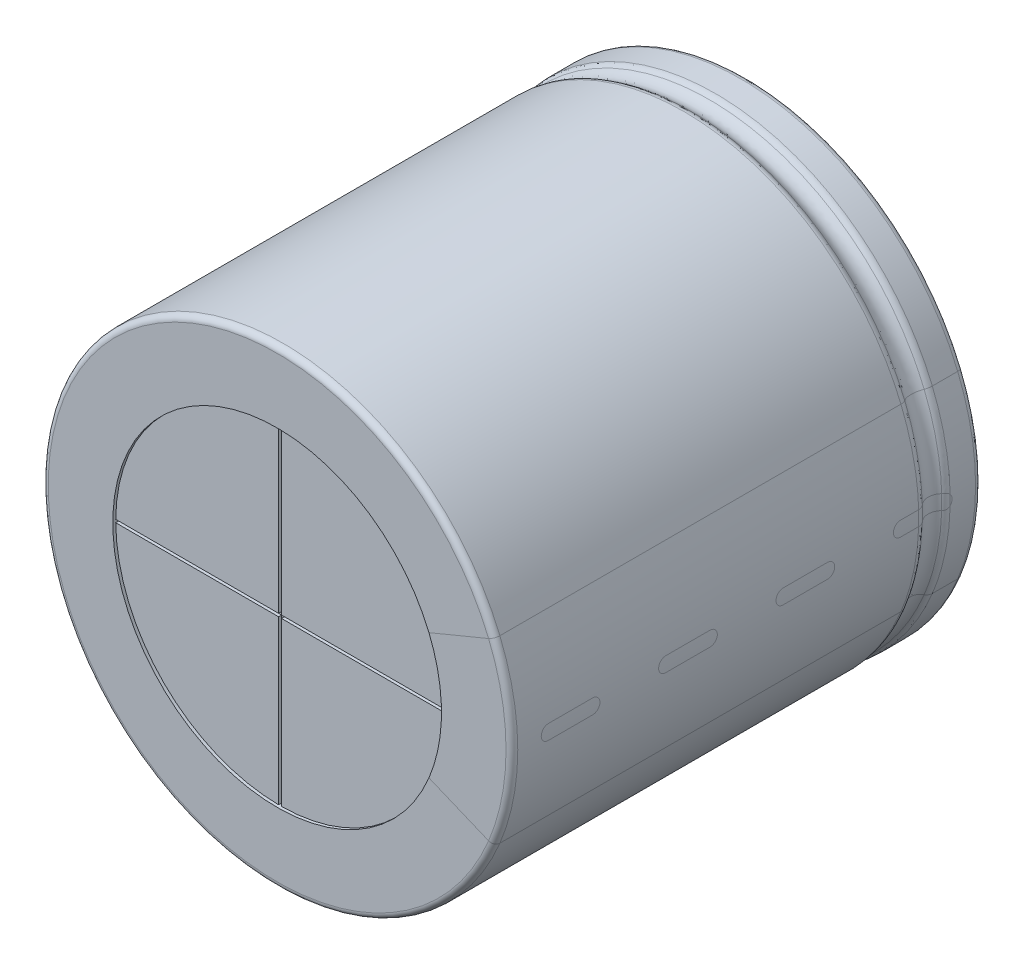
ISO-10303-21;
HEADER;
FILE_DESCRIPTION(('STEP AP214'),'2;1');
FILE_NAME('part.step','',(''),(''),'','','');
FILE_SCHEMA(('AUTOMOTIVE_DESIGN { 1 0 10303 214 1 1 1 1 }'));
ENDSEC;
DATA;
#1=APPLICATION_CONTEXT('core data for automotive mechanical design processes');
#2=APPLICATION_PROTOCOL_DEFINITION('international standard','automotive_design',2000,#1);
#3=PRODUCT_CONTEXT('',#1,'mechanical');
#4=PRODUCT('Part','Part','',(#3));
#5=PRODUCT_RELATED_PRODUCT_CATEGORY('part','',(#4));
#6=PRODUCT_DEFINITION_FORMATION('','',#4);
#7=PRODUCT_DEFINITION_CONTEXT('part definition',#1,'design');
#8=PRODUCT_DEFINITION('design','',#6,#7);
#9=PRODUCT_DEFINITION_SHAPE('','',#8);
#10=(LENGTH_UNIT() NAMED_UNIT(*) SI_UNIT(.MILLI.,.METRE.));
#11=(NAMED_UNIT(*) PLANE_ANGLE_UNIT() SI_UNIT($,.RADIAN.));
#12=(NAMED_UNIT(*) SI_UNIT($,.STERADIAN.) SOLID_ANGLE_UNIT());
#13=UNCERTAINTY_MEASURE_WITH_UNIT(LENGTH_MEASURE(1.E-05),#10,'distance_accuracy_value','');
#14=(GEOMETRIC_REPRESENTATION_CONTEXT(3) GLOBAL_UNCERTAINTY_ASSIGNED_CONTEXT((#13)) GLOBAL_UNIT_ASSIGNED_CONTEXT((#10,
#11,#12)) REPRESENTATION_CONTEXT('',''));
#15=CARTESIAN_POINT('',(0.,0.,0.));
#16=DIRECTION('',(0.,0.,1.));
#17=DIRECTION('',(1.,0.,0.));
#18=AXIS2_PLACEMENT_3D('',#15,#16,#17);
#19=CARTESIAN_POINT('',(3.8,-0.05,15.9));
#20=DIRECTION('',(0.,-1.,0.));
#21=DIRECTION('',(-1.,0.,0.));
#22=AXIS2_PLACEMENT_3D('',#19,#20,#21);
#23=PLANE('',#22);
#24=DIRECTION('',(0.,0.,-1.));
#25=VECTOR('',#24,1.);
#26=CARTESIAN_POINT('',(9.349776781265,-0.05,15.7));
#27=LINE('',#26,#25);
#28=CARTESIAN_POINT('',(9.349776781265,-0.05000000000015,15.9));
#29=VERTEX_POINT('',#28);
#30=CARTESIAN_POINT('',(9.349776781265,-0.05,15.8));
#31=VERTEX_POINT('',#30);
#32=EDGE_CURVE('E528',#29,#31,#27,.T.);
#33=ORIENTED_EDGE('',*,*,#32,.T.);
#34=DIRECTION('',(1.,0.,0.));
#35=VECTOR('',#34,1.);
#36=CARTESIAN_POINT('',(3.8,-0.05,15.8));
#37=LINE('',#36,#35);
#38=CARTESIAN_POINT('',(3.8,-0.05,15.8));
#39=VERTEX_POINT('',#38);
#40=EDGE_CURVE('E600',#39,#31,#37,.T.);
#41=ORIENTED_EDGE('',*,*,#40,.F.);
#42=DIRECTION('',(0.,0.,-1.));
#43=VECTOR('',#42,1.);
#44=CARTESIAN_POINT('',(3.8,-0.05,15.9));
#45=LINE('',#44,#43);
#46=CARTESIAN_POINT('',(3.8,-0.05,15.9));
#47=VERTEX_POINT('',#46);
#48=EDGE_CURVE('E981',#47,#39,#45,.T.);
#49=ORIENTED_EDGE('',*,*,#48,.F.);
#50=DIRECTION('',(1.,0.,0.));
#51=VECTOR('',#50,1.);
#52=CARTESIAN_POINT('',(3.8,-0.05,15.9));
#53=LINE('',#52,#51);
#54=EDGE_CURVE('E689',#47,#29,#53,.T.);
#55=ORIENTED_EDGE('',*,*,#54,.T.);
#56=EDGE_LOOP('',(#33,#41,#49,#55));
#57=FACE_BOUND('',#56,.T.);
#58=ADVANCED_FACE('F18',(#57),#23,.F.);
#59=CARTESIAN_POINT('',(19.8,0.05,15.9));
#60=DIRECTION('',(0.,1.,0.));
#61=DIRECTION('',(1.,0.,0.));
#62=AXIS2_PLACEMENT_3D('',#59,#60,#61);
#63=PLANE('',#62);
#64=DIRECTION('',(0.,0.,-1.));
#65=VECTOR('',#64,1.);
#66=CARTESIAN_POINT('',(3.8,0.05,15.9));
#67=LINE('',#66,#65);
#68=CARTESIAN_POINT('',(3.8,0.05,15.9));
#69=VERTEX_POINT('',#68);
#70=CARTESIAN_POINT('',(3.8,0.05,15.8));
#71=VERTEX_POINT('',#70);
#72=EDGE_CURVE('E1015',#69,#71,#67,.T.);
#73=ORIENTED_EDGE('',*,*,#72,.T.);
#74=DIRECTION('',(-1.,0.,0.));
#75=VECTOR('',#74,1.);
#76=CARTESIAN_POINT('',(19.8,0.05,15.8));
#77=LINE('',#76,#75);
#78=CARTESIAN_POINT('',(9.349776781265,0.05,15.8));
#79=VERTEX_POINT('',#78);
#80=EDGE_CURVE('E1001',#79,#71,#77,.T.);
#81=ORIENTED_EDGE('',*,*,#80,.F.);
#82=DIRECTION('',(0.,0.,-1.));
#83=VECTOR('',#82,1.);
#84=CARTESIAN_POINT('',(9.349776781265,0.05,15.7));
#85=LINE('',#84,#83);
#86=CARTESIAN_POINT('',(9.349776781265,0.05000000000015,15.9));
#87=VERTEX_POINT('',#86);
#88=EDGE_CURVE('E507',#87,#79,#85,.T.);
#89=ORIENTED_EDGE('',*,*,#88,.F.);
#90=DIRECTION('',(-1.,0.,0.));
#91=VECTOR('',#90,1.);
#92=CARTESIAN_POINT('',(19.8,0.05,15.9));
#93=LINE('',#92,#91);
#94=EDGE_CURVE('E992',#87,#69,#93,.T.);
#95=ORIENTED_EDGE('',*,*,#94,.T.);
#96=EDGE_LOOP('',(#73,#81,#89,#95));
#97=FACE_BOUND('',#96,.T.);
#98=ADVANCED_FACE('F1125',(#97),#63,.F.);
#99=CARTESIAN_POINT('',(3.7,0.05,15.9));
#100=DIRECTION('',(0.,1.,0.));
#101=DIRECTION('',(1.,0.,0.));
#102=AXIS2_PLACEMENT_3D('',#99,#100,#101);
#103=PLANE('',#102);
#104=DIRECTION('',(0.,0.,-1.));
#105=VECTOR('',#104,1.);
#106=CARTESIAN_POINT('',(-1.849776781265,0.05,15.7));
#107=LINE('',#106,#105);
#108=CARTESIAN_POINT('',(-1.849776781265,0.04999999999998,15.9));
#109=VERTEX_POINT('',#108);
#110=CARTESIAN_POINT('',(-1.849776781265,0.05,15.8));
#111=VERTEX_POINT('',#110);
#112=EDGE_CURVE('E435',#109,#111,#107,.T.);
#113=ORIENTED_EDGE('',*,*,#112,.T.);
#114=DIRECTION('',(-1.,0.,0.));
#115=VECTOR('',#114,1.);
#116=CARTESIAN_POINT('',(3.7,0.05,15.8));
#117=LINE('',#116,#115);
#118=CARTESIAN_POINT('',(3.7,0.05,15.8));
#119=VERTEX_POINT('',#118);
#120=EDGE_CURVE('E1012',#119,#111,#117,.T.);
#121=ORIENTED_EDGE('',*,*,#120,.F.);
#122=DIRECTION('',(0.,0.,-1.));
#123=VECTOR('',#122,1.);
#124=CARTESIAN_POINT('',(3.7,0.05,15.9));
#125=LINE('',#124,#123);
#126=CARTESIAN_POINT('',(3.7,0.05,15.9));
#127=VERTEX_POINT('',#126);
#128=EDGE_CURVE('E437',#127,#119,#125,.T.);
#129=ORIENTED_EDGE('',*,*,#128,.F.);
#130=DIRECTION('',(-1.,0.,0.));
#131=VECTOR('',#130,1.);
#132=CARTESIAN_POINT('',(3.7,0.05,15.9));
#133=LINE('',#132,#131);
#134=EDGE_CURVE('E430',#127,#109,#133,.T.);
#135=ORIENTED_EDGE('',*,*,#134,.T.);
#136=EDGE_LOOP('',(#113,#121,#129,#135));
#137=FACE_BOUND('',#136,.T.);
#138=ADVANCED_FACE('F432',(#137),#103,.F.);
#139=CARTESIAN_POINT('',(3.75,0.,15.9));
#140=DIRECTION('',(0.,0.,1.));
#141=DIRECTION('',(1.,0.,0.));
#142=AXIS2_PLACEMENT_3D('',#139,#140,#141);
#143=PLANE('',#142);
#144=CARTESIAN_POINT('',(3.75,0.,15.9));
#145=DIRECTION('',(0.,0.,1.));
#146=DIRECTION('',(-1.,0.,0.));
#147=AXIS2_PLACEMENT_3D('',#144,#145,#146);
#148=CIRCLE('',#147,5.6);
#149=CARTESIAN_POINT('',(3.7,5.599776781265,15.9));
#150=VERTEX_POINT('',#149);
#151=EDGE_CURVE('E445',#150,#109,#148,.T.);
#152=ORIENTED_EDGE('',*,*,#151,.T.);
#153=ORIENTED_EDGE('',*,*,#134,.F.);
#154=DIRECTION('',(0.,-1.,0.));
#155=VECTOR('',#154,1.);
#156=CARTESIAN_POINT('',(3.7,16.05,15.9));
#157=LINE('',#156,#155);
#158=EDGE_CURVE('E442',#150,#127,#157,.T.);
#159=ORIENTED_EDGE('',*,*,#158,.F.);
#160=EDGE_LOOP('',(#152,#153,#159));
#161=FACE_BOUND('',#160,.T.);
#162=ADVANCED_FACE('F446',(#161),#143,.T.);
#163=CARTESIAN_POINT('',(-12.3,-0.05,15.9));
#164=DIRECTION('',(0.,-1.,0.));
#165=DIRECTION('',(-1.,0.,0.));
#166=AXIS2_PLACEMENT_3D('',#163,#164,#165);
#167=PLANE('',#166);
#168=DIRECTION('',(0.,0.,-1.));
#169=VECTOR('',#168,1.);
#170=CARTESIAN_POINT('',(3.7,-0.05,15.9));
#171=LINE('',#170,#169);
#172=CARTESIAN_POINT('',(3.7,-0.05,15.9));
#173=VERTEX_POINT('',#172);
#174=CARTESIAN_POINT('',(3.7,-0.05,15.8));
#175=VERTEX_POINT('',#174);
#176=EDGE_CURVE('E1018',#173,#175,#171,.T.);
#177=ORIENTED_EDGE('',*,*,#176,.T.);
#178=DIRECTION('',(1.,0.,0.));
#179=VECTOR('',#178,1.);
#180=CARTESIAN_POINT('',(-12.3,-0.05,15.8));
#181=LINE('',#180,#179);
#182=CARTESIAN_POINT('',(-1.849776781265,-0.05,15.8));
#183=VERTEX_POINT('',#182);
#184=EDGE_CURVE('E601',#183,#175,#181,.T.);
#185=ORIENTED_EDGE('',*,*,#184,.F.);
#186=DIRECTION('',(0.,0.,-1.));
#187=VECTOR('',#186,1.);
#188=CARTESIAN_POINT('',(-1.849776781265,-0.05,15.7));
#189=LINE('',#188,#187);
#190=CARTESIAN_POINT('',(-1.849776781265,-0.04999999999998,15.9));
#191=VERTEX_POINT('',#190);
#192=EDGE_CURVE('E942',#191,#183,#189,.T.);
#193=ORIENTED_EDGE('',*,*,#192,.F.);
#194=DIRECTION('',(1.,0.,0.));
#195=VECTOR('',#194,1.);
#196=CARTESIAN_POINT('',(-12.3,-0.05,15.9));
#197=LINE('',#196,#195);
#198=EDGE_CURVE('E1024',#191,#173,#197,.T.);
#199=ORIENTED_EDGE('',*,*,#198,.T.);
#200=EDGE_LOOP('',(#177,#185,#193,#199));
#201=FACE_BOUND('',#200,.T.);
#202=ADVANCED_FACE('F1139',(#201),#167,.F.);
#203=CARTESIAN_POINT('',(3.7,16.05,15.9));
#204=DIRECTION('',(-1.,0.,0.));
#205=DIRECTION('',(0.,0.,1.));
#206=AXIS2_PLACEMENT_3D('',#203,#204,#205);
#207=PLANE('',#206);
#208=ORIENTED_EDGE('',*,*,#128,.T.);
#209=DIRECTION('',(0.,-1.,0.));
#210=VECTOR('',#209,1.);
#211=CARTESIAN_POINT('',(3.7,16.05,15.8));
#212=LINE('',#211,#210);
#213=CARTESIAN_POINT('',(3.7,5.599776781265,15.8));
#214=VERTEX_POINT('',#213);
#215=EDGE_CURVE('E1008',#214,#119,#212,.T.);
#216=ORIENTED_EDGE('',*,*,#215,.F.);
#217=DIRECTION('',(0.,0.,-1.));
#218=VECTOR('',#217,1.);
#219=CARTESIAN_POINT('',(3.7,5.599776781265,15.7));
#220=LINE('',#219,#218);
#221=EDGE_CURVE('E451',#150,#214,#220,.T.);
#222=ORIENTED_EDGE('',*,*,#221,.F.);
#223=ORIENTED_EDGE('',*,*,#158,.T.);
#224=EDGE_LOOP('',(#208,#216,#222,#223));
#225=FACE_BOUND('',#224,.T.);
#226=ADVANCED_FACE('F1142',(#225),#207,.F.);
#227=CARTESIAN_POINT('',(3.75,0.,15.9));
#228=DIRECTION('',(0.,0.,1.));
#229=DIRECTION('',(1.,0.,0.));
#230=AXIS2_PLACEMENT_3D('',#227,#228,#229);
#231=PLANE('',#230);
#232=ORIENTED_EDGE('',*,*,#198,.F.);
#233=CARTESIAN_POINT('',(3.75,0.,15.9));
#234=DIRECTION('',(0.,0.,1.));
#235=DIRECTION('',(-1.,0.,0.));
#236=AXIS2_PLACEMENT_3D('',#233,#234,#235);
#237=CIRCLE('',#236,5.6);
#238=CARTESIAN_POINT('',(3.7,-5.599776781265,15.9));
#239=VERTEX_POINT('',#238);
#240=EDGE_CURVE('E946',#191,#239,#237,.T.);
#241=ORIENTED_EDGE('',*,*,#240,.T.);
#242=DIRECTION('',(0.,-1.,0.));
#243=VECTOR('',#242,1.);
#244=CARTESIAN_POINT('',(3.7,-0.05,15.9));
#245=LINE('',#244,#243);
#246=EDGE_CURVE('E1021',#173,#239,#245,.T.);
#247=ORIENTED_EDGE('',*,*,#246,.F.);
#248=EDGE_LOOP('',(#232,#241,#247));
#249=FACE_BOUND('',#248,.T.);
#250=ADVANCED_FACE('F1144',(#249),#231,.T.);
#251=CARTESIAN_POINT('',(3.7,-0.05,15.9));
#252=DIRECTION('',(-1.,0.,0.));
#253=DIRECTION('',(0.,0.,1.));
#254=AXIS2_PLACEMENT_3D('',#251,#252,#253);
#255=PLANE('',#254);
#256=DIRECTION('',(0.,0.,-1.));
#257=VECTOR('',#256,1.);
#258=CARTESIAN_POINT('',(3.7,-5.599776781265,15.7));
#259=LINE('',#258,#257);
#260=CARTESIAN_POINT('',(3.7,-5.599776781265,15.8));
#261=VERTEX_POINT('',#260);
#262=EDGE_CURVE('E954',#239,#261,#259,.T.);
#263=ORIENTED_EDGE('',*,*,#262,.T.);
#264=DIRECTION('',(0.,-1.,0.));
#265=VECTOR('',#264,1.);
#266=CARTESIAN_POINT('',(3.7,-0.05,15.8));
#267=LINE('',#266,#265);
#268=EDGE_CURVE('E594',#175,#261,#267,.T.);
#269=ORIENTED_EDGE('',*,*,#268,.F.);
#270=ORIENTED_EDGE('',*,*,#176,.F.);
#271=ORIENTED_EDGE('',*,*,#246,.T.);
#272=EDGE_LOOP('',(#263,#269,#270,#271));
#273=FACE_BOUND('',#272,.T.);
#274=ADVANCED_FACE('F1147',(#273),#255,.F.);
#275=CARTESIAN_POINT('',(3.8,0.05,15.9));
#276=DIRECTION('',(1.,0.,0.));
#277=DIRECTION('',(0.,-1.,0.));
#278=AXIS2_PLACEMENT_3D('',#275,#276,#277);
#279=PLANE('',#278);
#280=DIRECTION('',(0.,0.,-1.));
#281=VECTOR('',#280,1.);
#282=CARTESIAN_POINT('',(3.8,5.599776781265,15.7));
#283=LINE('',#282,#281);
#284=CARTESIAN_POINT('',(3.8,5.599776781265,15.9));
#285=VERTEX_POINT('',#284);
#286=CARTESIAN_POINT('',(3.8,5.599776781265,15.8));
#287=VERTEX_POINT('',#286);
#288=EDGE_CURVE('E551',#285,#287,#283,.T.);
#289=ORIENTED_EDGE('',*,*,#288,.T.);
#290=DIRECTION('',(0.,1.,0.));
#291=VECTOR('',#290,1.);
#292=CARTESIAN_POINT('',(3.8,0.05,15.8));
#293=LINE('',#292,#291);
#294=EDGE_CURVE('E1005',#71,#287,#293,.T.);
#295=ORIENTED_EDGE('',*,*,#294,.F.);
#296=ORIENTED_EDGE('',*,*,#72,.F.);
#297=DIRECTION('',(0.,1.,0.));
#298=VECTOR('',#297,1.);
#299=CARTESIAN_POINT('',(3.8,0.05,15.9));
#300=LINE('',#299,#298);
#301=EDGE_CURVE('E989',#69,#285,#300,.T.);
#302=ORIENTED_EDGE('',*,*,#301,.T.);
#303=EDGE_LOOP('',(#289,#295,#296,#302));
#304=FACE_BOUND('',#303,.T.);
#305=ADVANCED_FACE('F1149',(#304),#279,.F.);
#306=CARTESIAN_POINT('',(3.75,0.,15.8));
#307=DIRECTION('',(0.,0.,1.));
#308=DIRECTION('',(1.,0.,0.));
#309=AXIS2_PLACEMENT_3D('',#306,#307,#308);
#310=PLANE('',#309);
#311=ORIENTED_EDGE('',*,*,#184,.T.);
#312=ORIENTED_EDGE('',*,*,#268,.T.);
#313=CARTESIAN_POINT('',(3.75,0.,15.8));
#314=DIRECTION('',(0.,0.,-1.));
#315=DIRECTION('',(-1.,0.,0.));
#316=AXIS2_PLACEMENT_3D('',#313,#314,#315);
#317=CIRCLE('',#316,5.6);
#318=CARTESIAN_POINT('',(3.8,-5.599776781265,15.8));
#319=VERTEX_POINT('',#318);
#320=EDGE_CURVE('E555',#319,#261,#317,.T.);
#321=ORIENTED_EDGE('',*,*,#320,.F.);
#322=DIRECTION('',(0.,1.,0.));
#323=VECTOR('',#322,1.);
#324=CARTESIAN_POINT('',(3.8,-16.05,15.8));
#325=LINE('',#324,#323);
#326=EDGE_CURVE('E985',#319,#39,#325,.T.);
#327=ORIENTED_EDGE('',*,*,#326,.T.);
#328=ORIENTED_EDGE('',*,*,#40,.T.);
#329=CARTESIAN_POINT('',(3.75,0.,15.8));
#330=DIRECTION('',(0.,0.,-1.));
#331=DIRECTION('',(-1.,0.,0.));
#332=AXIS2_PLACEMENT_3D('',#329,#330,#331);
#333=CIRCLE('',#332,5.6);
#334=EDGE_CURVE('E533',#79,#31,#333,.T.);
#335=ORIENTED_EDGE('',*,*,#334,.F.);
#336=ORIENTED_EDGE('',*,*,#80,.T.);
#337=ORIENTED_EDGE('',*,*,#294,.T.);
#338=CARTESIAN_POINT('',(3.75,0.,15.8));
#339=DIRECTION('',(0.,0.,-1.));
#340=DIRECTION('',(-1.,0.,0.));
#341=AXIS2_PLACEMENT_3D('',#338,#339,#340);
#342=CIRCLE('',#341,5.6);
#343=EDGE_CURVE('E743',#214,#287,#342,.T.);
#344=ORIENTED_EDGE('',*,*,#343,.F.);
#345=ORIENTED_EDGE('',*,*,#215,.T.);
#346=ORIENTED_EDGE('',*,*,#120,.T.);
#347=CARTESIAN_POINT('',(3.75,0.,15.8));
#348=DIRECTION('',(0.,0.,-1.));
#349=DIRECTION('',(-1.,0.,0.));
#350=AXIS2_PLACEMENT_3D('',#347,#348,#349);
#351=CIRCLE('',#350,5.6);
#352=CARTESIAN_POINT('',(-1.85,0.,15.8));
#353=VERTEX_POINT('',#352);
#354=EDGE_CURVE('E456',#353,#111,#351,.T.);
#355=ORIENTED_EDGE('',*,*,#354,.F.);
#356=CARTESIAN_POINT('',(3.75,0.,15.8));
#357=DIRECTION('',(0.,0.,-1.));
#358=DIRECTION('',(-1.,0.,0.));
#359=AXIS2_PLACEMENT_3D('',#356,#357,#358);
#360=CIRCLE('',#359,5.6);
#361=EDGE_CURVE('E463',#183,#353,#360,.T.);
#362=ORIENTED_EDGE('',*,*,#361,.F.);
#363=EDGE_LOOP('',(#311,#312,#321,#327,#328,#335,#336,#337,#344,#345,#346,#355,#362));
#364=FACE_BOUND('',#363,.T.);
#365=ADVANCED_FACE('F1152',(#364),#310,.T.);
#366=CARTESIAN_POINT('',(3.75,0.,15.9));
#367=DIRECTION('',(0.,0.,1.));
#368=DIRECTION('',(1.,0.,0.));
#369=AXIS2_PLACEMENT_3D('',#366,#367,#368);
#370=PLANE('',#369);
#371=CARTESIAN_POINT('',(3.75,0.,15.9));
#372=DIRECTION('',(0.,0.,1.));
#373=DIRECTION('',(-1.,0.,0.));
#374=AXIS2_PLACEMENT_3D('',#371,#372,#373);
#375=CIRCLE('',#374,5.6);
#376=CARTESIAN_POINT('',(8.923725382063,2.143027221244,15.9));
#377=VERTEX_POINT('',#376);
#378=EDGE_CURVE('E504',#87,#377,#375,.T.);
#379=ORIENTED_EDGE('',*,*,#378,.T.);
#380=CARTESIAN_POINT('',(3.75,0.,15.9));
#381=DIRECTION('',(0.,0.,1.));
#382=DIRECTION('',(-1.,0.,0.));
#383=AXIS2_PLACEMENT_3D('',#380,#381,#382);
#384=CIRCLE('',#383,5.6);
#385=EDGE_CURVE('E546',#377,#285,#384,.T.);
#386=ORIENTED_EDGE('',*,*,#385,.T.);
#387=ORIENTED_EDGE('',*,*,#301,.F.);
#388=ORIENTED_EDGE('',*,*,#94,.F.);
#389=EDGE_LOOP('',(#379,#386,#387,#388));
#390=FACE_BOUND('',#389,.T.);
#391=ADVANCED_FACE('F1156',(#390),#370,.T.);
#392=CARTESIAN_POINT('',(3.8,-16.05,15.9));
#393=DIRECTION('',(1.,0.,0.));
#394=DIRECTION('',(0.,-1.,0.));
#395=AXIS2_PLACEMENT_3D('',#392,#393,#394);
#396=PLANE('',#395);
#397=ORIENTED_EDGE('',*,*,#48,.T.);
#398=ORIENTED_EDGE('',*,*,#326,.F.);
#399=DIRECTION('',(0.,0.,-1.));
#400=VECTOR('',#399,1.);
#401=CARTESIAN_POINT('',(3.8,-5.599776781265,15.7));
#402=LINE('',#401,#400);
#403=CARTESIAN_POINT('',(3.8,-5.599776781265,15.9));
#404=VERTEX_POINT('',#403);
#405=EDGE_CURVE('E493',#404,#319,#402,.T.);
#406=ORIENTED_EDGE('',*,*,#405,.F.);
#407=DIRECTION('',(0.,1.,0.));
#408=VECTOR('',#407,1.);
#409=CARTESIAN_POINT('',(3.8,-16.05,15.9));
#410=LINE('',#409,#408);
#411=EDGE_CURVE('E685',#404,#47,#410,.T.);
#412=ORIENTED_EDGE('',*,*,#411,.T.);
#413=EDGE_LOOP('',(#397,#398,#406,#412));
#414=FACE_BOUND('',#413,.T.);
#415=ADVANCED_FACE('F1160',(#414),#396,.F.);
#416=CARTESIAN_POINT('',(3.75,0.,15.9));
#417=DIRECTION('',(0.,0.,1.));
#418=DIRECTION('',(1.,0.,0.));
#419=AXIS2_PLACEMENT_3D('',#416,#417,#418);
#420=PLANE('',#419);
#421=ORIENTED_EDGE('',*,*,#411,.F.);
#422=CARTESIAN_POINT('',(3.75,0.,15.9));
#423=DIRECTION('',(0.,0.,1.));
#424=DIRECTION('',(-1.,0.,0.));
#425=AXIS2_PLACEMENT_3D('',#422,#423,#424);
#426=CIRCLE('',#425,5.6);
#427=CARTESIAN_POINT('',(8.923725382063,-2.143027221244,15.9));
#428=VERTEX_POINT('',#427);
#429=EDGE_CURVE('E489',#404,#428,#426,.T.);
#430=ORIENTED_EDGE('',*,*,#429,.T.);
#431=CARTESIAN_POINT('',(3.75,0.,15.9));
#432=DIRECTION('',(0.,0.,1.));
#433=DIRECTION('',(-1.,0.,0.));
#434=AXIS2_PLACEMENT_3D('',#431,#432,#433);
#435=CIRCLE('',#434,5.6);
#436=EDGE_CURVE('E532',#428,#29,#435,.T.);
#437=ORIENTED_EDGE('',*,*,#436,.T.);
#438=ORIENTED_EDGE('',*,*,#54,.F.);
#439=EDGE_LOOP('',(#421,#430,#437,#438));
#440=FACE_BOUND('',#439,.T.);
#441=ADVANCED_FACE('F1164',(#440),#420,.T.);
#442=CARTESIAN_POINT('',(3.75,0.,16.));
#443=DIRECTION('',(0.,0.,-1.));
#444=DIRECTION('',(0.923879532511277,0.382683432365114,0.));
#445=AXIS2_PLACEMENT_3D('',#442,#443,#444);
#446=CYLINDRICAL_SURFACE('',#445,5.6);
#447=ORIENTED_EDGE('',*,*,#378,.F.);
#448=ORIENTED_EDGE('',*,*,#88,.T.);
#449=ORIENTED_EDGE('',*,*,#334,.T.);
#450=ORIENTED_EDGE('',*,*,#32,.F.);
#451=ORIENTED_EDGE('',*,*,#436,.F.);
#452=DIRECTION('',(0.,0.,-1.));
#453=VECTOR('',#452,1.);
#454=CARTESIAN_POINT('',(8.923725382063,-2.143027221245,16.));
#455=LINE('',#454,#453);
#456=CARTESIAN_POINT('',(8.923725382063,-2.143027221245,16.));
#457=VERTEX_POINT('',#456);
#458=EDGE_CURVE('E508',#457,#428,#455,.T.);
#459=ORIENTED_EDGE('',*,*,#458,.F.);
#460=CARTESIAN_POINT('',(3.75,0.,16.));
#461=DIRECTION('',(0.,0.,-1.));
#462=DIRECTION('',(0.923879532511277,0.382683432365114,0.));
#463=AXIS2_PLACEMENT_3D('',#460,#461,#462);
#464=CIRCLE('',#463,5.6);
#465=CARTESIAN_POINT('',(8.923725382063,2.143027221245,16.));
#466=VERTEX_POINT('',#465);
#467=EDGE_CURVE('E494',#466,#457,#464,.T.);
#468=ORIENTED_EDGE('',*,*,#467,.F.);
#469=DIRECTION('',(0.,0.,-1.));
#470=VECTOR('',#469,1.);
#471=CARTESIAN_POINT('',(8.923725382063,2.143027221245,16.));
#472=LINE('',#471,#470);
#473=EDGE_CURVE('E550',#466,#377,#472,.T.);
#474=ORIENTED_EDGE('',*,*,#473,.T.);
#475=EDGE_LOOP('',(#447,#448,#449,#450,#451,#459,#468,#474));
#476=FACE_BOUND('',#475,.T.);
#477=ADVANCED_FACE('F1168',(#476),#446,.F.);
#478=CARTESIAN_POINT('',(3.75,0.,16.));
#479=DIRECTION('',(0.,0.,-1.));
#480=DIRECTION('',(0.923879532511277,-0.382683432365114,0.));
#481=AXIS2_PLACEMENT_3D('',#478,#479,#480);
#482=CYLINDRICAL_SURFACE('',#481,5.6);
#483=ORIENTED_EDGE('',*,*,#429,.F.);
#484=ORIENTED_EDGE('',*,*,#405,.T.);
#485=ORIENTED_EDGE('',*,*,#320,.T.);
#486=ORIENTED_EDGE('',*,*,#262,.F.);
#487=ORIENTED_EDGE('',*,*,#240,.F.);
#488=ORIENTED_EDGE('',*,*,#192,.T.);
#489=ORIENTED_EDGE('',*,*,#361,.T.);
#490=ORIENTED_EDGE('',*,*,#354,.T.);
#491=ORIENTED_EDGE('',*,*,#112,.F.);
#492=ORIENTED_EDGE('',*,*,#151,.F.);
#493=ORIENTED_EDGE('',*,*,#221,.T.);
#494=ORIENTED_EDGE('',*,*,#343,.T.);
#495=ORIENTED_EDGE('',*,*,#288,.F.);
#496=ORIENTED_EDGE('',*,*,#385,.F.);
#497=ORIENTED_EDGE('',*,*,#473,.F.);
#498=CARTESIAN_POINT('',(3.75,0.,16.));
#499=DIRECTION('',(0.,0.,-1.));
#500=DIRECTION('',(0.923879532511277,-0.382683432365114,0.));
#501=AXIS2_PLACEMENT_3D('',#498,#499,#500);
#502=CIRCLE('',#501,5.6);
#503=EDGE_CURVE('E769',#457,#466,#502,.T.);
#504=ORIENTED_EDGE('',*,*,#503,.F.);
#505=ORIENTED_EDGE('',*,*,#458,.T.);
#506=EDGE_LOOP('',(#483,#484,#485,#486,#487,#488,#489,#490,#491,#492,#493,#494,#495,#496,#497,
#504,#505));
#507=FACE_BOUND('',#506,.T.);
#508=ADVANCED_FACE('F454',(#507),#482,.F.);
#509=CARTESIAN_POINT('',(3.75,0.,16.));
#510=DIRECTION('',(0.,0.,-1.));
#511=DIRECTION('',(0.,-1.,0.));
#512=AXIS2_PLACEMENT_3D('',#509,#510,#511);
#513=PLANE('',#512);
#514=DIRECTION('',(-0.923879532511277,-0.382683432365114,0.));
#515=VECTOR('',#514,1.);
#516=CARTESIAN_POINT('',(10.956260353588,2.984930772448,16.));
#517=LINE('',#516,#515);
#518=CARTESIAN_POINT('',(10.956260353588,2.984930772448,16.));
#519=VERTEX_POINT('',#518);
#520=EDGE_CURVE('E765',#519,#466,#517,.T.);
#521=ORIENTED_EDGE('',*,*,#520,.T.);
#522=ORIENTED_EDGE('',*,*,#467,.T.);
#523=DIRECTION('',(-0.923879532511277,0.382683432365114,0.));
#524=VECTOR('',#523,1.);
#525=CARTESIAN_POINT('',(10.956260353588,-2.984930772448,16.));
#526=LINE('',#525,#524);
#527=CARTESIAN_POINT('',(10.956260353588,-2.984930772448,16.));
#528=VERTEX_POINT('',#527);
#529=EDGE_CURVE('E950',#528,#457,#526,.T.);
#530=ORIENTED_EDGE('',*,*,#529,.F.);
#531=CARTESIAN_POINT('',(3.75,0.,16.));
#532=DIRECTION('',(0.,0.,-1.));
#533=DIRECTION('',(0.923879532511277,0.382683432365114,0.));
#534=AXIS2_PLACEMENT_3D('',#531,#532,#533);
#535=CIRCLE('',#534,7.8);
#536=EDGE_CURVE('E940',#519,#528,#535,.T.);
#537=ORIENTED_EDGE('',*,*,#536,.F.);
#538=EDGE_LOOP('',(#521,#522,#530,#537));
#539=FACE_BOUND('',#538,.T.);
#540=ADVANCED_FACE('F1172',(#539),#513,.F.);
#541=CARTESIAN_POINT('',(3.75,0.,16.));
#542=DIRECTION('',(0.,0.,-1.));
#543=DIRECTION('',(0.,-1.,0.));
#544=AXIS2_PLACEMENT_3D('',#541,#542,#543);
#545=PLANE('',#544);
#546=ORIENTED_EDGE('',*,*,#529,.T.);
#547=ORIENTED_EDGE('',*,*,#503,.T.);
#548=ORIENTED_EDGE('',*,*,#520,.F.);
#549=CARTESIAN_POINT('',(3.75,0.,16.));
#550=DIRECTION('',(0.,0.,-1.));
#551=DIRECTION('',(0.923879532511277,-0.382683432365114,0.));
#552=AXIS2_PLACEMENT_3D('',#549,#550,#551);
#553=CIRCLE('',#552,7.8);
#554=EDGE_CURVE('E933',#528,#519,#553,.T.);
#555=ORIENTED_EDGE('',*,*,#554,.F.);
#556=EDGE_LOOP('',(#546,#547,#548,#555));
#557=FACE_BOUND('',#556,.T.);
#558=ADVANCED_FACE('F1178',(#557),#545,.F.);
#559=CARTESIAN_POINT('',(3.75,0.,2.));
#560=DIRECTION('',(0.,0.,1.));
#561=DIRECTION('',(0.923879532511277,0.382683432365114,0.));
#562=AXIS2_PLACEMENT_3D('',#559,#560,#561);
#563=CYLINDRICAL_SURFACE('',#562,8.);
#564=CARTESIAN_POINT('',(11.74609279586,0.25,6.751));
#565=CARTESIAN_POINT('',(11.746092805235,0.249999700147,6.751386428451));
#566=(BOUNDED_CURVE() B_SPLINE_CURVE(1,(#564,#565),.UNSPECIFIED.,.F.,
.F.) B_SPLINE_CURVE_WITH_KNOTS((2,2),(0.,1.),
.UNSPECIFIED.) CURVE() GEOMETRIC_REPRESENTATION_ITEM() RATIONAL_B_SPLINE_CURVE((1.,1.)) REPRESENTATION_ITEM(''));
#567=CARTESIAN_POINT('',(11.74609279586,0.25,6.751));
#568=VERTEX_POINT('',#567);
#569=CARTESIAN_POINT('',(11.746092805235,0.249999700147,6.751386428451));
#570=VERTEX_POINT('',#569);
#571=EDGE_CURVE('E690',#568,#570,#566,.T.);
#572=ORIENTED_EDGE('',*,*,#571,.T.);
#573=CARTESIAN_POINT('',(11.746092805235,0.249999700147,6.751386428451));
#574=CARTESIAN_POINT('',(11.746095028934,0.249928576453,6.79721581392));
#575=CARTESIAN_POINT('',(11.746398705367,0.240217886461,6.843211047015));
#576=CARTESIAN_POINT('',(11.747007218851,0.220731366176,6.887399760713));
#577=CARTESIAN_POINT('',(11.747853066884,0.191595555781,6.927556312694));
#578=CARTESIAN_POINT('',(11.748776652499,0.153442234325,6.96129885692));
#579=CARTESIAN_POINT('',(11.749557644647,0.107587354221,6.986220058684));
#580=CARTESIAN_POINT('',(11.749993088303,0.055793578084,7.));
#581=CARTESIAN_POINT('',(11.7499999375,0.001000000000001,7.));
#582=(BOUNDED_CURVE() B_SPLINE_CURVE(8,(#573,#574,#575,#576,#577,#578,#579,#580,#581),
.UNSPECIFIED.,.F.,.F.) B_SPLINE_CURVE_WITH_KNOTS((9,9),(0.,1.),
.UNSPECIFIED.) CURVE() GEOMETRIC_REPRESENTATION_ITEM() RATIONAL_B_SPLINE_CURVE((1.,1.,1.,1.,1.,
1.,1.,1.,1.)) REPRESENTATION_ITEM(''));
#583=CARTESIAN_POINT('',(11.7499999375,0.0009999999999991,7.));
#584=VERTEX_POINT('',#583);
#585=EDGE_CURVE('E695',#570,#584,#582,.T.);
#586=ORIENTED_EDGE('',*,*,#585,.T.);
#587=CARTESIAN_POINT('',(3.75,0.,7.));
#588=DIRECTION('',(0.,0.,1.));
#589=DIRECTION('',(0.923879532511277,0.382683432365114,0.));
#590=AXIS2_PLACEMENT_3D('',#587,#588,#589);
#591=CIRCLE('',#590,8.);
#592=CARTESIAN_POINT('',(11.7499999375,-0.001000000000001,7.));
#593=VERTEX_POINT('',#592);
#594=EDGE_CURVE('E914',#593,#584,#591,.T.);
#595=ORIENTED_EDGE('',*,*,#594,.F.);
#596=CARTESIAN_POINT('',(11.7499999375,-0.001000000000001,7.));
#597=CARTESIAN_POINT('',(11.749993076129,-0.05589096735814,7.));
#598=CARTESIAN_POINT('',(11.749556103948,-0.107730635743,6.986170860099));
#599=CARTESIAN_POINT('',(11.748773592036,-0.153582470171,6.961202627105));
#600=CARTESIAN_POINT('',(11.747850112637,-0.191729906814,6.927426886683));
#601=CARTESIAN_POINT('',(11.747003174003,-0.220873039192,6.887222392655));
#602=CARTESIAN_POINT('',(11.746394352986,-0.240356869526,6.84293682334));
#603=CARTESIAN_POINT('',(11.74609279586,-0.25,6.796838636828));
#604=CARTESIAN_POINT('',(11.74609279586,-0.25,6.751));
#605=(BOUNDED_CURVE() B_SPLINE_CURVE(8,(#596,#597,#598,#599,#600,#601,#602,#603,#604),
.UNSPECIFIED.,.F.,.F.) B_SPLINE_CURVE_WITH_KNOTS((9,9),(0.,1.),
.UNSPECIFIED.) CURVE() GEOMETRIC_REPRESENTATION_ITEM() RATIONAL_B_SPLINE_CURVE((1.,1.,1.,1.,1.,
1.,1.,1.,1.)) REPRESENTATION_ITEM(''));
#606=CARTESIAN_POINT('',(11.74609279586,-0.25,6.751));
#607=VERTEX_POINT('',#606);
#608=EDGE_CURVE('E909',#593,#607,#605,.T.);
#609=ORIENTED_EDGE('',*,*,#608,.T.);
#610=DIRECTION('',(0.,0.,1.));
#611=VECTOR('',#610,1.);
#612=CARTESIAN_POINT('',(11.74609279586,-0.25,2.));
#613=LINE('',#612,#611);
#614=CARTESIAN_POINT('',(11.74609279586,-0.25,5.249));
#615=VERTEX_POINT('',#614);
#616=EDGE_CURVE('E705',#615,#607,#613,.T.);
#617=ORIENTED_EDGE('',*,*,#616,.F.);
#618=CARTESIAN_POINT('',(11.7499999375,-0.001000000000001,5.));
#619=CARTESIAN_POINT('',(11.749993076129,-0.05589096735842,5.));
#620=CARTESIAN_POINT('',(11.749556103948,-0.107730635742,5.013829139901));
#621=CARTESIAN_POINT('',(11.748773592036,-0.153582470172,5.038797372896));
#622=CARTESIAN_POINT('',(11.747850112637,-0.191729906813,5.072573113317));
#623=CARTESIAN_POINT('',(11.747003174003,-0.220873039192,5.112777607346));
#624=CARTESIAN_POINT('',(11.746394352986,-0.240356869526,5.157063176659));
#625=CARTESIAN_POINT('',(11.74609279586,-0.25,5.203161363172));
#626=CARTESIAN_POINT('',(11.74609279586,-0.25,5.249));
#627=(BOUNDED_CURVE() B_SPLINE_CURVE(8,(#618,#619,#620,#621,#622,#623,#624,#625,#626),
.UNSPECIFIED.,.F.,.F.) B_SPLINE_CURVE_WITH_KNOTS((9,9),(0.,1.),
.UNSPECIFIED.) CURVE() GEOMETRIC_REPRESENTATION_ITEM() RATIONAL_B_SPLINE_CURVE((1.,1.,1.,1.,1.,
1.,1.,1.,1.)) REPRESENTATION_ITEM(''));
#628=CARTESIAN_POINT('',(11.7499999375,-0.001000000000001,5.));
#629=VERTEX_POINT('',#628);
#630=EDGE_CURVE('E696',#629,#615,#627,.T.);
#631=ORIENTED_EDGE('',*,*,#630,.F.);
#632=CARTESIAN_POINT('',(3.75,0.,5.));
#633=DIRECTION('',(0.,0.,1.));
#634=DIRECTION('',(0.923879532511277,0.382683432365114,0.));
#635=AXIS2_PLACEMENT_3D('',#632,#633,#634);
#636=CIRCLE('',#635,8.);
#637=CARTESIAN_POINT('',(11.7499999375,0.0009999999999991,5.));
#638=VERTEX_POINT('',#637);
#639=EDGE_CURVE('E706',#629,#638,#636,.T.);
#640=ORIENTED_EDGE('',*,*,#639,.T.);
#641=CARTESIAN_POINT('',(11.746092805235,0.249999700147,5.248613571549));
#642=CARTESIAN_POINT('',(11.746095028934,0.249928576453,5.202784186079));
#643=CARTESIAN_POINT('',(11.746398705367,0.240217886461,5.156788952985));
#644=CARTESIAN_POINT('',(11.747007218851,0.220731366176,5.112600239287));
#645=CARTESIAN_POINT('',(11.747853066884,0.191595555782,5.072443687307));
#646=CARTESIAN_POINT('',(11.748776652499,0.153442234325,5.03870114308));
#647=CARTESIAN_POINT('',(11.749557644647,0.107587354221,5.013779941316));
#648=CARTESIAN_POINT('',(11.749993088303,0.05579357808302,5.));
#649=CARTESIAN_POINT('',(11.7499999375,0.001000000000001,5.));
#650=(BOUNDED_CURVE() B_SPLINE_CURVE(8,(#641,#642,#643,#644,#645,#646,#647,#648,#649),
.UNSPECIFIED.,.F.,.F.) B_SPLINE_CURVE_WITH_KNOTS((9,9),(0.,1.),
.UNSPECIFIED.) CURVE() GEOMETRIC_REPRESENTATION_ITEM() RATIONAL_B_SPLINE_CURVE((1.,1.,1.,1.,1.,
1.,1.,1.,1.)) REPRESENTATION_ITEM(''));
#651=CARTESIAN_POINT('',(11.746092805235,0.249999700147,5.248613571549));
#652=VERTEX_POINT('',#651);
#653=EDGE_CURVE('E892',#652,#638,#650,.T.);
#654=ORIENTED_EDGE('',*,*,#653,.F.);
#655=CARTESIAN_POINT('',(11.74609279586,0.25,5.249));
#656=CARTESIAN_POINT('',(11.746092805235,0.249999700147,5.248613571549));
#657=(BOUNDED_CURVE() B_SPLINE_CURVE(1,(#655,#656),.UNSPECIFIED.,.F.,
.F.) B_SPLINE_CURVE_WITH_KNOTS((2,2),(0.,1.),
.UNSPECIFIED.) CURVE() GEOMETRIC_REPRESENTATION_ITEM() RATIONAL_B_SPLINE_CURVE((1.,1.)) REPRESENTATION_ITEM(''));
#658=CARTESIAN_POINT('',(11.74609279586,0.25,5.249));
#659=VERTEX_POINT('',#658);
#660=EDGE_CURVE('E561',#659,#652,#657,.T.);
#661=ORIENTED_EDGE('',*,*,#660,.F.);
#662=DIRECTION('',(0.,0.,1.));
#663=VECTOR('',#662,1.);
#664=CARTESIAN_POINT('',(11.74609279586,0.25,2.));
#665=LINE('',#664,#663);
#666=EDGE_CURVE('E567',#659,#568,#665,.T.);
#667=ORIENTED_EDGE('',*,*,#666,.T.);
#668=EDGE_LOOP('',(#572,#586,#595,#609,#617,#631,#640,#654,#661,#667));
#669=FACE_BOUND('',#668,.T.);
#670=ADVANCED_FACE('F1180',(#669),#563,.T.);
#671=CARTESIAN_POINT('',(3.75,0.,2.));
#672=DIRECTION('',(0.,0.,1.));
#673=DIRECTION('',(0.923879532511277,0.382683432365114,0.));
#674=AXIS2_PLACEMENT_3D('',#671,#672,#673);
#675=CYLINDRICAL_SURFACE('',#674,8.);
#676=CARTESIAN_POINT('',(11.74609279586,0.25,10.751));
#677=CARTESIAN_POINT('',(11.746092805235,0.249999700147,10.751386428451));
#678=(BOUNDED_CURVE() B_SPLINE_CURVE(1,(#676,#677),.UNSPECIFIED.,.F.,
.F.) B_SPLINE_CURVE_WITH_KNOTS((2,2),(0.,1.),
.UNSPECIFIED.) CURVE() GEOMETRIC_REPRESENTATION_ITEM() RATIONAL_B_SPLINE_CURVE((1.,1.)) REPRESENTATION_ITEM(''));
#679=CARTESIAN_POINT('',(11.74609279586,0.25,10.751));
#680=VERTEX_POINT('',#679);
#681=CARTESIAN_POINT('',(11.746092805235,0.249999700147,10.751386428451));
#682=VERTEX_POINT('',#681);
#683=EDGE_CURVE('E659',#680,#682,#678,.T.);
#684=ORIENTED_EDGE('',*,*,#683,.T.);
#685=CARTESIAN_POINT('',(11.746092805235,0.249999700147,10.751386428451));
#686=CARTESIAN_POINT('',(11.746095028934,0.249928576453,10.797215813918));
#687=CARTESIAN_POINT('',(11.746398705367,0.240217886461,10.843211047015));
#688=CARTESIAN_POINT('',(11.747007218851,0.220731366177,10.887399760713));
#689=CARTESIAN_POINT('',(11.747853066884,0.191595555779,10.927556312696));
#690=CARTESIAN_POINT('',(11.748776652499,0.153442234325,10.961298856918));
#691=CARTESIAN_POINT('',(11.749557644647,0.107587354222,10.986220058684));
#692=CARTESIAN_POINT('',(11.749993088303,0.05579357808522,11.));
#693=CARTESIAN_POINT('',(11.7499999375,0.001000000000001,11.));
#694=(BOUNDED_CURVE() B_SPLINE_CURVE(8,(#685,#686,#687,#688,#689,#690,#691,#692,#693),
.UNSPECIFIED.,.F.,.F.) B_SPLINE_CURVE_WITH_KNOTS((9,9),(0.,1.),
.UNSPECIFIED.) CURVE() GEOMETRIC_REPRESENTATION_ITEM() RATIONAL_B_SPLINE_CURVE((1.,1.,1.,1.,1.,
1.,1.,1.,1.)) REPRESENTATION_ITEM(''));
#695=CARTESIAN_POINT('',(11.7499999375,0.0009999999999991,11.));
#696=VERTEX_POINT('',#695);
#697=EDGE_CURVE('E668',#682,#696,#694,.T.);
#698=ORIENTED_EDGE('',*,*,#697,.T.);
#699=CARTESIAN_POINT('',(3.75,0.,11.));
#700=DIRECTION('',(0.,0.,1.));
#701=DIRECTION('',(0.923879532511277,0.382683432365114,0.));
#702=AXIS2_PLACEMENT_3D('',#699,#700,#701);
#703=CIRCLE('',#702,8.);
#704=CARTESIAN_POINT('',(11.7499999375,-0.001000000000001,11.));
#705=VERTEX_POINT('',#704);
#706=EDGE_CURVE('E865',#705,#696,#703,.T.);
#707=ORIENTED_EDGE('',*,*,#706,.F.);
#708=CARTESIAN_POINT('',(11.7499999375,-0.001000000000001,11.));
#709=CARTESIAN_POINT('',(11.749993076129,-0.05589096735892,11.));
#710=CARTESIAN_POINT('',(11.749556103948,-0.107730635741,10.9861708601));
#711=CARTESIAN_POINT('',(11.748773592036,-0.153582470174,10.961202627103));
#712=CARTESIAN_POINT('',(11.747850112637,-0.191729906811,10.927426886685));
#713=CARTESIAN_POINT('',(11.747003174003,-0.220873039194,10.887222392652));
#714=CARTESIAN_POINT('',(11.746394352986,-0.240356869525,10.842936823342));
#715=CARTESIAN_POINT('',(11.74609279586,-0.25,10.796838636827));
#716=CARTESIAN_POINT('',(11.74609279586,-0.25,10.751));
#717=(BOUNDED_CURVE() B_SPLINE_CURVE(8,(#708,#709,#710,#711,#712,#713,#714,#715,#716),
.UNSPECIFIED.,.F.,.F.) B_SPLINE_CURVE_WITH_KNOTS((9,9),(0.,1.),
.UNSPECIFIED.) CURVE() GEOMETRIC_REPRESENTATION_ITEM() RATIONAL_B_SPLINE_CURVE((1.,1.,1.,1.,1.,
1.,1.,1.,1.)) REPRESENTATION_ITEM(''));
#718=CARTESIAN_POINT('',(11.74609279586,-0.25,10.751));
#719=VERTEX_POINT('',#718);
#720=EDGE_CURVE('E874',#705,#719,#717,.T.);
#721=ORIENTED_EDGE('',*,*,#720,.T.);
#722=DIRECTION('',(0.,0.,1.));
#723=VECTOR('',#722,1.);
#724=CARTESIAN_POINT('',(11.74609279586,-0.25,2.));
#725=LINE('',#724,#723);
#726=CARTESIAN_POINT('',(11.74609279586,-0.25,9.249));
#727=VERTEX_POINT('',#726);
#728=EDGE_CURVE('E639',#727,#719,#725,.T.);
#729=ORIENTED_EDGE('',*,*,#728,.F.);
#730=CARTESIAN_POINT('',(11.7499999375,-0.001000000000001,9.));
#731=CARTESIAN_POINT('',(11.749993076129,-0.05589096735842,9.));
#732=CARTESIAN_POINT('',(11.749556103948,-0.107730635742,9.0138291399));
#733=CARTESIAN_POINT('',(11.748773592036,-0.153582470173,9.038797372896));
#734=CARTESIAN_POINT('',(11.747850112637,-0.191729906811,9.072573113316));
#735=CARTESIAN_POINT('',(11.747003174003,-0.220873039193,9.112777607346));
#736=CARTESIAN_POINT('',(11.746394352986,-0.240356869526,9.15706317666));
#737=CARTESIAN_POINT('',(11.74609279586,-0.25,9.203161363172));
#738=CARTESIAN_POINT('',(11.74609279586,-0.25,9.249));
#739=(BOUNDED_CURVE() B_SPLINE_CURVE(8,(#730,#731,#732,#733,#734,#735,#736,#737,#738),
.UNSPECIFIED.,.F.,.F.) B_SPLINE_CURVE_WITH_KNOTS((9,9),(0.,1.),
.UNSPECIFIED.) CURVE() GEOMETRIC_REPRESENTATION_ITEM() RATIONAL_B_SPLINE_CURVE((1.,1.,1.,1.,1.,
1.,1.,1.,1.)) REPRESENTATION_ITEM(''));
#740=CARTESIAN_POINT('',(11.7499999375,-0.001000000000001,9.));
#741=VERTEX_POINT('',#740);
#742=EDGE_CURVE('E630',#741,#727,#739,.T.);
#743=ORIENTED_EDGE('',*,*,#742,.F.);
#744=CARTESIAN_POINT('',(3.75,0.,9.));
#745=DIRECTION('',(0.,0.,1.));
#746=DIRECTION('',(0.923879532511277,0.382683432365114,0.));
#747=AXIS2_PLACEMENT_3D('',#744,#745,#746);
#748=CIRCLE('',#747,8.);
#749=CARTESIAN_POINT('',(11.7499999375,0.0009999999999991,9.));
#750=VERTEX_POINT('',#749);
#751=EDGE_CURVE('E640',#741,#750,#748,.T.);
#752=ORIENTED_EDGE('',*,*,#751,.T.);
#753=CARTESIAN_POINT('',(11.746092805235,0.249999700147,9.248613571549));
#754=CARTESIAN_POINT('',(11.746095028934,0.249928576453,9.202784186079));
#755=CARTESIAN_POINT('',(11.746398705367,0.240217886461,9.156788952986));
#756=CARTESIAN_POINT('',(11.747007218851,0.220731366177,9.112600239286));
#757=CARTESIAN_POINT('',(11.747853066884,0.191595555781,9.072443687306));
#758=CARTESIAN_POINT('',(11.748776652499,0.153442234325,9.038701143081));
#759=CARTESIAN_POINT('',(11.749557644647,0.107587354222,9.013779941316));
#760=CARTESIAN_POINT('',(11.749993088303,0.05579357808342,9.));
#761=CARTESIAN_POINT('',(11.7499999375,0.001000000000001,9.));
#762=(BOUNDED_CURVE() B_SPLINE_CURVE(8,(#753,#754,#755,#756,#757,#758,#759,#760,#761),
.UNSPECIFIED.,.F.,.F.) B_SPLINE_CURVE_WITH_KNOTS((9,9),(0.,1.),
.UNSPECIFIED.) CURVE() GEOMETRIC_REPRESENTATION_ITEM() RATIONAL_B_SPLINE_CURVE((1.,1.,1.,1.,1.,
1.,1.,1.,1.)) REPRESENTATION_ITEM(''));
#763=CARTESIAN_POINT('',(11.746092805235,0.249999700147,9.248613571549));
#764=VERTEX_POINT('',#763);
#765=EDGE_CURVE('E559',#764,#750,#762,.T.);
#766=ORIENTED_EDGE('',*,*,#765,.F.);
#767=CARTESIAN_POINT('',(11.74609279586,0.25,9.249));
#768=CARTESIAN_POINT('',(11.746092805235,0.249999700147,9.248613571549));
#769=(BOUNDED_CURVE() B_SPLINE_CURVE(1,(#767,#768),.UNSPECIFIED.,.F.,
.F.) B_SPLINE_CURVE_WITH_KNOTS((2,2),(0.,1.),
.UNSPECIFIED.) CURVE() GEOMETRIC_REPRESENTATION_ITEM() RATIONAL_B_SPLINE_CURVE((1.,1.)) REPRESENTATION_ITEM(''));
#770=CARTESIAN_POINT('',(11.74609279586,0.25,9.249));
#771=VERTEX_POINT('',#770);
#772=EDGE_CURVE('E805',#771,#764,#769,.T.);
#773=ORIENTED_EDGE('',*,*,#772,.F.);
#774=DIRECTION('',(0.,0.,1.));
#775=VECTOR('',#774,1.);
#776=CARTESIAN_POINT('',(11.74609279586,0.25,2.));
#777=LINE('',#776,#775);
#778=EDGE_CURVE('E667',#771,#680,#777,.T.);
#779=ORIENTED_EDGE('',*,*,#778,.T.);
#780=EDGE_LOOP('',(#684,#698,#707,#721,#729,#743,#752,#766,#773,#779));
#781=FACE_BOUND('',#780,.T.);
#782=ADVANCED_FACE('F1183',(#781),#675,.T.);
#783=CARTESIAN_POINT('',(3.75,0.,2.));
#784=DIRECTION('',(0.,0.,1.));
#785=DIRECTION('',(0.923879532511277,0.382683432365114,0.));
#786=AXIS2_PLACEMENT_3D('',#783,#784,#785);
#787=CYLINDRICAL_SURFACE('',#786,8.);
#788=CARTESIAN_POINT('',(11.74609279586,0.25,14.751));
#789=CARTESIAN_POINT('',(11.746092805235,0.249999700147,14.751386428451));
#790=(BOUNDED_CURVE() B_SPLINE_CURVE(1,(#788,#789),.UNSPECIFIED.,.F.,
.F.) B_SPLINE_CURVE_WITH_KNOTS((2,2),(0.,1.),
.UNSPECIFIED.) CURVE() GEOMETRIC_REPRESENTATION_ITEM() RATIONAL_B_SPLINE_CURVE((1.,1.)) REPRESENTATION_ITEM(''));
#791=CARTESIAN_POINT('',(11.74609279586,0.25,14.751));
#792=VERTEX_POINT('',#791);
#793=CARTESIAN_POINT('',(11.746092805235,0.249999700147,14.751386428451));
#794=VERTEX_POINT('',#793);
#795=EDGE_CURVE('E785',#792,#794,#790,.T.);
#796=ORIENTED_EDGE('',*,*,#795,.T.);
#797=CARTESIAN_POINT('',(11.746092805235,0.249999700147,14.751386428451));
#798=CARTESIAN_POINT('',(11.746095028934,0.249928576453,14.797215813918));
#799=CARTESIAN_POINT('',(11.746398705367,0.240217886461,14.843211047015));
#800=CARTESIAN_POINT('',(11.747007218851,0.220731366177,14.887399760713));
#801=CARTESIAN_POINT('',(11.747853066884,0.191595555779,14.927556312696));
#802=CARTESIAN_POINT('',(11.748776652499,0.153442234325,14.961298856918));
#803=CARTESIAN_POINT('',(11.749557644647,0.107587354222,14.986220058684));
#804=CARTESIAN_POINT('',(11.749993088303,0.05579357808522,15.));
#805=CARTESIAN_POINT('',(11.7499999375,0.001000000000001,15.));
#806=(BOUNDED_CURVE() B_SPLINE_CURVE(8,(#797,#798,#799,#800,#801,#802,#803,#804,#805),
.UNSPECIFIED.,.F.,.F.) B_SPLINE_CURVE_WITH_KNOTS((9,9),(0.,1.),
.UNSPECIFIED.) CURVE() GEOMETRIC_REPRESENTATION_ITEM() RATIONAL_B_SPLINE_CURVE((1.,1.,1.,1.,1.,
1.,1.,1.,1.)) REPRESENTATION_ITEM(''));
#807=CARTESIAN_POINT('',(11.7499999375,0.0009999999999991,15.));
#808=VERTEX_POINT('',#807);
#809=EDGE_CURVE('E791',#794,#808,#806,.T.);
#810=ORIENTED_EDGE('',*,*,#809,.T.);
#811=CARTESIAN_POINT('',(3.75,0.,15.));
#812=DIRECTION('',(0.,0.,1.));
#813=DIRECTION('',(0.923879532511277,0.382683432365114,0.));
#814=AXIS2_PLACEMENT_3D('',#811,#812,#813);
#815=CIRCLE('',#814,8.);
#816=CARTESIAN_POINT('',(11.7499999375,-0.001000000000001,15.));
#817=VERTEX_POINT('',#816);
#818=EDGE_CURVE('E556',#817,#808,#815,.T.);
#819=ORIENTED_EDGE('',*,*,#818,.F.);
#820=CARTESIAN_POINT('',(11.7499999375,-0.001000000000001,15.));
#821=CARTESIAN_POINT('',(11.749993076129,-0.05589096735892,15.));
#822=CARTESIAN_POINT('',(11.749556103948,-0.107730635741,14.9861708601));
#823=CARTESIAN_POINT('',(11.748773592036,-0.153582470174,14.961202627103));
#824=CARTESIAN_POINT('',(11.747850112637,-0.191729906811,14.927426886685));
#825=CARTESIAN_POINT('',(11.747003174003,-0.220873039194,14.887222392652));
#826=CARTESIAN_POINT('',(11.746394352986,-0.240356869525,14.842936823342));
#827=CARTESIAN_POINT('',(11.74609279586,-0.25,14.796838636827));
#828=CARTESIAN_POINT('',(11.74609279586,-0.25,14.751));
#829=(BOUNDED_CURVE() B_SPLINE_CURVE(8,(#820,#821,#822,#823,#824,#825,#826,#827,#828),
.UNSPECIFIED.,.F.,.F.) B_SPLINE_CURVE_WITH_KNOTS((9,9),(0.,1.),
.UNSPECIFIED.) CURVE() GEOMETRIC_REPRESENTATION_ITEM() RATIONAL_B_SPLINE_CURVE((1.,1.,1.,1.,1.,
1.,1.,1.,1.)) REPRESENTATION_ITEM(''));
#830=CARTESIAN_POINT('',(11.74609279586,-0.25,14.751));
#831=VERTEX_POINT('',#830);
#832=EDGE_CURVE('E560',#817,#831,#829,.T.);
#833=ORIENTED_EDGE('',*,*,#832,.T.);
#834=DIRECTION('',(0.,0.,1.));
#835=VECTOR('',#834,1.);
#836=CARTESIAN_POINT('',(11.74609279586,-0.25,2.));
#837=LINE('',#836,#835);
#838=CARTESIAN_POINT('',(11.74609279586,-0.25,13.249));
#839=VERTEX_POINT('',#838);
#840=EDGE_CURVE('E602',#839,#831,#837,.T.);
#841=ORIENTED_EDGE('',*,*,#840,.F.);
#842=CARTESIAN_POINT('',(11.7499999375,-0.001000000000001,13.));
#843=CARTESIAN_POINT('',(11.749993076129,-0.05589096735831,13.));
#844=CARTESIAN_POINT('',(11.749556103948,-0.107730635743,13.013829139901));
#845=CARTESIAN_POINT('',(11.748773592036,-0.153582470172,13.038797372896));
#846=CARTESIAN_POINT('',(11.747850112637,-0.191729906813,13.072573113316));
#847=CARTESIAN_POINT('',(11.747003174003,-0.220873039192,13.112777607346));
#848=CARTESIAN_POINT('',(11.746394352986,-0.240356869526,13.15706317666));
#849=CARTESIAN_POINT('',(11.74609279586,-0.25,13.203161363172));
#850=CARTESIAN_POINT('',(11.74609279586,-0.25,13.249));
#851=(BOUNDED_CURVE() B_SPLINE_CURVE(8,(#842,#843,#844,#845,#846,#847,#848,#849,#850),
.UNSPECIFIED.,.F.,.F.) B_SPLINE_CURVE_WITH_KNOTS((9,9),(0.,1.),
.UNSPECIFIED.) CURVE() GEOMETRIC_REPRESENTATION_ITEM() RATIONAL_B_SPLINE_CURVE((1.,1.,1.,1.,1.,
1.,1.,1.,1.)) REPRESENTATION_ITEM(''));
#852=CARTESIAN_POINT('',(11.7499999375,-0.001000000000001,13.));
#853=VERTEX_POINT('',#852);
#854=EDGE_CURVE('E606',#853,#839,#851,.T.);
#855=ORIENTED_EDGE('',*,*,#854,.F.);
#856=CARTESIAN_POINT('',(3.75,0.,13.));
#857=DIRECTION('',(0.,0.,1.));
#858=DIRECTION('',(0.923879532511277,0.382683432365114,0.));
#859=AXIS2_PLACEMENT_3D('',#856,#857,#858);
#860=CIRCLE('',#859,8.);
#861=CARTESIAN_POINT('',(11.7499999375,0.0009999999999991,13.));
#862=VERTEX_POINT('',#861);
#863=EDGE_CURVE('E620',#853,#862,#860,.T.);
#864=ORIENTED_EDGE('',*,*,#863,.T.);
#865=CARTESIAN_POINT('',(11.746092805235,0.249999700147,13.248613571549));
#866=CARTESIAN_POINT('',(11.746095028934,0.249928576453,13.20278418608));
#867=CARTESIAN_POINT('',(11.746398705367,0.240217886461,13.156788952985));
#868=CARTESIAN_POINT('',(11.747007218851,0.220731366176,13.112600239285));
#869=CARTESIAN_POINT('',(11.747853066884,0.191595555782,13.072443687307));
#870=CARTESIAN_POINT('',(11.748776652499,0.153442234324,13.03870114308));
#871=CARTESIAN_POINT('',(11.749557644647,0.107587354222,13.013779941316));
#872=CARTESIAN_POINT('',(11.749993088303,0.05579357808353,13.));
#873=CARTESIAN_POINT('',(11.7499999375,0.001000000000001,13.));
#874=(BOUNDED_CURVE() B_SPLINE_CURVE(8,(#865,#866,#867,#868,#869,#870,#871,#872,#873),
.UNSPECIFIED.,.F.,.F.) B_SPLINE_CURVE_WITH_KNOTS((9,9),(0.,1.),
.UNSPECIFIED.) CURVE() GEOMETRIC_REPRESENTATION_ITEM() RATIONAL_B_SPLINE_CURVE((1.,1.,1.,1.,1.,
1.,1.,1.,1.)) REPRESENTATION_ITEM(''));
#875=CARTESIAN_POINT('',(11.746092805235,0.249999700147,13.248613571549));
#876=VERTEX_POINT('',#875);
#877=EDGE_CURVE('E623',#876,#862,#874,.T.);
#878=ORIENTED_EDGE('',*,*,#877,.F.);
#879=CARTESIAN_POINT('',(11.74609279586,0.25,13.249));
#880=CARTESIAN_POINT('',(11.746092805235,0.249999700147,13.248613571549));
#881=(BOUNDED_CURVE() B_SPLINE_CURVE(1,(#879,#880),.UNSPECIFIED.,.F.,
.F.) B_SPLINE_CURVE_WITH_KNOTS((2,2),(0.,1.),
.UNSPECIFIED.) CURVE() GEOMETRIC_REPRESENTATION_ITEM() RATIONAL_B_SPLINE_CURVE((1.,1.)) REPRESENTATION_ITEM(''));
#882=CARTESIAN_POINT('',(11.74609279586,0.25,13.249));
#883=VERTEX_POINT('',#882);
#884=EDGE_CURVE('E829',#883,#876,#881,.T.);
#885=ORIENTED_EDGE('',*,*,#884,.F.);
#886=DIRECTION('',(0.,0.,1.));
#887=VECTOR('',#886,1.);
#888=CARTESIAN_POINT('',(11.74609279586,0.25,2.));
#889=LINE('',#888,#887);
#890=EDGE_CURVE('E790',#883,#792,#889,.T.);
#891=ORIENTED_EDGE('',*,*,#890,.T.);
#892=EDGE_LOOP('',(#796,#810,#819,#833,#841,#855,#864,#878,#885,#891));
#893=FACE_BOUND('',#892,.T.);
#894=ADVANCED_FACE('F1187',(#893),#787,.T.);
#895=CARTESIAN_POINT('',(3.75,0.,15.8));
#896=DIRECTION('',(0.,0.,1.));
#897=DIRECTION('',(0.923879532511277,0.382683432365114,0.));
#898=AXIS2_PLACEMENT_3D('',#895,#896,#897);
#899=TOROIDAL_SURFACE('',#898,7.8,0.2);
#900=CARTESIAN_POINT('',(10.956260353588,2.984930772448,15.8));
#901=DIRECTION('',(0.382683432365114,-0.923879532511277,0.));
#902=DIRECTION('',(0.923879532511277,0.382683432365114,0.));
#903=AXIS2_PLACEMENT_3D('',#900,#901,#902);
#904=CIRCLE('',#903,0.2);
#905=CARTESIAN_POINT('',(11.14103626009,3.061467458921,15.8));
#906=VERTEX_POINT('',#905);
#907=EDGE_CURVE('E937',#906,#519,#904,.T.);
#908=ORIENTED_EDGE('',*,*,#907,.T.);
#909=ORIENTED_EDGE('',*,*,#536,.T.);
#910=CARTESIAN_POINT('',(10.956260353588,-2.984930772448,15.8));
#911=DIRECTION('',(-0.382683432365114,-0.923879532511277,0.));
#912=DIRECTION('',(0.923879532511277,-0.382683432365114,0.));
#913=AXIS2_PLACEMENT_3D('',#910,#911,#912);
#914=CIRCLE('',#913,0.2);
#915=CARTESIAN_POINT('',(11.14103626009,-3.061467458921,15.8));
#916=VERTEX_POINT('',#915);
#917=EDGE_CURVE('E566',#916,#528,#914,.T.);
#918=ORIENTED_EDGE('',*,*,#917,.F.);
#919=CARTESIAN_POINT('',(3.75,0.,15.8));
#920=DIRECTION('',(0.,0.,-1.));
#921=DIRECTION('',(0.923879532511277,0.382683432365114,0.));
#922=AXIS2_PLACEMENT_3D('',#919,#920,#921);
#923=CIRCLE('',#922,8.);
#924=EDGE_CURVE('E676',#906,#916,#923,.T.);
#925=ORIENTED_EDGE('',*,*,#924,.F.);
#926=EDGE_LOOP('',(#908,#909,#918,#925));
#927=FACE_BOUND('',#926,.T.);
#928=ADVANCED_FACE('F1191',(#927),#899,.T.);
#929=CARTESIAN_POINT('',(3.75,0.,2.));
#930=DIRECTION('',(0.,0.,1.));
#931=DIRECTION('',(0.923879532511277,0.382683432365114,0.));
#932=AXIS2_PLACEMENT_3D('',#929,#930,#931);
#933=CYLINDRICAL_SURFACE('',#932,8.);
#934=CARTESIAN_POINT('',(11.74609279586,0.25,2.751));
#935=CARTESIAN_POINT('',(11.746092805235,0.249999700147,2.751386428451));
#936=(BOUNDED_CURVE() B_SPLINE_CURVE(1,(#934,#935),.UNSPECIFIED.,.F.,
.F.) B_SPLINE_CURVE_WITH_KNOTS((2,2),(0.,1.),
.UNSPECIFIED.) CURVE() GEOMETRIC_REPRESENTATION_ITEM() RATIONAL_B_SPLINE_CURVE((1.,1.)) REPRESENTATION_ITEM(''));
#937=CARTESIAN_POINT('',(11.74609279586,0.25,2.751));
#938=VERTEX_POINT('',#937);
#939=CARTESIAN_POINT('',(11.746092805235,0.249999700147,2.751386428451));
#940=VERTEX_POINT('',#939);
#941=EDGE_CURVE('E814',#938,#940,#936,.T.);
#942=ORIENTED_EDGE('',*,*,#941,.T.);
#943=CARTESIAN_POINT('',(11.746092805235,0.249999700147,2.751386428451));
#944=CARTESIAN_POINT('',(11.746095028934,0.249928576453,2.797215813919));
#945=CARTESIAN_POINT('',(11.746398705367,0.240217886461,2.843211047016));
#946=CARTESIAN_POINT('',(11.747007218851,0.220731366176,2.887399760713));
#947=CARTESIAN_POINT('',(11.747853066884,0.191595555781,2.927556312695));
#948=CARTESIAN_POINT('',(11.748776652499,0.153442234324,2.961298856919));
#949=CARTESIAN_POINT('',(11.749557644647,0.107587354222,2.986220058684));
#950=CARTESIAN_POINT('',(11.749993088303,0.05579357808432,3.));
#951=CARTESIAN_POINT('',(11.7499999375,0.001000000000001,3.));
#952=(BOUNDED_CURVE() B_SPLINE_CURVE(8,(#943,#944,#945,#946,#947,#948,#949,#950,#951),
.UNSPECIFIED.,.F.,.F.) B_SPLINE_CURVE_WITH_KNOTS((9,9),(0.,1.),
.UNSPECIFIED.) CURVE() GEOMETRIC_REPRESENTATION_ITEM() RATIONAL_B_SPLINE_CURVE((1.,1.,1.,1.,1.,
1.,1.,1.,1.)) REPRESENTATION_ITEM(''));
#953=CARTESIAN_POINT('',(11.7499999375,0.0009999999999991,3.));
#954=VERTEX_POINT('',#953);
#955=EDGE_CURVE('E809',#940,#954,#952,.T.);
#956=ORIENTED_EDGE('',*,*,#955,.T.);
#957=CARTESIAN_POINT('',(3.75,0.,3.));
#958=DIRECTION('',(0.,0.,1.));
#959=DIRECTION('',(0.923879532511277,0.382683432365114,0.));
#960=AXIS2_PLACEMENT_3D('',#957,#958,#959);
#961=CIRCLE('',#960,8.);
#962=CARTESIAN_POINT('',(11.7499999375,-0.001000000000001,3.));
#963=VERTEX_POINT('',#962);
#964=EDGE_CURVE('E799',#963,#954,#961,.T.);
#965=ORIENTED_EDGE('',*,*,#964,.F.);
#966=CARTESIAN_POINT('',(11.7499999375,-0.001000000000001,3.));
#967=CARTESIAN_POINT('',(11.749993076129,-0.0558909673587,3.));
#968=CARTESIAN_POINT('',(11.749556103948,-0.107730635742,2.986170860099));
#969=CARTESIAN_POINT('',(11.748773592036,-0.153582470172,2.961202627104));
#970=CARTESIAN_POINT('',(11.747850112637,-0.191729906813,2.927426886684));
#971=CARTESIAN_POINT('',(11.747003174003,-0.220873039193,2.887222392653));
#972=CARTESIAN_POINT('',(11.746394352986,-0.240356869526,2.842936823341));
#973=CARTESIAN_POINT('',(11.74609279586,-0.25,2.796838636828));
#974=CARTESIAN_POINT('',(11.74609279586,-0.25,2.751));
#975=(BOUNDED_CURVE() B_SPLINE_CURVE(8,(#966,#967,#968,#969,#970,#971,#972,#973,#974),
.UNSPECIFIED.,.F.,.F.) B_SPLINE_CURVE_WITH_KNOTS((9,9),(0.,1.),
.UNSPECIFIED.) CURVE() GEOMETRIC_REPRESENTATION_ITEM() RATIONAL_B_SPLINE_CURVE((1.,1.,1.,1.,1.,
1.,1.,1.,1.)) REPRESENTATION_ITEM(''));
#976=CARTESIAN_POINT('',(11.74609279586,-0.25,2.751));
#977=VERTEX_POINT('',#976);
#978=EDGE_CURVE('E784',#963,#977,#975,.T.);
#979=ORIENTED_EDGE('',*,*,#978,.T.);
#980=DIRECTION('',(0.,0.,1.));
#981=VECTOR('',#980,1.);
#982=CARTESIAN_POINT('',(11.74609279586,-0.25,2.));
#983=LINE('',#982,#981);
#984=CARTESIAN_POINT('',(11.746089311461,-0.25,2.135020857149));
#985=VERTEX_POINT('',#984);
#986=EDGE_CURVE('E683',#985,#977,#983,.T.);
#987=ORIENTED_EDGE('',*,*,#986,.F.);
#988=CARTESIAN_POINT('',(10.994804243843,3.414502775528,2.135020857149));
#989=CARTESIAN_POINT('',(11.024050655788,3.343895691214,2.135020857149));
#990=CARTESIAN_POINT('',(11.053297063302,3.273288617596,2.135020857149));
#991=CARTESIAN_POINT('',(11.082543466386,3.202681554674,2.135020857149));
#992=CARTESIAN_POINT('',(11.11178986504,3.132074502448,2.135020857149));
#993=CARTESIAN_POINT('',(11.621930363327,1.900486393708,2.135020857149));
#994=CARTESIAN_POINT('',(11.874923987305,0.645092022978,2.135020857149));
#995=CARTESIAN_POINT('',(11.874925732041,-0.645087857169,2.135020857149));
#996=CARTESIAN_POINT('',(11.621931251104,-1.900484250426,2.135020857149));
#997=CARTESIAN_POINT('',(11.111789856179,-3.13207452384,2.135020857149));
#998=CARTESIAN_POINT('',(11.082543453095,-3.202681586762,2.135020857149));
#999=CARTESIAN_POINT('',(11.053297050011,-3.273288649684,2.135020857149));
#1000=CARTESIAN_POINT('',(11.024050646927,-3.343895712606,2.135020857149));
#1001=CARTESIAN_POINT('',(10.994804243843,-3.414502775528,2.135020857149));
#1002=(BOUNDED_CURVE() B_SPLINE_CURVE(5,(#988,#989,#990,#991,#992,#993,#994,#995,#996,#997,#998,
#999,#1000,#1001),.UNSPECIFIED.,.F.,.F.) B_SPLINE_CURVE_WITH_KNOTS((6,4,4,6),(-0.38212309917,
-4.281655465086E-07,6.283185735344,6.665307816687),
.UNSPECIFIED.) CURVE() GEOMETRIC_REPRESENTATION_ITEM() RATIONAL_B_SPLINE_CURVE((1.,1.,1.,1.,1.,
1.,1.,1.,1.,1.,1.,1.,1.,1.)) REPRESENTATION_ITEM(''));
#1003=CARTESIAN_POINT('',(11.746089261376,0.25,2.135020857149));
#1004=VERTEX_POINT('',#1003);
#1005=EDGE_CURVE('E684',#1004,#985,#1002,.T.);
#1006=ORIENTED_EDGE('',*,*,#1005,.F.);
#1007=DIRECTION('',(0.,0.,1.));
#1008=VECTOR('',#1007,1.);
#1009=CARTESIAN_POINT('',(11.74609279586,0.25,2.));
#1010=LINE('',#1009,#1008);
#1011=EDGE_CURVE('E823',#1004,#938,#1010,.T.);
#1012=ORIENTED_EDGE('',*,*,#1011,.T.);
#1013=EDGE_LOOP('',(#942,#956,#965,#979,#987,#1006,#1012));
#1014=FACE_BOUND('',#1013,.T.);
#1015=ADVANCED_FACE('F1195',(#1014),#933,.T.);
#1016=CARTESIAN_POINT('',(3.75,0.,15.8));
#1017=DIRECTION('',(0.,0.,1.));
#1018=DIRECTION('',(0.923879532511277,-0.382683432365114,0.));
#1019=AXIS2_PLACEMENT_3D('',#1016,#1017,#1018);
#1020=TOROIDAL_SURFACE('',#1019,7.8,0.2);
#1021=ORIENTED_EDGE('',*,*,#917,.T.);
#1022=ORIENTED_EDGE('',*,*,#554,.T.);
#1023=ORIENTED_EDGE('',*,*,#907,.F.);
#1024=CARTESIAN_POINT('',(3.75,0.,15.8));
#1025=DIRECTION('',(0.,0.,-1.));
#1026=DIRECTION('',(0.923879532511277,-0.382683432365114,0.));
#1027=AXIS2_PLACEMENT_3D('',#1024,#1025,#1026);
#1028=CIRCLE('',#1027,8.);
#1029=EDGE_CURVE('E757',#916,#906,#1028,.T.);
#1030=ORIENTED_EDGE('',*,*,#1029,.F.);
#1031=EDGE_LOOP('',(#1021,#1022,#1023,#1030));
#1032=FACE_BOUND('',#1031,.T.);
#1033=ADVANCED_FACE('F1199',(#1032),#1020,.T.);
#1034=CARTESIAN_POINT('',(3.75,0.,2.));
#1035=DIRECTION('',(0.,0.,1.));
#1036=DIRECTION('',(0.923879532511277,0.382683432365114,0.));
#1037=AXIS2_PLACEMENT_3D('',#1034,#1035,#1036);
#1038=CYLINDRICAL_SURFACE('',#1037,8.);
#1039=ORIENTED_EDGE('',*,*,#653,.T.);
#1040=ORIENTED_EDGE('',*,*,#639,.F.);
#1041=ORIENTED_EDGE('',*,*,#630,.T.);
#1042=ORIENTED_EDGE('',*,*,#616,.T.);
#1043=ORIENTED_EDGE('',*,*,#608,.F.);
#1044=ORIENTED_EDGE('',*,*,#594,.T.);
#1045=ORIENTED_EDGE('',*,*,#585,.F.);
#1046=ORIENTED_EDGE('',*,*,#571,.F.);
#1047=ORIENTED_EDGE('',*,*,#666,.F.);
#1048=ORIENTED_EDGE('',*,*,#660,.T.);
#1049=EDGE_LOOP('',(#1039,#1040,#1041,#1042,#1043,#1044,#1045,#1046,#1047,#1048));
#1050=FACE_BOUND('',#1049,.T.);
#1051=ORIENTED_EDGE('',*,*,#765,.T.);
#1052=ORIENTED_EDGE('',*,*,#751,.F.);
#1053=ORIENTED_EDGE('',*,*,#742,.T.);
#1054=ORIENTED_EDGE('',*,*,#728,.T.);
#1055=ORIENTED_EDGE('',*,*,#720,.F.);
#1056=ORIENTED_EDGE('',*,*,#706,.T.);
#1057=ORIENTED_EDGE('',*,*,#697,.F.);
#1058=ORIENTED_EDGE('',*,*,#683,.F.);
#1059=ORIENTED_EDGE('',*,*,#778,.F.);
#1060=ORIENTED_EDGE('',*,*,#772,.T.);
#1061=EDGE_LOOP('',(#1051,#1052,#1053,#1054,#1055,#1056,#1057,#1058,#1059,#1060));
#1062=FACE_BOUND('',#1061,.T.);
#1063=ORIENTED_EDGE('',*,*,#809,.F.);
#1064=ORIENTED_EDGE('',*,*,#795,.F.);
#1065=ORIENTED_EDGE('',*,*,#890,.F.);
#1066=ORIENTED_EDGE('',*,*,#884,.T.);
#1067=ORIENTED_EDGE('',*,*,#877,.T.);
#1068=ORIENTED_EDGE('',*,*,#863,.F.);
#1069=ORIENTED_EDGE('',*,*,#854,.T.);
#1070=ORIENTED_EDGE('',*,*,#840,.T.);
#1071=ORIENTED_EDGE('',*,*,#832,.F.);
#1072=ORIENTED_EDGE('',*,*,#818,.T.);
#1073=EDGE_LOOP('',(#1063,#1064,#1065,#1066,#1067,#1068,#1069,#1070,#1071,#1072));
#1074=FACE_BOUND('',#1073,.T.);
#1075=ORIENTED_EDGE('',*,*,#924,.T.);
#1076=DIRECTION('',(0.,0.,1.));
#1077=VECTOR('',#1076,1.);
#1078=CARTESIAN_POINT('',(11.14103626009,-3.061467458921,2.));
#1079=LINE('',#1078,#1077);
#1080=CARTESIAN_POINT('',(11.14103626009,-3.061467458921,2.135020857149));
#1081=VERTEX_POINT('',#1080);
#1082=EDGE_CURVE('E775',#1081,#916,#1079,.T.);
#1083=ORIENTED_EDGE('',*,*,#1082,.F.);
#1084=CARTESIAN_POINT('',(10.994804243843,3.414502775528,2.135020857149));
#1085=CARTESIAN_POINT('',(11.024050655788,3.343895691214,2.135020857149));
#1086=CARTESIAN_POINT('',(11.053297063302,3.273288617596,2.135020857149));
#1087=CARTESIAN_POINT('',(11.082543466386,3.202681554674,2.135020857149));
#1088=CARTESIAN_POINT('',(11.11178986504,3.132074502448,2.135020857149));
#1089=CARTESIAN_POINT('',(11.621930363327,1.900486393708,2.135020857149));
#1090=CARTESIAN_POINT('',(11.874923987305,0.645092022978,2.135020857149));
#1091=CARTESIAN_POINT('',(11.874925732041,-0.645087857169,2.135020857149));
#1092=CARTESIAN_POINT('',(11.621931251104,-1.900484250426,2.135020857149));
#1093=CARTESIAN_POINT('',(11.111789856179,-3.13207452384,2.135020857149));
#1094=CARTESIAN_POINT('',(11.082543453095,-3.202681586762,2.135020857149));
#1095=CARTESIAN_POINT('',(11.053297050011,-3.273288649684,2.135020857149));
#1096=CARTESIAN_POINT('',(11.024050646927,-3.343895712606,2.135020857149));
#1097=CARTESIAN_POINT('',(10.994804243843,-3.414502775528,2.135020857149));
#1098=(BOUNDED_CURVE() B_SPLINE_CURVE(5,(#1084,#1085,#1086,#1087,#1088,#1089,#1090,#1091,#1092,
#1093,#1094,#1095,#1096,#1097),.UNSPECIFIED.,.F.,.F.) B_SPLINE_CURVE_WITH_KNOTS((6,4,4,6),
(-0.38212309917,-4.281655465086E-07,6.283185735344,6.665307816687),
.UNSPECIFIED.) CURVE() GEOMETRIC_REPRESENTATION_ITEM() RATIONAL_B_SPLINE_CURVE((1.,1.,1.,1.,1.,
1.,1.,1.,1.,1.,1.,1.,1.,1.)) REPRESENTATION_ITEM(''));
#1099=EDGE_CURVE('E748',#985,#1081,#1098,.T.);
#1100=ORIENTED_EDGE('',*,*,#1099,.F.);
#1101=ORIENTED_EDGE('',*,*,#986,.T.);
#1102=ORIENTED_EDGE('',*,*,#978,.F.);
#1103=ORIENTED_EDGE('',*,*,#964,.T.);
#1104=ORIENTED_EDGE('',*,*,#955,.F.);
#1105=ORIENTED_EDGE('',*,*,#941,.F.);
#1106=ORIENTED_EDGE('',*,*,#1011,.F.);
#1107=CARTESIAN_POINT('',(10.994804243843,3.414502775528,2.135020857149));
#1108=CARTESIAN_POINT('',(11.024050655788,3.343895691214,2.135020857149));
#1109=CARTESIAN_POINT('',(11.053297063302,3.273288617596,2.135020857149));
#1110=CARTESIAN_POINT('',(11.082543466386,3.202681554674,2.135020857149));
#1111=CARTESIAN_POINT('',(11.11178986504,3.132074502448,2.135020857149));
#1112=CARTESIAN_POINT('',(11.621930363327,1.900486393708,2.135020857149));
#1113=CARTESIAN_POINT('',(11.874923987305,0.645092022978,2.135020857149));
#1114=CARTESIAN_POINT('',(11.874925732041,-0.645087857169,2.135020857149));
#1115=CARTESIAN_POINT('',(11.621931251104,-1.900484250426,2.135020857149));
#1116=CARTESIAN_POINT('',(11.111789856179,-3.13207452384,2.135020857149));
#1117=CARTESIAN_POINT('',(11.082543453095,-3.202681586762,2.135020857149));
#1118=CARTESIAN_POINT('',(11.053297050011,-3.273288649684,2.135020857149));
#1119=CARTESIAN_POINT('',(11.024050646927,-3.343895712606,2.135020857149));
#1120=CARTESIAN_POINT('',(10.994804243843,-3.414502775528,2.135020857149));
#1121=(BOUNDED_CURVE() B_SPLINE_CURVE(5,(#1107,#1108,#1109,#1110,#1111,#1112,#1113,#1114,#1115,
#1116,#1117,#1118,#1119,#1120),.UNSPECIFIED.,.F.,.F.) B_SPLINE_CURVE_WITH_KNOTS((6,4,4,6),
(-0.38212309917,-4.281655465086E-07,6.283185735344,6.665307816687),
.UNSPECIFIED.) CURVE() GEOMETRIC_REPRESENTATION_ITEM() RATIONAL_B_SPLINE_CURVE((1.,1.,1.,1.,1.,
1.,1.,1.,1.,1.,1.,1.,1.,1.)) REPRESENTATION_ITEM(''));
#1122=CARTESIAN_POINT('',(11.14103626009,3.061467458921,2.135020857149));
#1123=VERTEX_POINT('',#1122);
#1124=EDGE_CURVE('E650',#1123,#1004,#1121,.T.);
#1125=ORIENTED_EDGE('',*,*,#1124,.F.);
#1126=DIRECTION('',(0.,0.,1.));
#1127=VECTOR('',#1126,1.);
#1128=CARTESIAN_POINT('',(11.14103626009,3.061467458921,2.));
#1129=LINE('',#1128,#1127);
#1130=EDGE_CURVE('E764',#1123,#906,#1129,.T.);
#1131=ORIENTED_EDGE('',*,*,#1130,.T.);
#1132=EDGE_LOOP('',(#1075,#1083,#1100,#1101,#1102,#1103,#1104,#1105,#1106,#1125,#1131));
#1133=FACE_BOUND('',#1132,.T.);
#1134=ADVANCED_FACE('F1210',(#1050,#1062,#1074,#1133),#1038,.T.);
#1135=CARTESIAN_POINT('',(10.92055195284,3.383746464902,1.930661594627));
#1136=CARTESIAN_POINT('',(10.950092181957,3.312430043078,1.930661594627));
#1137=CARTESIAN_POINT('',(10.979485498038,3.241468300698,1.930661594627));
#1138=CARTESIAN_POINT('',(11.008731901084,3.17086123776,1.930661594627));
#1139=CARTESIAN_POINT('',(11.037831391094,3.100608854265,1.930661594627));
#1140=CARTESIAN_POINT('',(11.542846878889,1.881393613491,1.930661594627));
#1141=CARTESIAN_POINT('',(11.793298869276,0.638611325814,1.930661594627));
#1142=CARTESIAN_POINT('',(11.793300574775,-0.638607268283,1.930661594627));
#1143=CARTESIAN_POINT('',(11.542847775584,-1.881391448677,1.930661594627));
#1144=CARTESIAN_POINT('',(11.037831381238,-3.100608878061,1.930661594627));
#1145=CARTESIAN_POINT('',(11.008731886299,-3.170861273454,1.930661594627));
#1146=CARTESIAN_POINT('',(10.979485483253,-3.241468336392,1.930661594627));
#1147=CARTESIAN_POINT('',(10.9500921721,-3.312430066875,1.930661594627));
#1148=CARTESIAN_POINT('',(10.92055195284,-3.383746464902,1.930661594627));
#1149=CARTESIAN_POINT('',(10.994804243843,3.414502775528,2.017037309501));
#1150=CARTESIAN_POINT('',(11.024050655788,3.343895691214,2.017037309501));
#1151=CARTESIAN_POINT('',(11.053297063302,3.273288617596,2.017037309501));
#1152=CARTESIAN_POINT('',(11.082543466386,3.202681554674,2.017037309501));
#1153=CARTESIAN_POINT('',(11.11178986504,3.132074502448,2.017037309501));
#1154=CARTESIAN_POINT('',(11.621930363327,1.900486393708,2.017037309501));
#1155=CARTESIAN_POINT('',(11.874923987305,0.645092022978,2.017037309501));
#1156=CARTESIAN_POINT('',(11.874925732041,-0.645087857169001,2.017037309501));
#1157=CARTESIAN_POINT('',(11.621931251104,-1.900484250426,2.017037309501));
#1158=CARTESIAN_POINT('',(11.111789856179,-3.13207452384,2.017037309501));
#1159=CARTESIAN_POINT('',(11.082543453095,-3.202681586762,2.017037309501));
#1160=CARTESIAN_POINT('',(11.053297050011,-3.273288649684,2.017037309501));
#1161=CARTESIAN_POINT('',(11.024050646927,-3.343895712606,2.017037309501));
#1162=CARTESIAN_POINT('',(10.994804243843,-3.414502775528,2.017037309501));
#1163=CARTESIAN_POINT('',(10.994804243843,3.414502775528,2.135020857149));
#1164=CARTESIAN_POINT('',(11.024050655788,3.343895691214,2.135020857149));
#1165=CARTESIAN_POINT('',(11.053297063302,3.273288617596,2.135020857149));
#1166=CARTESIAN_POINT('',(11.082543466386,3.202681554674,2.135020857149));
#1167=CARTESIAN_POINT('',(11.11178986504,3.132074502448,2.135020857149));
#1168=CARTESIAN_POINT('',(11.621930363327,1.900486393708,2.135020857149));
#1169=CARTESIAN_POINT('',(11.874923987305,0.645092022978,2.135020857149));
#1170=CARTESIAN_POINT('',(11.874925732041,-0.645087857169,2.135020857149));
#1171=CARTESIAN_POINT('',(11.621931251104,-1.900484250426,2.135020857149));
#1172=CARTESIAN_POINT('',(11.111789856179,-3.13207452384,2.135020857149));
#1173=CARTESIAN_POINT('',(11.082543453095,-3.202681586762,2.135020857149));
#1174=CARTESIAN_POINT('',(11.053297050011,-3.273288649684,2.135020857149));
#1175=CARTESIAN_POINT('',(11.024050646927,-3.343895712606,2.135020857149));
#1176=CARTESIAN_POINT('',(10.994804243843,-3.414502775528,2.135020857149));
#1177=(BOUNDED_SURFACE() B_SPLINE_SURFACE(2,5,((#1135,#1136,#1137,#1138,#1139,#1140,#1141,#1142,
#1143,#1144,#1145,#1146,#1147,#1148),(#1149,#1150,#1151,#1152,#1153,#1154,#1155,#1156,#1157,
#1158,#1159,#1160,#1161,#1162),(#1163,#1164,#1165,#1166,#1167,#1168,#1169,#1170,#1171,#1172,
#1173,#1174,#1175,#1176)),.UNSPECIFIED.,.F.,.F.,.F.) B_SPLINE_SURFACE_WITH_KNOTS((3,3),(6,4,4,
6),(0.,6.283186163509),(-0.38212309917,-4.281655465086E-07,6.283185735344,6.665307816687),
.UNSPECIFIED.) GEOMETRIC_REPRESENTATION_ITEM() RATIONAL_B_SPLINE_SURFACE(((1.,1.,1.,1.,1.,1.,1.,
1.,1.,1.,1.,1.,1.,1.),(0.93061798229,0.93061798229,0.93061798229,0.93061798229,0.93061798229,
0.93061798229,0.93061798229,0.93061798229,0.93061798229,0.93061798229,0.93061798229,
0.93061798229,0.93061798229,0.93061798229),(1.,1.,1.,1.,1.,1.,1.,1.,1.,1.,1.,1.,1.,1.))) REPRESENTATION_ITEM('') SURFACE());
#1178=CARTESIAN_POINT('',(10.92055195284,3.383746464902,1.930661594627));
#1179=CARTESIAN_POINT('',(10.950092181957,3.312430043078,1.930661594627));
#1180=CARTESIAN_POINT('',(10.979485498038,3.241468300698,1.930661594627));
#1181=CARTESIAN_POINT('',(11.008731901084,3.17086123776,1.930661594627));
#1182=CARTESIAN_POINT('',(11.037831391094,3.100608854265,1.930661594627));
#1183=CARTESIAN_POINT('',(11.542846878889,1.881393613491,1.930661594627));
#1184=CARTESIAN_POINT('',(11.793298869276,0.638611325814,1.930661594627));
#1185=CARTESIAN_POINT('',(11.793300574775,-0.638607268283,1.930661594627));
#1186=CARTESIAN_POINT('',(11.542847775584,-1.881391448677,1.930661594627));
#1187=CARTESIAN_POINT('',(11.037831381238,-3.100608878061,1.930661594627));
#1188=CARTESIAN_POINT('',(11.008731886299,-3.170861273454,1.930661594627));
#1189=CARTESIAN_POINT('',(10.979485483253,-3.241468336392,1.930661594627));
#1190=CARTESIAN_POINT('',(10.9500921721,-3.312430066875,1.930661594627));
#1191=CARTESIAN_POINT('',(10.92055195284,-3.383746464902,1.930661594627));
#1192=(BOUNDED_CURVE() B_SPLINE_CURVE(5,(#1178,#1179,#1180,#1181,#1182,#1183,#1184,#1185,#1186,
#1187,#1188,#1189,#1190,#1191),.UNSPECIFIED.,.F.,.F.) B_SPLINE_CURVE_WITH_KNOTS((6,4,4,6),
(-0.38212309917,-4.281655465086E-07,6.283185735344,6.665307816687),
.UNSPECIFIED.) CURVE() GEOMETRIC_REPRESENTATION_ITEM() RATIONAL_B_SPLINE_CURVE((1.,1.,1.,1.,1.,
1.,1.,1.,1.,1.,1.,1.,1.,1.)) REPRESENTATION_ITEM(''));
#1193=CARTESIAN_POINT('',(11.665679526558,0.25,1.930661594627));
#1194=VERTEX_POINT('',#1193);
#1195=CARTESIAN_POINT('',(11.665679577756,-0.25,1.930661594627));
#1196=VERTEX_POINT('',#1195);
#1197=EDGE_CURVE('E716',#1194,#1196,#1192,.T.);
#1198=CARTESIAN_POINT('',(11.746089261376,0.25,2.135020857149));
#1199=CARTESIAN_POINT('',(11.74608926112,0.25,2.113059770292));
#1200=CARTESIAN_POINT('',(11.744079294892,0.25,2.090730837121));
#1201=CARTESIAN_POINT('',(11.739921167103,0.25,2.068384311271));
#1202=CARTESIAN_POINT('',(11.733609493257,0.25,2.046449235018));
#1203=CARTESIAN_POINT('',(11.716968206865,0.25,2.004121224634));
#1204=CARTESIAN_POINT('',(11.706632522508,0.25,1.983730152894));
#1205=CARTESIAN_POINT('',(11.69443350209,0.25,1.964506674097));
#1206=CARTESIAN_POINT('',(11.68066871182,0.25,1.946762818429));
#1207=CARTESIAN_POINT('',(11.665679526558,0.25,1.930661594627));
#1208=(BOUNDED_CURVE() B_SPLINE_CURVE(5,(#1198,#1199,#1200,#1201,#1202,#1203,#1204,#1205,#1206,
#1207),.UNSPECIFIED.,.F.,.F.) B_SPLINE_CURVE_WITH_KNOTS((6,4,6),(0.,0.499632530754,1.),
.UNSPECIFIED.) CURVE() GEOMETRIC_REPRESENTATION_ITEM() RATIONAL_B_SPLINE_CURVE((1.,1.,1.,1.,1.,
1.,1.,1.,1.,1.)) REPRESENTATION_ITEM(''));
#1209=EDGE_CURVE('E641',#1004,#1194,#1208,.T.);
#1210=CARTESIAN_POINT('',(11.746089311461,-0.25,2.135020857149));
#1211=CARTESIAN_POINT('',(11.746089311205,-0.25,2.113059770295));
#1212=CARTESIAN_POINT('',(11.744079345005,-0.25,2.090730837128));
#1213=CARTESIAN_POINT('',(11.739921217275,-0.25,2.068384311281));
#1214=CARTESIAN_POINT('',(11.733609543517,-0.25,2.046449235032));
#1215=CARTESIAN_POINT('',(11.716968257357,-0.25,2.004121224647));
#1216=CARTESIAN_POINT('',(11.706632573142,-0.25,1.983730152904));
#1217=CARTESIAN_POINT('',(11.694433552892,-0.25,1.964506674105));
#1218=CARTESIAN_POINT('',(11.680668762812,-0.25,1.946762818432));
#1219=CARTESIAN_POINT('',(11.665679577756,-0.25,1.930661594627));
#1220=(BOUNDED_CURVE() B_SPLINE_CURVE(5,(#1210,#1211,#1212,#1213,#1214,#1215,#1216,#1217,#1218,
#1219),.UNSPECIFIED.,.F.,.F.) B_SPLINE_CURVE_WITH_KNOTS((6,4,6),(0.,0.499632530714,1.),
.UNSPECIFIED.) CURVE() GEOMETRIC_REPRESENTATION_ITEM() RATIONAL_B_SPLINE_CURVE((1.,1.,1.,1.,1.,
1.,1.,1.,1.,1.)) REPRESENTATION_ITEM(''));
#1221=EDGE_CURVE('E649',#985,#1196,#1220,.T.);
#1222=ORIENTED_EDGE('',*,*,#1197,.F.);
#1223=ORIENTED_EDGE('',*,*,#1209,.F.);
#1224=ORIENTED_EDGE('',*,*,#1005,.T.);
#1225=ORIENTED_EDGE('',*,*,#1221,.T.);
#1226=EDGE_LOOP('',(#1222,#1223,#1224,#1225));
#1227=FACE_BOUND('',#1226,.T.);
#1228=ADVANCED_FACE('F1214',(#1227),#1177,.T.);
#1229=CARTESIAN_POINT('',(3.75,0.,2.));
#1230=DIRECTION('',(0.,0.,1.));
#1231=DIRECTION('',(0.923879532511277,-0.382683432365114,0.));
#1232=AXIS2_PLACEMENT_3D('',#1229,#1230,#1231);
#1233=CYLINDRICAL_SURFACE('',#1232,8.);
#1234=ORIENTED_EDGE('',*,*,#1029,.T.);
#1235=ORIENTED_EDGE('',*,*,#1130,.F.);
#1236=CARTESIAN_POINT('',(11.858173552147,-1.330144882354,2.135020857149));
#1237=CARTESIAN_POINT('',(11.797997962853,-1.475421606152,2.135020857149));
#1238=CARTESIAN_POINT('',(11.737897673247,-1.62051654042,2.135020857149));
#1239=CARTESIAN_POINT('',(11.677872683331,-1.765429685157,2.135020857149));
#1240=CARTESIAN_POINT('',(11.617922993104,-1.910161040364,2.135020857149));
#1241=CARTESIAN_POINT('',(11.558048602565,-2.054710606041,2.135020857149));
#1242=CARTESIAN_POINT('',(11.498249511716,-2.199078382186,2.135020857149));
#1243=CARTESIAN_POINT('',(11.438525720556,-2.343264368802,2.135020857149));
#1244=CARTESIAN_POINT('',(11.378877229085,-2.487268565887,2.135020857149));
#1245=CARTESIAN_POINT('',(11.319304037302,-2.631090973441,2.135020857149));
#1246=CARTESIAN_POINT('',(11.259806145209,-2.774731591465,2.135020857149));
#1247=CARTESIAN_POINT('',(11.200383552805,-2.918190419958,2.135020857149));
#1248=CARTESIAN_POINT('',(9.748148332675,-6.424196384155,2.135020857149));
#1249=CARTESIAN_POINT('',(6.664218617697,-9.146846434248,2.135020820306));
#1250=CARTESIAN_POINT('',(2.212607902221,-10.22547282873,2.135021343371));
#1251=CARTESIAN_POINT('',(-2.560872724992,-8.822383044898,2.135019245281));
#1252=CARTESIAN_POINT('',(-6.114921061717,-5.320753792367,2.135023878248));
#1253=CARTESIAN_POINT('',(-7.896277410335,2.371702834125E-11,2.135017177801));
#1254=CARTESIAN_POINT('',(-6.114921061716,5.320753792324,2.135023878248));
#1255=CARTESIAN_POINT('',(-2.560872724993,8.822383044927,2.135019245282));
#1256=CARTESIAN_POINT('',(2.212607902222,10.225472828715,2.13502134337));
#1257=CARTESIAN_POINT('',(6.664218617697,9.146846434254,2.135020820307));
#1258=CARTESIAN_POINT('',(9.748148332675,6.424196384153,2.135020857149));
#1259=CARTESIAN_POINT('',(11.200383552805,2.918190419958,2.135020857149));
#1260=CARTESIAN_POINT('',(11.259806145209,2.774731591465,2.135020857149));
#1261=CARTESIAN_POINT('',(11.319304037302,2.631090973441,2.135020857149));
#1262=CARTESIAN_POINT('',(11.378877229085,2.487268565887,2.135020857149));
#1263=CARTESIAN_POINT('',(11.438525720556,2.343264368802,2.135020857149));
#1264=CARTESIAN_POINT('',(11.498249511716,2.199078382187,2.135020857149));
#1265=CARTESIAN_POINT('',(11.558048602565,2.054710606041,2.135020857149));
#1266=CARTESIAN_POINT('',(11.617922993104,1.910161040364,2.135020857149));
#1267=CARTESIAN_POINT('',(11.677872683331,1.765429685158,2.135020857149));
#1268=CARTESIAN_POINT('',(11.737897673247,1.62051654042,2.135020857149));
#1269=CARTESIAN_POINT('',(11.797997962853,1.475421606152,2.135020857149));
#1270=CARTESIAN_POINT('',(11.858173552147,1.330144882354,2.135020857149));
#1271=(BOUNDED_CURVE() B_SPLINE_CURVE(12,(#1236,#1237,#1238,#1239,#1240,#1241,#1242,#1243,#1244,
#1245,#1246,#1247,#1248,#1249,#1250,#1251,#1252,#1253,#1254,#1255,#1256,#1257,#1258,#1259,#1260,
#1261,#1262,#1263,#1264,#1265,#1266,#1267,#1268,#1269,#1270),.UNSPECIFIED.,.F.,
.F.) B_SPLINE_CURVE_WITH_KNOTS((13,11,11,13),(-1.873970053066,0.,43.982297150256,
45.856267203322),
.UNSPECIFIED.) CURVE() GEOMETRIC_REPRESENTATION_ITEM() RATIONAL_B_SPLINE_CURVE((1.,1.,1.,1.,1.,
1.,1.,1.,1.,1.,1.,1.,1.,1.,1.,1.,1.,1.,1.,1.,1.,1.,1.,1.,1.,1.,1.,1.,1.,1.,1.,1.,1.,1.,1.)) REPRESENTATION_ITEM(''));
#1272=EDGE_CURVE('E1263',#1081,#1123,#1271,.T.);
#1273=ORIENTED_EDGE('',*,*,#1272,.F.);
#1274=ORIENTED_EDGE('',*,*,#1082,.T.);
#1275=EDGE_LOOP('',(#1234,#1235,#1273,#1274));
#1276=FACE_BOUND('',#1275,.T.);
#1277=ADVANCED_FACE('F1220',(#1276),#1233,.T.);
#1278=CARTESIAN_POINT('',(10.92055195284,3.383746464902,1.930661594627));
#1279=CARTESIAN_POINT('',(10.950092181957,3.312430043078,1.930661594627));
#1280=CARTESIAN_POINT('',(10.979485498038,3.241468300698,1.930661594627));
#1281=CARTESIAN_POINT('',(11.008731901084,3.17086123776,1.930661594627));
#1282=CARTESIAN_POINT('',(11.037831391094,3.100608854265,1.930661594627));
#1283=CARTESIAN_POINT('',(11.542846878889,1.881393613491,1.930661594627));
#1284=CARTESIAN_POINT('',(11.793298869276,0.638611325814,1.930661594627));
#1285=CARTESIAN_POINT('',(11.793300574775,-0.638607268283,1.930661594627));
#1286=CARTESIAN_POINT('',(11.542847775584,-1.881391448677,1.930661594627));
#1287=CARTESIAN_POINT('',(11.037831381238,-3.100608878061,1.930661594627));
#1288=CARTESIAN_POINT('',(11.008731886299,-3.170861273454,1.930661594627));
#1289=CARTESIAN_POINT('',(10.979485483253,-3.241468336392,1.930661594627));
#1290=CARTESIAN_POINT('',(10.9500921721,-3.312430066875,1.930661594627));
#1291=CARTESIAN_POINT('',(10.92055195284,-3.383746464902,1.930661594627));
#1292=CARTESIAN_POINT('',(10.994804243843,3.414502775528,2.017037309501));
#1293=CARTESIAN_POINT('',(11.024050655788,3.343895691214,2.017037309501));
#1294=CARTESIAN_POINT('',(11.053297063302,3.273288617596,2.017037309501));
#1295=CARTESIAN_POINT('',(11.082543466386,3.202681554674,2.017037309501));
#1296=CARTESIAN_POINT('',(11.11178986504,3.132074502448,2.017037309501));
#1297=CARTESIAN_POINT('',(11.621930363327,1.900486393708,2.017037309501));
#1298=CARTESIAN_POINT('',(11.874923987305,0.645092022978,2.017037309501));
#1299=CARTESIAN_POINT('',(11.874925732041,-0.645087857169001,2.017037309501));
#1300=CARTESIAN_POINT('',(11.621931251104,-1.900484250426,2.017037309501));
#1301=CARTESIAN_POINT('',(11.111789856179,-3.13207452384,2.017037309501));
#1302=CARTESIAN_POINT('',(11.082543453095,-3.202681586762,2.017037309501));
#1303=CARTESIAN_POINT('',(11.053297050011,-3.273288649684,2.017037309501));
#1304=CARTESIAN_POINT('',(11.024050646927,-3.343895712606,2.017037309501));
#1305=CARTESIAN_POINT('',(10.994804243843,-3.414502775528,2.017037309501));
#1306=CARTESIAN_POINT('',(10.994804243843,3.414502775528,2.135020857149));
#1307=CARTESIAN_POINT('',(11.024050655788,3.343895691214,2.135020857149));
#1308=CARTESIAN_POINT('',(11.053297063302,3.273288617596,2.135020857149));
#1309=CARTESIAN_POINT('',(11.082543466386,3.202681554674,2.135020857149));
#1310=CARTESIAN_POINT('',(11.11178986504,3.132074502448,2.135020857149));
#1311=CARTESIAN_POINT('',(11.621930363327,1.900486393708,2.135020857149));
#1312=CARTESIAN_POINT('',(11.874923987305,0.645092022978,2.135020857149));
#1313=CARTESIAN_POINT('',(11.874925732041,-0.645087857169,2.135020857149));
#1314=CARTESIAN_POINT('',(11.621931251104,-1.900484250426,2.135020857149));
#1315=CARTESIAN_POINT('',(11.111789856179,-3.13207452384,2.135020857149));
#1316=CARTESIAN_POINT('',(11.082543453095,-3.202681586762,2.135020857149));
#1317=CARTESIAN_POINT('',(11.053297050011,-3.273288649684,2.135020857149));
#1318=CARTESIAN_POINT('',(11.024050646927,-3.343895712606,2.135020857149));
#1319=CARTESIAN_POINT('',(10.994804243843,-3.414502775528,2.135020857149));
#1320=(BOUNDED_SURFACE() B_SPLINE_SURFACE(2,5,((#1278,#1279,#1280,#1281,#1282,#1283,#1284,#1285,
#1286,#1287,#1288,#1289,#1290,#1291),(#1292,#1293,#1294,#1295,#1296,#1297,#1298,#1299,#1300,
#1301,#1302,#1303,#1304,#1305),(#1306,#1307,#1308,#1309,#1310,#1311,#1312,#1313,#1314,#1315,
#1316,#1317,#1318,#1319)),.UNSPECIFIED.,.F.,.F.,.F.) B_SPLINE_SURFACE_WITH_KNOTS((3,3),(6,4,4,
6),(0.,6.283186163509),(-0.38212309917,-4.281655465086E-07,6.283185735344,6.665307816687),
.UNSPECIFIED.) GEOMETRIC_REPRESENTATION_ITEM() RATIONAL_B_SPLINE_SURFACE(((1.,1.,1.,1.,1.,1.,1.,
1.,1.,1.,1.,1.,1.,1.),(0.93061798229,0.93061798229,0.93061798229,0.93061798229,0.93061798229,
0.93061798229,0.93061798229,0.93061798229,0.93061798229,0.93061798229,0.93061798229,
0.93061798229,0.93061798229,0.93061798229),(1.,1.,1.,1.,1.,1.,1.,1.,1.,1.,1.,1.,1.,1.))) REPRESENTATION_ITEM('') SURFACE());
#1321=CARTESIAN_POINT('',(10.92055195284,3.383746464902,1.930661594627));
#1322=CARTESIAN_POINT('',(10.950092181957,3.312430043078,1.930661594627));
#1323=CARTESIAN_POINT('',(10.979485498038,3.241468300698,1.930661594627));
#1324=CARTESIAN_POINT('',(11.008731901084,3.17086123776,1.930661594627));
#1325=CARTESIAN_POINT('',(11.037831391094,3.100608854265,1.930661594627));
#1326=CARTESIAN_POINT('',(11.542846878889,1.881393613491,1.930661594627));
#1327=CARTESIAN_POINT('',(11.793298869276,0.638611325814,1.930661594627));
#1328=CARTESIAN_POINT('',(11.793300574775,-0.638607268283,1.930661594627));
#1329=CARTESIAN_POINT('',(11.542847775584,-1.881391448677,1.930661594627));
#1330=CARTESIAN_POINT('',(11.037831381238,-3.100608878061,1.930661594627));
#1331=CARTESIAN_POINT('',(11.008731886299,-3.170861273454,1.930661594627));
#1332=CARTESIAN_POINT('',(10.979485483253,-3.241468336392,1.930661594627));
#1333=CARTESIAN_POINT('',(10.9500921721,-3.312430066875,1.930661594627));
#1334=CARTESIAN_POINT('',(10.92055195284,-3.383746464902,1.930661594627));
#1335=(BOUNDED_CURVE() B_SPLINE_CURVE(5,(#1321,#1322,#1323,#1324,#1325,#1326,#1327,#1328,#1329,
#1330,#1331,#1332,#1333,#1334),.UNSPECIFIED.,.F.,.F.) B_SPLINE_CURVE_WITH_KNOTS((6,4,4,6),
(-0.38212309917,-4.281655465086E-07,6.283185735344,6.665307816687),
.UNSPECIFIED.) CURVE() GEOMETRIC_REPRESENTATION_ITEM() RATIONAL_B_SPLINE_CURVE((1.,1.,1.,1.,1.,
1.,1.,1.,1.,1.,1.,1.,1.,1.)) REPRESENTATION_ITEM(''));
#1336=CARTESIAN_POINT('',(11.066783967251,-3.030711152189,1.930661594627));
#1337=VERTEX_POINT('',#1336);
#1338=EDGE_CURVE('E736',#1196,#1337,#1335,.T.);
#1339=CARTESIAN_POINT('',(11.066783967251,-3.030711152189,1.930661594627));
#1340=CARTESIAN_POINT('',(11.086529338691,-3.038889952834,1.953630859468));
#1341=CARTESIAN_POINT('',(11.104139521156,-3.046184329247,1.979736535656));
#1342=CARTESIAN_POINT('',(11.118893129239,-3.052295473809,2.008600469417));
#1343=CARTESIAN_POINT('',(11.13013496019,-3.056951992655,2.039540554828));
#1344=CARTESIAN_POINT('',(11.13749920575,-3.060002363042,2.071550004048));
#1345=CARTESIAN_POINT('',(11.141036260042,-3.061467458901,2.103646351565));
#1346=CARTESIAN_POINT('',(11.14103626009,-3.061467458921,2.135020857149));
#1347=(BOUNDED_CURVE() B_SPLINE_CURVE(7,(#1339,#1340,#1341,#1342,#1343,#1344,#1345,#1346),
.UNSPECIFIED.,.F.,.F.) B_SPLINE_CURVE_WITH_KNOTS((8,8),(0.,1.),
.UNSPECIFIED.) CURVE() GEOMETRIC_REPRESENTATION_ITEM() RATIONAL_B_SPLINE_CURVE((1.,1.,1.,1.,1.,
1.,1.,1.)) REPRESENTATION_ITEM(''));
#1348=EDGE_CURVE('E735',#1337,#1081,#1347,.T.);
#1349=ORIENTED_EDGE('',*,*,#1338,.F.);
#1350=ORIENTED_EDGE('',*,*,#1221,.F.);
#1351=ORIENTED_EDGE('',*,*,#1099,.T.);
#1352=ORIENTED_EDGE('',*,*,#1348,.F.);
#1353=EDGE_LOOP('',(#1349,#1350,#1351,#1352));
#1354=FACE_BOUND('',#1353,.T.);
#1355=ADVANCED_FACE('F1230',(#1354),#1320,.T.);
#1356=CARTESIAN_POINT('',(10.92055195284,3.383746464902,1.930661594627));
#1357=CARTESIAN_POINT('',(10.950092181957,3.312430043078,1.930661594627));
#1358=CARTESIAN_POINT('',(10.979485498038,3.241468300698,1.930661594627));
#1359=CARTESIAN_POINT('',(11.008731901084,3.17086123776,1.930661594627));
#1360=CARTESIAN_POINT('',(11.037831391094,3.100608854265,1.930661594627));
#1361=CARTESIAN_POINT('',(11.542846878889,1.881393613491,1.930661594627));
#1362=CARTESIAN_POINT('',(11.793298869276,0.638611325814,1.930661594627));
#1363=CARTESIAN_POINT('',(11.793300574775,-0.638607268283,1.930661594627));
#1364=CARTESIAN_POINT('',(11.542847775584,-1.881391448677,1.930661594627));
#1365=CARTESIAN_POINT('',(11.037831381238,-3.100608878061,1.930661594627));
#1366=CARTESIAN_POINT('',(11.008731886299,-3.170861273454,1.930661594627));
#1367=CARTESIAN_POINT('',(10.979485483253,-3.241468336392,1.930661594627));
#1368=CARTESIAN_POINT('',(10.9500921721,-3.312430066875,1.930661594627));
#1369=CARTESIAN_POINT('',(10.92055195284,-3.383746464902,1.930661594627));
#1370=CARTESIAN_POINT('',(10.994804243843,3.414502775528,2.017037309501));
#1371=CARTESIAN_POINT('',(11.024050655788,3.343895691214,2.017037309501));
#1372=CARTESIAN_POINT('',(11.053297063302,3.273288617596,2.017037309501));
#1373=CARTESIAN_POINT('',(11.082543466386,3.202681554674,2.017037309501));
#1374=CARTESIAN_POINT('',(11.11178986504,3.132074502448,2.017037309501));
#1375=CARTESIAN_POINT('',(11.621930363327,1.900486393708,2.017037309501));
#1376=CARTESIAN_POINT('',(11.874923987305,0.645092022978,2.017037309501));
#1377=CARTESIAN_POINT('',(11.874925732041,-0.645087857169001,2.017037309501));
#1378=CARTESIAN_POINT('',(11.621931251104,-1.900484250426,2.017037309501));
#1379=CARTESIAN_POINT('',(11.111789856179,-3.13207452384,2.017037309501));
#1380=CARTESIAN_POINT('',(11.082543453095,-3.202681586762,2.017037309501));
#1381=CARTESIAN_POINT('',(11.053297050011,-3.273288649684,2.017037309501));
#1382=CARTESIAN_POINT('',(11.024050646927,-3.343895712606,2.017037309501));
#1383=CARTESIAN_POINT('',(10.994804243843,-3.414502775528,2.017037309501));
#1384=CARTESIAN_POINT('',(10.994804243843,3.414502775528,2.135020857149));
#1385=CARTESIAN_POINT('',(11.024050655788,3.343895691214,2.135020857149));
#1386=CARTESIAN_POINT('',(11.053297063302,3.273288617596,2.135020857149));
#1387=CARTESIAN_POINT('',(11.082543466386,3.202681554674,2.135020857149));
#1388=CARTESIAN_POINT('',(11.11178986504,3.132074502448,2.135020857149));
#1389=CARTESIAN_POINT('',(11.621930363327,1.900486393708,2.135020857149));
#1390=CARTESIAN_POINT('',(11.874923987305,0.645092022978,2.135020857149));
#1391=CARTESIAN_POINT('',(11.874925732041,-0.645087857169,2.135020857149));
#1392=CARTESIAN_POINT('',(11.621931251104,-1.900484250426,2.135020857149));
#1393=CARTESIAN_POINT('',(11.111789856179,-3.13207452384,2.135020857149));
#1394=CARTESIAN_POINT('',(11.082543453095,-3.202681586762,2.135020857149));
#1395=CARTESIAN_POINT('',(11.053297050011,-3.273288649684,2.135020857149));
#1396=CARTESIAN_POINT('',(11.024050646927,-3.343895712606,2.135020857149));
#1397=CARTESIAN_POINT('',(10.994804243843,-3.414502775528,2.135020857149));
#1398=(BOUNDED_SURFACE() B_SPLINE_SURFACE(2,5,((#1356,#1357,#1358,#1359,#1360,#1361,#1362,#1363,
#1364,#1365,#1366,#1367,#1368,#1369),(#1370,#1371,#1372,#1373,#1374,#1375,#1376,#1377,#1378,
#1379,#1380,#1381,#1382,#1383),(#1384,#1385,#1386,#1387,#1388,#1389,#1390,#1391,#1392,#1393,
#1394,#1395,#1396,#1397)),.UNSPECIFIED.,.F.,.F.,.F.) B_SPLINE_SURFACE_WITH_KNOTS((3,3),(6,4,4,
6),(0.,6.283186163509),(-0.38212309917,-4.281655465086E-07,6.283185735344,6.665307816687),
.UNSPECIFIED.) GEOMETRIC_REPRESENTATION_ITEM() RATIONAL_B_SPLINE_SURFACE(((1.,1.,1.,1.,1.,1.,1.,
1.,1.,1.,1.,1.,1.,1.),(0.93061798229,0.93061798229,0.93061798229,0.93061798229,0.93061798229,
0.93061798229,0.93061798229,0.93061798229,0.93061798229,0.93061798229,0.93061798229,
0.93061798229,0.93061798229,0.93061798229),(1.,1.,1.,1.,1.,1.,1.,1.,1.,1.,1.,1.,1.,1.))) REPRESENTATION_ITEM('') SURFACE());
#1399=CARTESIAN_POINT('',(10.92055195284,3.383746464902,1.930661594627));
#1400=CARTESIAN_POINT('',(10.950092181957,3.312430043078,1.930661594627));
#1401=CARTESIAN_POINT('',(10.979485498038,3.241468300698,1.930661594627));
#1402=CARTESIAN_POINT('',(11.008731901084,3.17086123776,1.930661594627));
#1403=CARTESIAN_POINT('',(11.037831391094,3.100608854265,1.930661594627));
#1404=CARTESIAN_POINT('',(11.542846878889,1.881393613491,1.930661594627));
#1405=CARTESIAN_POINT('',(11.793298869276,0.638611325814,1.930661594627));
#1406=CARTESIAN_POINT('',(11.793300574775,-0.638607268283,1.930661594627));
#1407=CARTESIAN_POINT('',(11.542847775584,-1.881391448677,1.930661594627));
#1408=CARTESIAN_POINT('',(11.037831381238,-3.100608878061,1.930661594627));
#1409=CARTESIAN_POINT('',(11.008731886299,-3.170861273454,1.930661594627));
#1410=CARTESIAN_POINT('',(10.979485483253,-3.241468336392,1.930661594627));
#1411=CARTESIAN_POINT('',(10.9500921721,-3.312430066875,1.930661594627));
#1412=CARTESIAN_POINT('',(10.92055195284,-3.383746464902,1.930661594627));
#1413=(BOUNDED_CURVE() B_SPLINE_CURVE(5,(#1399,#1400,#1401,#1402,#1403,#1404,#1405,#1406,#1407,
#1408,#1409,#1410,#1411,#1412),.UNSPECIFIED.,.F.,.F.) B_SPLINE_CURVE_WITH_KNOTS((6,4,4,6),
(-0.38212309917,-4.281655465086E-07,6.283185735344,6.665307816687),
.UNSPECIFIED.) CURVE() GEOMETRIC_REPRESENTATION_ITEM() RATIONAL_B_SPLINE_CURVE((1.,1.,1.,1.,1.,
1.,1.,1.,1.,1.,1.,1.,1.,1.)) REPRESENTATION_ITEM(''));
#1414=CARTESIAN_POINT('',(11.066783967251,3.030711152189,1.930661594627));
#1415=VERTEX_POINT('',#1414);
#1416=EDGE_CURVE('E515',#1415,#1194,#1413,.T.);
#1417=CARTESIAN_POINT('',(11.066783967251,3.030711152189,1.930661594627));
#1418=CARTESIAN_POINT('',(11.086529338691,3.038889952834,1.953630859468));
#1419=CARTESIAN_POINT('',(11.104139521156,3.046184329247,1.979736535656));
#1420=CARTESIAN_POINT('',(11.118893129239,3.052295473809,2.008600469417));
#1421=CARTESIAN_POINT('',(11.13013496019,3.056951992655,2.039540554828));
#1422=CARTESIAN_POINT('',(11.13749920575,3.060002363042,2.071550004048));
#1423=CARTESIAN_POINT('',(11.141036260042,3.061467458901,2.103646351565));
#1424=CARTESIAN_POINT('',(11.14103626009,3.061467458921,2.135020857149));
#1425=(BOUNDED_CURVE() B_SPLINE_CURVE(7,(#1417,#1418,#1419,#1420,#1421,#1422,#1423,#1424),
.UNSPECIFIED.,.F.,.F.) B_SPLINE_CURVE_WITH_KNOTS((8,8),(0.,1.),
.UNSPECIFIED.) CURVE() GEOMETRIC_REPRESENTATION_ITEM() RATIONAL_B_SPLINE_CURVE((1.,1.,1.,1.,1.,
1.,1.,1.)) REPRESENTATION_ITEM(''));
#1426=EDGE_CURVE('E725',#1415,#1123,#1425,.T.);
#1427=ORIENTED_EDGE('',*,*,#1416,.F.);
#1428=ORIENTED_EDGE('',*,*,#1426,.T.);
#1429=ORIENTED_EDGE('',*,*,#1124,.T.);
#1430=ORIENTED_EDGE('',*,*,#1209,.T.);
#1431=EDGE_LOOP('',(#1427,#1428,#1429,#1430));
#1432=FACE_BOUND('',#1431,.T.);
#1433=ADVANCED_FACE('F1071',(#1432),#1398,.T.);
#1434=CARTESIAN_POINT('',(11.0695446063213,3.03185464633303,1.26615584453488));
#1435=CARTESIAN_POINT('',(10.8965145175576,2.96018323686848,1.46384199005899));
#1436=CARTESIAN_POINT('',(10.8965145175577,2.96018323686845,1.736158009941));
#1437=CARTESIAN_POINT('',(11.0695446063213,3.03185464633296,1.93384415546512));
#1438=(BOUNDED_CURVE() B_SPLINE_CURVE(3,(#1434,#1435,#1436,#1437),.UNSPECIFIED.,.F.,
.F.) B_SPLINE_CURVE_WITH_KNOTS((4,4),(0.,1.),
.UNSPECIFIED.) CURVE() GEOMETRIC_REPRESENTATION_ITEM() RATIONAL_B_SPLINE_CURVE((1.,
0.817295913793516,0.817295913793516,1.)) REPRESENTATION_ITEM(''));
#1439=CARTESIAN_POINT('',(3.75,0.,0.));
#1440=DIRECTION('',(0.,0.,1.));
#1441=AXIS1_PLACEMENT('',#1439,#1440);
#1442=SURFACE_OF_REVOLUTION('',#1438,#1441);
#1443=ORIENTED_EDGE('',*,*,#1197,.T.);
#1444=CARTESIAN_POINT('',(11.665683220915,-0.25,1.269338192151));
#1445=CARTESIAN_POINT('',(11.640891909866,-0.25,1.295968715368));
#1446=CARTESIAN_POINT('',(11.618595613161,-0.25,1.324921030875));
#1447=CARTESIAN_POINT('',(11.599085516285,-0.25,1.355882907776));
#1448=CARTESIAN_POINT('',(11.58259191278,-0.25,1.388489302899));
#1449=CARTESIAN_POINT('',(11.556004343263,-0.25,1.456059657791));
#1450=CARTESIAN_POINT('',(11.545884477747,-0.25,1.491014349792));
#1451=CARTESIAN_POINT('',(11.539066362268,-0.25,1.526814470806));
#1452=CARTESIAN_POINT('',(11.53562988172,-0.25,1.563041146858));
#1453=CARTESIAN_POINT('',(11.535520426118,-0.25,1.636032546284));
#1454=CARTESIAN_POINT('',(11.538946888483,-0.25,1.672798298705));
#1455=CARTESIAN_POINT('',(11.545855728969,-0.25,1.709129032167));
#1456=CARTESIAN_POINT('',(11.556163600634,-0.25,1.744587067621));
#1457=CARTESIAN_POINT('',(11.58302386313,-0.25,1.812362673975));
#1458=CARTESIAN_POINT('',(11.599468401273,-0.25,1.844723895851));
#1459=CARTESIAN_POINT('',(11.618887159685,-0.25,1.875457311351));
#1460=CARTESIAN_POINT('',(11.641053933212,-0.25,1.904205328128));
#1461=CARTESIAN_POINT('',(11.665683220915,-0.25,1.930661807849));
#1462=(BOUNDED_CURVE() B_SPLINE_CURVE(5,(#1444,#1445,#1446,#1447,#1448,#1449,#1450,#1451,#1452,
#1453,#1454,#1455,#1456,#1457,#1458,#1459,#1460,#1461),.UNSPECIFIED.,.F.,
.F.) B_SPLINE_CURVE_WITH_KNOTS((6,4,4,4,6),(0.,0.250005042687,0.499000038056,0.751628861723,1.),
.UNSPECIFIED.) CURVE() GEOMETRIC_REPRESENTATION_ITEM() RATIONAL_B_SPLINE_CURVE((1.,1.,1.,1.,1.,
1.,1.,1.,1.,1.,1.,1.,1.,1.,1.,1.,1.,1.)) REPRESENTATION_ITEM(''));
#1463=CARTESIAN_POINT('',(11.665679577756,-0.25,1.269338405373));
#1464=VERTEX_POINT('',#1463);
#1465=EDGE_CURVE('E726',#1464,#1196,#1462,.T.);
#1466=ORIENTED_EDGE('',*,*,#1465,.F.);
#1467=CARTESIAN_POINT('',(10.92055195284,3.383746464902,1.269338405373));
#1468=CARTESIAN_POINT('',(10.950092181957,3.312430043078,1.269338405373));
#1469=CARTESIAN_POINT('',(10.979485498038,3.241468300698,1.269338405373));
#1470=CARTESIAN_POINT('',(11.008731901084,3.17086123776,1.269338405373));
#1471=CARTESIAN_POINT('',(11.037831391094,3.100608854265,1.269338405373));
#1472=CARTESIAN_POINT('',(11.542846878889,1.881393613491,1.269338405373));
#1473=CARTESIAN_POINT('',(11.793298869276,0.638611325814,1.269338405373));
#1474=CARTESIAN_POINT('',(11.793300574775,-0.638607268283,1.269338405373));
#1475=CARTESIAN_POINT('',(11.542847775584,-1.881391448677,1.269338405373));
#1476=CARTESIAN_POINT('',(11.037831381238,-3.100608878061,1.269338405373));
#1477=CARTESIAN_POINT('',(11.008731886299,-3.170861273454,1.269338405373));
#1478=CARTESIAN_POINT('',(10.979485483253,-3.241468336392,1.269338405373));
#1479=CARTESIAN_POINT('',(10.9500921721,-3.312430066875,1.269338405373));
#1480=CARTESIAN_POINT('',(10.92055195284,-3.383746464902,1.269338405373));
#1481=(BOUNDED_CURVE() B_SPLINE_CURVE(5,(#1467,#1468,#1469,#1470,#1471,#1472,#1473,#1474,#1475,
#1476,#1477,#1478,#1479,#1480),.UNSPECIFIED.,.F.,.F.) B_SPLINE_CURVE_WITH_KNOTS((6,4,4,6),
(-0.38212309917,-4.28165546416E-07,6.283185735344,6.665307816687),
.UNSPECIFIED.) CURVE() GEOMETRIC_REPRESENTATION_ITEM() RATIONAL_B_SPLINE_CURVE((1.,1.,1.,1.,1.,
1.,1.,1.,1.,1.,1.,1.,1.,1.)) REPRESENTATION_ITEM(''));
#1482=CARTESIAN_POINT('',(11.665679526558,0.25,1.269338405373));
#1483=VERTEX_POINT('',#1482);
#1484=EDGE_CURVE('E516',#1483,#1464,#1481,.T.);
#1485=ORIENTED_EDGE('',*,*,#1484,.F.);
#1486=CARTESIAN_POINT('',(11.665683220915,0.25,1.269338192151));
#1487=CARTESIAN_POINT('',(11.640891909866,0.25,1.295968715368));
#1488=CARTESIAN_POINT('',(11.618595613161,0.25,1.324921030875));
#1489=CARTESIAN_POINT('',(11.599085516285,0.25,1.355882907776));
#1490=CARTESIAN_POINT('',(11.58259191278,0.25,1.388489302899));
#1491=CARTESIAN_POINT('',(11.556004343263,0.25,1.456059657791));
#1492=CARTESIAN_POINT('',(11.545884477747,0.25,1.491014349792));
#1493=CARTESIAN_POINT('',(11.539066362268,0.25,1.526814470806));
#1494=CARTESIAN_POINT('',(11.53562988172,0.25,1.563041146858));
#1495=CARTESIAN_POINT('',(11.535520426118,0.25,1.636032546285));
#1496=CARTESIAN_POINT('',(11.538946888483,0.25,1.672798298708));
#1497=CARTESIAN_POINT('',(11.54585572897,0.25,1.709129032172));
#1498=CARTESIAN_POINT('',(11.556163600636,0.25,1.744587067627));
#1499=CARTESIAN_POINT('',(11.583023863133,0.25,1.81236267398));
#1500=CARTESIAN_POINT('',(11.599468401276,0.25,1.844723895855));
#1501=CARTESIAN_POINT('',(11.618887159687,0.25,1.875457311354));
#1502=CARTESIAN_POINT('',(11.641053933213,0.25,1.90420532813));
#1503=CARTESIAN_POINT('',(11.665683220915,0.25,1.930661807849));
#1504=(BOUNDED_CURVE() B_SPLINE_CURVE(5,(#1486,#1487,#1488,#1489,#1490,#1491,#1492,#1493,#1494,
#1495,#1496,#1497,#1498,#1499,#1500,#1501,#1502,#1503),.UNSPECIFIED.,.F.,
.F.) B_SPLINE_CURVE_WITH_KNOTS((6,4,4,4,6),(0.,0.250005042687,0.499000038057,0.751628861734,1.),
.UNSPECIFIED.) CURVE() GEOMETRIC_REPRESENTATION_ITEM() RATIONAL_B_SPLINE_CURVE((1.,1.,1.,1.,1.,
1.,1.,1.,1.,1.,1.,1.,1.,1.,1.,1.,1.,1.)) REPRESENTATION_ITEM(''));
#1505=EDGE_CURVE('E509',#1483,#1194,#1504,.T.);
#1506=ORIENTED_EDGE('',*,*,#1505,.T.);
#1507=EDGE_LOOP('',(#1443,#1466,#1485,#1506));
#1508=FACE_BOUND('',#1507,.T.);
#1509=ADVANCED_FACE('F1066',(#1508),#1442,.T.);
#1510=CARTESIAN_POINT('',(11.783921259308,-1.299388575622,1.930661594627));
#1511=CARTESIAN_POINT('',(11.723149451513,-1.446104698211,1.930661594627));
#1512=CARTESIAN_POINT('',(11.66256134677,-1.592377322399,1.930661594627));
#1513=CARTESIAN_POINT('',(11.602156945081,-1.738206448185,1.930661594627));
#1514=CARTESIAN_POINT('',(11.541936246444,-1.883592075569,1.930661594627));
#1515=CARTESIAN_POINT('',(11.48189925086,-2.028534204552,1.930661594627));
#1516=CARTESIAN_POINT('',(11.422045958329,-2.173032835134,1.930661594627));
#1517=CARTESIAN_POINT('',(11.36237636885,-2.317087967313,1.930661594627));
#1518=CARTESIAN_POINT('',(11.302890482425,-2.460699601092,1.930661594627));
#1519=CARTESIAN_POINT('',(11.243588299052,-2.603867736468,1.930661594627));
#1520=CARTESIAN_POINT('',(11.184469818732,-2.746592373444,1.930661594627));
#1521=CARTESIAN_POINT('',(11.125535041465,-2.888873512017,1.930661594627));
#1522=CARTESIAN_POINT('',(9.687889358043,-6.35965721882,1.930661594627));
#1523=CARTESIAN_POINT('',(6.634887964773,-9.055145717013,1.930661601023));
#1524=CARTESIAN_POINT('',(2.227658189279,-10.12245579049,1.930661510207));
#1525=CARTESIAN_POINT('',(-2.496508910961,-8.733741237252,1.930661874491));
#1526=CARTESIAN_POINT('',(-6.016722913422,-5.267650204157,1.93066107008));
#1527=CARTESIAN_POINT('',(-7.778557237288,5.393907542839E-12,1.930662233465));
#1528=CARTESIAN_POINT('',(-6.016722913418,5.267650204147,1.93066107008));
#1529=CARTESIAN_POINT('',(-2.496508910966,8.733741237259,1.930661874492));
#1530=CARTESIAN_POINT('',(2.227658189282,10.122455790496,1.930661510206));
#1531=CARTESIAN_POINT('',(6.634887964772,9.055145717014,1.930661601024));
#1532=CARTESIAN_POINT('',(9.687889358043,6.35965721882,1.930661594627));
#1533=CARTESIAN_POINT('',(11.125535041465,2.888873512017,1.930661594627));
#1534=CARTESIAN_POINT('',(11.184469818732,2.746592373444,1.930661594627));
#1535=CARTESIAN_POINT('',(11.243588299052,2.603867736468,1.930661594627));
#1536=CARTESIAN_POINT('',(11.302890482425,2.460699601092,1.930661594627));
#1537=CARTESIAN_POINT('',(11.36237636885,2.317087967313,1.930661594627));
#1538=CARTESIAN_POINT('',(11.422045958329,2.173032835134,1.930661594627));
#1539=CARTESIAN_POINT('',(11.48189925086,2.028534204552,1.930661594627));
#1540=CARTESIAN_POINT('',(11.541936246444,1.883592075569,1.930661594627));
#1541=CARTESIAN_POINT('',(11.60215694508,1.738206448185,1.930661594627));
#1542=CARTESIAN_POINT('',(11.66256134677,1.592377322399,1.930661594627));
#1543=CARTESIAN_POINT('',(11.723149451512,1.446104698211,1.930661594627));
#1544=CARTESIAN_POINT('',(11.783921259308,1.299388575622,1.930661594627));
#1545=CARTESIAN_POINT('',(11.858173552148,-1.330144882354,2.017037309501));
#1546=CARTESIAN_POINT('',(11.797997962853,-1.475421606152,2.017037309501));
#1547=CARTESIAN_POINT('',(11.737897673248,-1.62051654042,2.017037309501));
#1548=CARTESIAN_POINT('',(11.677872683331,-1.765429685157,2.017037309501));
#1549=CARTESIAN_POINT('',(11.617922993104,-1.910161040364,2.017037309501));
#1550=CARTESIAN_POINT('',(11.558048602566,-2.054710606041,2.017037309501));
#1551=CARTESIAN_POINT('',(11.498249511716,-2.199078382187,2.017037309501));
#1552=CARTESIAN_POINT('',(11.438525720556,-2.343264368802,2.017037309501));
#1553=CARTESIAN_POINT('',(11.378877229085,-2.487268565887,2.017037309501));
#1554=CARTESIAN_POINT('',(11.319304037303,-2.631090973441,2.017037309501));
#1555=CARTESIAN_POINT('',(11.259806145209,-2.774731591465,2.017037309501));
#1556=CARTESIAN_POINT('',(11.200383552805,-2.918190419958,2.017037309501));
#1557=CARTESIAN_POINT('',(9.748148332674,-6.424196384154,2.017037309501));
#1558=CARTESIAN_POINT('',(6.664218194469,-9.14684596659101,2.017037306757));
#1559=CARTESIAN_POINT('',(2.212607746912,-10.22547726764,2.017037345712));
#1560=CARTESIAN_POINT('',(-2.560862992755,-8.82237039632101,2.017037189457));
#1561=CARTESIAN_POINT('',(-6.114950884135,-5.32076830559,2.017037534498));
#1562=CARTESIAN_POINT('',(-7.896234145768,2.044764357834E-11,2.017037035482));
#1563=CARTESIAN_POINT('',(-6.114950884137,5.320768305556,2.017037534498));
#1564=CARTESIAN_POINT('',(-2.560862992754,8.822370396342,2.017037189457));
#1565=CARTESIAN_POINT('',(2.212607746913,10.225477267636,2.017037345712));
#1566=CARTESIAN_POINT('',(6.664218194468,9.14684596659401,2.017037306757));
#1567=CARTESIAN_POINT('',(9.748148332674,6.424196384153,2.017037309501));
#1568=CARTESIAN_POINT('',(11.200383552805,2.918190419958,2.017037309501));
#1569=CARTESIAN_POINT('',(11.259806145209,2.774731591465,2.017037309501));
#1570=CARTESIAN_POINT('',(11.319304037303,2.631090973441,2.017037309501));
#1571=CARTESIAN_POINT('',(11.378877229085,2.487268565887,2.017037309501));
#1572=CARTESIAN_POINT('',(11.438525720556,2.343264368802,2.017037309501));
#1573=CARTESIAN_POINT('',(11.498249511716,2.199078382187,2.017037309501));
#1574=CARTESIAN_POINT('',(11.558048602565,2.054710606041,2.017037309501));
#1575=CARTESIAN_POINT('',(11.617922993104,1.910161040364,2.017037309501));
#1576=CARTESIAN_POINT('',(11.677872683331,1.765429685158,2.017037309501));
#1577=CARTESIAN_POINT('',(11.737897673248,1.62051654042,2.017037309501));
#1578=CARTESIAN_POINT('',(11.797997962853,1.475421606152,2.017037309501));
#1579=CARTESIAN_POINT('',(11.858173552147,1.330144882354,2.017037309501));
#1580=CARTESIAN_POINT('',(11.858173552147,-1.330144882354,2.135020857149));
#1581=CARTESIAN_POINT('',(11.797997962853,-1.475421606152,2.135020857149));
#1582=CARTESIAN_POINT('',(11.737897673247,-1.62051654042,2.135020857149));
#1583=CARTESIAN_POINT('',(11.677872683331,-1.765429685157,2.135020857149));
#1584=CARTESIAN_POINT('',(11.617922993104,-1.910161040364,2.135020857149));
#1585=CARTESIAN_POINT('',(11.558048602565,-2.054710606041,2.135020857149));
#1586=CARTESIAN_POINT('',(11.498249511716,-2.199078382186,2.135020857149));
#1587=CARTESIAN_POINT('',(11.438525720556,-2.343264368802,2.135020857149));
#1588=CARTESIAN_POINT('',(11.378877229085,-2.487268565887,2.135020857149));
#1589=CARTESIAN_POINT('',(11.319304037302,-2.631090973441,2.135020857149));
#1590=CARTESIAN_POINT('',(11.259806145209,-2.774731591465,2.135020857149));
#1591=CARTESIAN_POINT('',(11.200383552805,-2.918190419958,2.135020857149));
#1592=CARTESIAN_POINT('',(9.748148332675,-6.424196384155,2.135020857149));
#1593=CARTESIAN_POINT('',(6.664218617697,-9.146846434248,2.135020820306));
#1594=CARTESIAN_POINT('',(2.212607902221,-10.22547282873,2.135021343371));
#1595=CARTESIAN_POINT('',(-2.560872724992,-8.822383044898,2.135019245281));
#1596=CARTESIAN_POINT('',(-6.114921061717,-5.320753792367,2.135023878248));
#1597=CARTESIAN_POINT('',(-7.896277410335,2.371702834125E-11,2.135017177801));
#1598=CARTESIAN_POINT('',(-6.114921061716,5.320753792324,2.135023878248));
#1599=CARTESIAN_POINT('',(-2.560872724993,8.822383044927,2.135019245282));
#1600=CARTESIAN_POINT('',(2.212607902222,10.225472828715,2.13502134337));
#1601=CARTESIAN_POINT('',(6.664218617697,9.146846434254,2.135020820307));
#1602=CARTESIAN_POINT('',(9.748148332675,6.424196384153,2.135020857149));
#1603=CARTESIAN_POINT('',(11.200383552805,2.918190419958,2.135020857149));
#1604=CARTESIAN_POINT('',(11.259806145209,2.774731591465,2.135020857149));
#1605=CARTESIAN_POINT('',(11.319304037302,2.631090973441,2.135020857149));
#1606=CARTESIAN_POINT('',(11.378877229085,2.487268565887,2.135020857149));
#1607=CARTESIAN_POINT('',(11.438525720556,2.343264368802,2.135020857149));
#1608=CARTESIAN_POINT('',(11.498249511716,2.199078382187,2.135020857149));
#1609=CARTESIAN_POINT('',(11.558048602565,2.054710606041,2.135020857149));
#1610=CARTESIAN_POINT('',(11.617922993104,1.910161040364,2.135020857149));
#1611=CARTESIAN_POINT('',(11.677872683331,1.765429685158,2.135020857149));
#1612=CARTESIAN_POINT('',(11.737897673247,1.62051654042,2.135020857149));
#1613=CARTESIAN_POINT('',(11.797997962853,1.475421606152,2.135020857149));
#1614=CARTESIAN_POINT('',(11.858173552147,1.330144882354,2.135020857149));
#1615=(BOUNDED_SURFACE() B_SPLINE_SURFACE(2,12,((#1510,#1511,#1512,#1513,#1514,#1515,#1516,
#1517,#1518,#1519,#1520,#1521,#1522,#1523,#1524,#1525,#1526,#1527,#1528,#1529,#1530,#1531,#1532,
#1533,#1534,#1535,#1536,#1537,#1538,#1539,#1540,#1541,#1542,#1543,#1544),(#1545,#1546,#1547,
#1548,#1549,#1550,#1551,#1552,#1553,#1554,#1555,#1556,#1557,#1558,#1559,#1560,#1561,#1562,#1563,
#1564,#1565,#1566,#1567,#1568,#1569,#1570,#1571,#1572,#1573,#1574,#1575,#1576,#1577,#1578,
#1579),(#1580,#1581,#1582,#1583,#1584,#1585,#1586,#1587,#1588,#1589,#1590,#1591,#1592,#1593,
#1594,#1595,#1596,#1597,#1598,#1599,#1600,#1601,#1602,#1603,#1604,#1605,#1606,#1607,#1608,#1609,
#1610,#1611,#1612,#1613,#1614)),.UNSPECIFIED.,.F.,.F.,.F.) B_SPLINE_SURFACE_WITH_KNOTS((3,3),
(13,11,11,13),(0.,43.982297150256),(-1.873970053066,0.,43.982297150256,45.856267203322),
.UNSPECIFIED.) GEOMETRIC_REPRESENTATION_ITEM() RATIONAL_B_SPLINE_SURFACE(((1.,1.,1.,1.,1.,1.,1.,
1.,1.,1.,1.,1.,1.,1.,1.,1.,1.,1.,1.,1.,1.,1.,1.,1.,1.,1.,1.,1.,1.,1.,1.,1.,1.,1.,1.),
(0.93061798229,0.93061798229,0.93061798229,0.93061798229,0.93061798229,0.93061798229,
0.93061798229,0.93061798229,0.93061798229,0.93061798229,0.93061798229,0.93061798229,
0.93061798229,0.930618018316,0.93061750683,0.930619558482,0.930615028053,0.930621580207,
0.930615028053,0.930619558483,0.93061750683,0.930618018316,0.93061798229,0.93061798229,
0.93061798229,0.93061798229,0.93061798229,0.93061798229,0.93061798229,0.93061798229,
0.93061798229,0.93061798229,0.93061798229,0.93061798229,0.93061798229),(1.,1.,1.,1.,1.,1.,1.,1.,
1.,1.,1.,1.,1.,1.,1.,1.,1.,1.,1.,1.,1.,1.,1.,1.,1.,1.,1.,1.,1.,1.,1.,1.,1.,1.,1.))) REPRESENTATION_ITEM('') SURFACE());
#1616=CARTESIAN_POINT('',(3.75,0.,1.93066159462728));
#1617=DIRECTION('',(0.,0.,-1.));
#1618=DIRECTION('',(0.923879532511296,-0.382683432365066,0.));
#1619=AXIS2_PLACEMENT_3D('',#1616,#1617,#1618);
#1620=CIRCLE('',#1619,7.91962989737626);
#1621=EDGE_CURVE('E1301',#1337,#1415,#1620,.T.);
#1622=ORIENTED_EDGE('',*,*,#1348,.T.);
#1623=ORIENTED_EDGE('',*,*,#1272,.T.);
#1624=ORIENTED_EDGE('',*,*,#1426,.F.);
#1625=ORIENTED_EDGE('',*,*,#1621,.F.);
#1626=EDGE_LOOP('',(#1622,#1623,#1624,#1625));
#1627=FACE_BOUND('',#1626,.T.);
#1628=ADVANCED_FACE('F1070',(#1627),#1615,.T.);
#1629=CARTESIAN_POINT('',(11.0695468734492,3.03185558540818,1.26615325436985));
#1630=CARTESIAN_POINT('',(10.8965133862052,2.96018276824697,1.46384037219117));
#1631=CARTESIAN_POINT('',(10.8965133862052,2.96018276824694,1.73615962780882));
#1632=CARTESIAN_POINT('',(11.0695468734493,3.03185558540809,1.93384674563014));
#1633=(BOUNDED_CURVE() B_SPLINE_CURVE(3,(#1629,#1630,#1631,#1632),.UNSPECIFIED.,.F.,
.F.) B_SPLINE_CURVE_WITH_KNOTS((4,4),(0.,1.),
.UNSPECIFIED.) CURVE() GEOMETRIC_REPRESENTATION_ITEM() RATIONAL_B_SPLINE_CURVE((1.,
0.817292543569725,0.817292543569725,1.)) REPRESENTATION_ITEM(''));
#1634=CARTESIAN_POINT('',(3.75,0.,0.));
#1635=DIRECTION('',(0.,0.,1.));
#1636=AXIS1_PLACEMENT('',#1634,#1635);
#1637=SURFACE_OF_REVOLUTION('',#1633,#1636);
#1638=ORIENTED_EDGE('',*,*,#1338,.T.);
#1639=CARTESIAN_POINT('',(11.395103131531,-3.166705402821,1.6));
#1640=DIRECTION('',(0.382683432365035,0.923879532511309,-1.24156505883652E-13));
#1641=DIRECTION('',(-0.523404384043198,0.216801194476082,-0.824041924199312));
#1642=AXIS2_PLACEMENT_3D('',#1639,#1640,#1641);
#1643=CIRCLE('',#1642,0.485412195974);
#1644=CARTESIAN_POINT('',(11.066783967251,-3.030711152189,1.269338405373));
#1645=VERTEX_POINT('',#1644);
#1646=EDGE_CURVE('E715',#1645,#1337,#1643,.T.);
#1647=ORIENTED_EDGE('',*,*,#1646,.F.);
#1648=CARTESIAN_POINT('',(10.92055195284,3.383746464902,1.269338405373));
#1649=CARTESIAN_POINT('',(10.950092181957,3.312430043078,1.269338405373));
#1650=CARTESIAN_POINT('',(10.979485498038,3.241468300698,1.269338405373));
#1651=CARTESIAN_POINT('',(11.008731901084,3.17086123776,1.269338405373));
#1652=CARTESIAN_POINT('',(11.037831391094,3.100608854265,1.269338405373));
#1653=CARTESIAN_POINT('',(11.542846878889,1.881393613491,1.269338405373));
#1654=CARTESIAN_POINT('',(11.793298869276,0.638611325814,1.269338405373));
#1655=CARTESIAN_POINT('',(11.793300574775,-0.638607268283,1.269338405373));
#1656=CARTESIAN_POINT('',(11.542847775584,-1.881391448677,1.269338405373));
#1657=CARTESIAN_POINT('',(11.037831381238,-3.100608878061,1.269338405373));
#1658=CARTESIAN_POINT('',(11.008731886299,-3.170861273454,1.269338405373));
#1659=CARTESIAN_POINT('',(10.979485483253,-3.241468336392,1.269338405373));
#1660=CARTESIAN_POINT('',(10.9500921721,-3.312430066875,1.269338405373));
#1661=CARTESIAN_POINT('',(10.92055195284,-3.383746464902,1.269338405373));
#1662=(BOUNDED_CURVE() B_SPLINE_CURVE(5,(#1648,#1649,#1650,#1651,#1652,#1653,#1654,#1655,#1656,
#1657,#1658,#1659,#1660,#1661),.UNSPECIFIED.,.F.,.F.) B_SPLINE_CURVE_WITH_KNOTS((6,4,4,6),
(-0.38212309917,-4.28165546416E-07,6.283185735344,6.665307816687),
.UNSPECIFIED.) CURVE() GEOMETRIC_REPRESENTATION_ITEM() RATIONAL_B_SPLINE_CURVE((1.,1.,1.,1.,1.,
1.,1.,1.,1.,1.,1.,1.,1.,1.)) REPRESENTATION_ITEM(''));
#1663=EDGE_CURVE('E612',#1464,#1645,#1662,.T.);
#1664=ORIENTED_EDGE('',*,*,#1663,.F.);
#1665=ORIENTED_EDGE('',*,*,#1465,.T.);
#1666=EDGE_LOOP('',(#1638,#1647,#1664,#1665));
#1667=FACE_BOUND('',#1666,.T.);
#1668=ADVANCED_FACE('F1075',(#1667),#1637,.T.);
#1669=CARTESIAN_POINT('',(11.0695464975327,3.03185542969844,1.26615368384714));
#1670=CARTESIAN_POINT('',(10.8965135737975,2.96018284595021,1.4638406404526));
#1671=CARTESIAN_POINT('',(10.8965135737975,2.96018284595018,1.7361593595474));
#1672=CARTESIAN_POINT('',(11.0695464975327,3.03185542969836,1.93384631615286));
#1673=(BOUNDED_CURVE() B_SPLINE_CURVE(3,(#1669,#1670,#1671,#1672),.UNSPECIFIED.,.F.,
.F.) B_SPLINE_CURVE_WITH_KNOTS((4,4),(0.,1.),
.UNSPECIFIED.) CURVE() GEOMETRIC_REPRESENTATION_ITEM() RATIONAL_B_SPLINE_CURVE((1.,
0.817293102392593,0.817293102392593,1.)) REPRESENTATION_ITEM(''));
#1674=CARTESIAN_POINT('',(3.75,0.,0.));
#1675=DIRECTION('',(0.,0.,1.));
#1676=AXIS1_PLACEMENT('',#1674,#1675);
#1677=SURFACE_OF_REVOLUTION('',#1673,#1676);
#1678=ORIENTED_EDGE('',*,*,#1505,.F.);
#1679=CARTESIAN_POINT('',(10.92055195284,3.383746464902,1.269338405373));
#1680=CARTESIAN_POINT('',(10.950092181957,3.312430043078,1.269338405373));
#1681=CARTESIAN_POINT('',(10.979485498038,3.241468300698,1.269338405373));
#1682=CARTESIAN_POINT('',(11.008731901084,3.17086123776,1.269338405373));
#1683=CARTESIAN_POINT('',(11.037831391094,3.100608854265,1.269338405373));
#1684=CARTESIAN_POINT('',(11.542846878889,1.881393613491,1.269338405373));
#1685=CARTESIAN_POINT('',(11.793298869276,0.638611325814,1.269338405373));
#1686=CARTESIAN_POINT('',(11.793300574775,-0.638607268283,1.269338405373));
#1687=CARTESIAN_POINT('',(11.542847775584,-1.881391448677,1.269338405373));
#1688=CARTESIAN_POINT('',(11.037831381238,-3.100608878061,1.269338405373));
#1689=CARTESIAN_POINT('',(11.008731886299,-3.170861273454,1.269338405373));
#1690=CARTESIAN_POINT('',(10.979485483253,-3.241468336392,1.269338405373));
#1691=CARTESIAN_POINT('',(10.9500921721,-3.312430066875,1.269338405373));
#1692=CARTESIAN_POINT('',(10.92055195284,-3.383746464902,1.269338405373));
#1693=(BOUNDED_CURVE() B_SPLINE_CURVE(5,(#1679,#1680,#1681,#1682,#1683,#1684,#1685,#1686,#1687,
#1688,#1689,#1690,#1691,#1692),.UNSPECIFIED.,.F.,.F.) B_SPLINE_CURVE_WITH_KNOTS((6,4,4,6),
(-0.38212309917,-4.28165546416E-07,6.283185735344,6.665307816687),
.UNSPECIFIED.) CURVE() GEOMETRIC_REPRESENTATION_ITEM() RATIONAL_B_SPLINE_CURVE((1.,1.,1.,1.,1.,
1.,1.,1.,1.,1.,1.,1.,1.,1.)) REPRESENTATION_ITEM(''));
#1694=CARTESIAN_POINT('',(11.066783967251,3.030711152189,1.269338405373));
#1695=VERTEX_POINT('',#1694);
#1696=EDGE_CURVE('E629',#1695,#1483,#1693,.T.);
#1697=ORIENTED_EDGE('',*,*,#1696,.F.);
#1698=CARTESIAN_POINT('',(11.395103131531,3.166705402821,1.6));
#1699=DIRECTION('',(-0.382683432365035,0.923879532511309,1.24156505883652E-13));
#1700=DIRECTION('',(-0.523404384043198,-0.216801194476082,-0.824041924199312));
#1701=AXIS2_PLACEMENT_3D('',#1698,#1699,#1700);
#1702=CIRCLE('',#1701,0.485412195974);
#1703=EDGE_CURVE('E2002',#1695,#1415,#1702,.T.);
#1704=ORIENTED_EDGE('',*,*,#1703,.T.);
#1705=ORIENTED_EDGE('',*,*,#1416,.T.);
#1706=EDGE_LOOP('',(#1678,#1697,#1704,#1705));
#1707=FACE_BOUND('',#1706,.T.);
#1708=ADVANCED_FACE('F1078',(#1707),#1677,.T.);
#1709=CARTESIAN_POINT('',(10.994804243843,3.414502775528,1.064979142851));
#1710=CARTESIAN_POINT('',(11.024050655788,3.343895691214,1.064979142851));
#1711=CARTESIAN_POINT('',(11.053297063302,3.273288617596,1.064979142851));
#1712=CARTESIAN_POINT('',(11.082543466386,3.202681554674,1.064979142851));
#1713=CARTESIAN_POINT('',(11.11178986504,3.132074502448,1.064979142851));
#1714=CARTESIAN_POINT('',(11.621930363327,1.900486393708,1.064979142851));
#1715=CARTESIAN_POINT('',(11.874923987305,0.645092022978,1.064979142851));
#1716=CARTESIAN_POINT('',(11.874925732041,-0.645087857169,1.064979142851));
#1717=CARTESIAN_POINT('',(11.621931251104,-1.900484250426,1.064979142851));
#1718=CARTESIAN_POINT('',(11.111789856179,-3.13207452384,1.064979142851));
#1719=CARTESIAN_POINT('',(11.082543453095,-3.202681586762,1.064979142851));
#1720=CARTESIAN_POINT('',(11.053297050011,-3.273288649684,1.064979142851));
#1721=CARTESIAN_POINT('',(11.024050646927,-3.343895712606,1.064979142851));
#1722=CARTESIAN_POINT('',(10.994804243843,-3.414502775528,1.064979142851));
#1723=CARTESIAN_POINT('',(10.994804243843,3.414502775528,1.182962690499));
#1724=CARTESIAN_POINT('',(11.024050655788,3.343895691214,1.182962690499));
#1725=CARTESIAN_POINT('',(11.053297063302,3.273288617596,1.182962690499));
#1726=CARTESIAN_POINT('',(11.082543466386,3.202681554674,1.182962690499));
#1727=CARTESIAN_POINT('',(11.11178986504,3.132074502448,1.182962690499));
#1728=CARTESIAN_POINT('',(11.621930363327,1.900486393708,1.182962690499));
#1729=CARTESIAN_POINT('',(11.874923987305,0.645092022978,1.182962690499));
#1730=CARTESIAN_POINT('',(11.874925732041,-0.645087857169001,1.182962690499));
#1731=CARTESIAN_POINT('',(11.621931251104,-1.900484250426,1.182962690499));
#1732=CARTESIAN_POINT('',(11.111789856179,-3.13207452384,1.182962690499));
#1733=CARTESIAN_POINT('',(11.082543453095,-3.202681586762,1.182962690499));
#1734=CARTESIAN_POINT('',(11.053297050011,-3.273288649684,1.182962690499));
#1735=CARTESIAN_POINT('',(11.024050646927,-3.343895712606,1.182962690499));
#1736=CARTESIAN_POINT('',(10.994804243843,-3.414502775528,1.182962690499));
#1737=CARTESIAN_POINT('',(10.92055195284,3.383746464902,1.269338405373));
#1738=CARTESIAN_POINT('',(10.950092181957,3.312430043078,1.269338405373));
#1739=CARTESIAN_POINT('',(10.979485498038,3.241468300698,1.269338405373));
#1740=CARTESIAN_POINT('',(11.008731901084,3.17086123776,1.269338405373));
#1741=CARTESIAN_POINT('',(11.037831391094,3.100608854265,1.269338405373));
#1742=CARTESIAN_POINT('',(11.542846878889,1.881393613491,1.269338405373));
#1743=CARTESIAN_POINT('',(11.793298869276,0.638611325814,1.269338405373));
#1744=CARTESIAN_POINT('',(11.793300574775,-0.638607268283,1.269338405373));
#1745=CARTESIAN_POINT('',(11.542847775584,-1.881391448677,1.269338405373));
#1746=CARTESIAN_POINT('',(11.037831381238,-3.100608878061,1.269338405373));
#1747=CARTESIAN_POINT('',(11.008731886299,-3.170861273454,1.269338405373));
#1748=CARTESIAN_POINT('',(10.979485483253,-3.241468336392,1.269338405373));
#1749=CARTESIAN_POINT('',(10.9500921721,-3.312430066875,1.269338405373));
#1750=CARTESIAN_POINT('',(10.92055195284,-3.383746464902,1.269338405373));
#1751=(BOUNDED_SURFACE() B_SPLINE_SURFACE(2,5,((#1709,#1710,#1711,#1712,#1713,#1714,#1715,#1716,
#1717,#1718,#1719,#1720,#1721,#1722),(#1723,#1724,#1725,#1726,#1727,#1728,#1729,#1730,#1731,
#1732,#1733,#1734,#1735,#1736),(#1737,#1738,#1739,#1740,#1741,#1742,#1743,#1744,#1745,#1746,
#1747,#1748,#1749,#1750)),.UNSPECIFIED.,.F.,.F.,.F.) B_SPLINE_SURFACE_WITH_KNOTS((3,3),(6,4,4,
6),(0.,6.283186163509),(-0.38212309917,-4.28165546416E-07,6.283185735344,6.665307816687),
.UNSPECIFIED.) GEOMETRIC_REPRESENTATION_ITEM() RATIONAL_B_SPLINE_SURFACE(((1.,1.,1.,1.,1.,1.,1.,
1.,1.,1.,1.,1.,1.,1.),(0.93061798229,0.93061798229,0.93061798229,0.93061798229,0.93061798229,
0.93061798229,0.93061798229,0.93061798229,0.93061798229,0.93061798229,0.93061798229,
0.93061798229,0.93061798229,0.93061798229),(1.,1.,1.,1.,1.,1.,1.,1.,1.,1.,1.,1.,1.,1.))) REPRESENTATION_ITEM('') SURFACE());
#1752=CARTESIAN_POINT('',(10.994804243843,3.414502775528,1.064979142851));
#1753=CARTESIAN_POINT('',(11.024050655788,3.343895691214,1.064979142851));
#1754=CARTESIAN_POINT('',(11.053297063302,3.273288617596,1.064979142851));
#1755=CARTESIAN_POINT('',(11.082543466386,3.202681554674,1.064979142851));
#1756=CARTESIAN_POINT('',(11.11178986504,3.132074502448,1.064979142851));
#1757=CARTESIAN_POINT('',(11.621930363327,1.900486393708,1.064979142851));
#1758=CARTESIAN_POINT('',(11.874923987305,0.645092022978,1.064979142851));
#1759=CARTESIAN_POINT('',(11.874925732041,-0.645087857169,1.064979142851));
#1760=CARTESIAN_POINT('',(11.621931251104,-1.900484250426,1.064979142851));
#1761=CARTESIAN_POINT('',(11.111789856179,-3.13207452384,1.064979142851));
#1762=CARTESIAN_POINT('',(11.082543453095,-3.202681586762,1.064979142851));
#1763=CARTESIAN_POINT('',(11.053297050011,-3.273288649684,1.064979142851));
#1764=CARTESIAN_POINT('',(11.024050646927,-3.343895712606,1.064979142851));
#1765=CARTESIAN_POINT('',(10.994804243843,-3.414502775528,1.064979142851));
#1766=(BOUNDED_CURVE() B_SPLINE_CURVE(5,(#1752,#1753,#1754,#1755,#1756,#1757,#1758,#1759,#1760,
#1761,#1762,#1763,#1764,#1765),.UNSPECIFIED.,.F.,.F.) B_SPLINE_CURVE_WITH_KNOTS((6,4,4,6),
(-0.38212309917,-4.28165546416E-07,6.283185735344,6.665307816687),
.UNSPECIFIED.) CURVE() GEOMETRIC_REPRESENTATION_ITEM() RATIONAL_B_SPLINE_CURVE((1.,1.,1.,1.,1.,
1.,1.,1.,1.,1.,1.,1.,1.,1.)) REPRESENTATION_ITEM(''));
#1767=CARTESIAN_POINT('',(11.748216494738,0.168741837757,1.064979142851));
#1768=VERTEX_POINT('',#1767);
#1769=CARTESIAN_POINT('',(11.748216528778,-0.168741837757,1.064979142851));
#1770=VERTEX_POINT('',#1769);
#1771=EDGE_CURVE('E474',#1768,#1770,#1766,.T.);
#1772=CARTESIAN_POINT('',(11.682989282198,0.25,1.249));
#1773=CARTESIAN_POINT('',(11.691585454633,0.2500000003,1.237937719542));
#1774=CARTESIAN_POINT('',(11.699633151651,0.249438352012,1.226385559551));
#1775=CARTESIAN_POINT('',(11.707087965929,0.24822786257,1.214391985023));
#1776=CARTESIAN_POINT('',(11.71391033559,0.246283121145,1.202014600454));
#1777=CARTESIAN_POINT('',(11.720068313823,0.243520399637,1.189318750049));
#1778=CARTESIAN_POINT('',(11.725539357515,0.23985867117,1.176375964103));
#1779=CARTESIAN_POINT('',(11.73031141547,0.235216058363,1.163261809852));
#1780=CARTESIAN_POINT('',(11.737690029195,0.22485160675,1.139327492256));
#1781=CARTESIAN_POINT('',(11.740533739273,0.219498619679,1.128543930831));
#1782=CARTESIAN_POINT('',(11.742915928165,0.213385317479,1.11773956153));
#1783=CARTESIAN_POINT('',(11.744840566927,0.206451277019,1.106956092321));
#1784=CARTESIAN_POINT('',(11.746315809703,0.198632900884,1.096238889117));
#1785=CARTESIAN_POINT('',(11.747355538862,0.189836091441,1.085636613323));
#1786=CARTESIAN_POINT('',(11.74797997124,0.179953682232,1.075199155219));
#1787=CARTESIAN_POINT('',(11.748216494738,0.168741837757,1.064979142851));
#1788=(BOUNDED_CURVE() B_SPLINE_CURVE(8,(#1772,#1773,#1774,#1775,#1776,#1777,#1778,#1779,#1780,
#1781,#1782,#1783,#1784,#1785,#1786,#1787),.UNSPECIFIED.,.F.,.F.) B_SPLINE_CURVE_WITH_KNOTS((9,
7,9),(0.,0.551889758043,1.),
.UNSPECIFIED.) CURVE() GEOMETRIC_REPRESENTATION_ITEM() RATIONAL_B_SPLINE_CURVE((1.,1.,1.,1.,1.,
1.,1.,1.,1.,1.,1.,1.,1.,1.,1.,1.)) REPRESENTATION_ITEM(''));
#1789=CARTESIAN_POINT('',(11.682989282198,0.25,1.249));
#1790=VERTEX_POINT('',#1789);
#1791=EDGE_CURVE('E469',#1790,#1768,#1788,.T.);
#1792=CARTESIAN_POINT('',(11.665679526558,0.25,1.269338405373));
#1793=CARTESIAN_POINT('',(11.670196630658,0.25,1.264486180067));
#1794=CARTESIAN_POINT('',(11.674595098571,0.25,1.259474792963));
#1795=CARTESIAN_POINT('',(11.678863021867,0.25,1.2543100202));
#1796=CARTESIAN_POINT('',(11.682989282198,0.25,1.249));
#1797=(BOUNDED_CURVE() B_SPLINE_CURVE(4,(#1792,#1793,#1794,#1795,#1796),.UNSPECIFIED.,.F.,
.F.) B_SPLINE_CURVE_WITH_KNOTS((5,5),(0.,1.),
.UNSPECIFIED.) CURVE() GEOMETRIC_REPRESENTATION_ITEM() RATIONAL_B_SPLINE_CURVE((1.,1.,1.,1.,1.)) REPRESENTATION_ITEM(''));
#1798=EDGE_CURVE('E475',#1483,#1790,#1797,.T.);
#1799=CARTESIAN_POINT('',(11.665679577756,-0.25,1.269338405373));
#1800=CARTESIAN_POINT('',(11.670196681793,-0.25,1.264486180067));
#1801=CARTESIAN_POINT('',(11.674595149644,-0.25,1.259474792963));
#1802=CARTESIAN_POINT('',(11.678863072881,-0.25,1.2543100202));
#1803=CARTESIAN_POINT('',(11.682989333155,-0.25,1.249));
#1804=(BOUNDED_CURVE() B_SPLINE_CURVE(4,(#1799,#1800,#1801,#1802,#1803),.UNSPECIFIED.,.F.,
.F.) B_SPLINE_CURVE_WITH_KNOTS((5,5),(0.,1.),
.UNSPECIFIED.) CURVE() GEOMETRIC_REPRESENTATION_ITEM() RATIONAL_B_SPLINE_CURVE((1.,1.,1.,1.,1.)) REPRESENTATION_ITEM(''));
#1805=CARTESIAN_POINT('',(11.682989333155,-0.25,1.249));
#1806=VERTEX_POINT('',#1805);
#1807=EDGE_CURVE('E607',#1464,#1806,#1804,.T.);
#1808=CARTESIAN_POINT('',(11.682989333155,-0.25,1.249));
#1809=CARTESIAN_POINT('',(11.69158571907,-0.250000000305,1.237937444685));
#1810=CARTESIAN_POINT('',(11.699633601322,-0.249438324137,1.226384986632));
#1811=CARTESIAN_POINT('',(11.707088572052,-0.248227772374,1.2143910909));
#1812=CARTESIAN_POINT('',(11.713911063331,-0.246282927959,1.20201337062));
#1813=CARTESIAN_POINT('',(11.720069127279,-0.243520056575,1.189317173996));
#1814=CARTESIAN_POINT('',(11.725540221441,-0.239858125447,1.176374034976));
#1815=CARTESIAN_POINT('',(11.730312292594,-0.235215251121,1.163259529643));
#1816=CARTESIAN_POINT('',(11.737690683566,-0.224850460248,1.139325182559));
#1817=CARTESIAN_POINT('',(11.740534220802,-0.219497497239,1.128541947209));
#1818=CARTESIAN_POINT('',(11.742916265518,-0.213384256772,1.117737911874));
#1819=CARTESIAN_POINT('',(11.744840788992,-0.206450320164,1.106954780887));
#1820=CARTESIAN_POINT('',(11.746315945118,-0.198632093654,1.096237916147));
#1821=CARTESIAN_POINT('',(11.747355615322,-0.189835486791,1.085635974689));
#1822=CARTESIAN_POINT('',(11.747980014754,-0.179953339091,1.075198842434));
#1823=CARTESIAN_POINT('',(11.748216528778,-0.168741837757,1.064979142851));
#1824=(BOUNDED_CURVE() B_SPLINE_CURVE(8,(#1808,#1809,#1810,#1811,#1812,#1813,#1814,#1815,#1816,
#1817,#1818,#1819,#1820,#1821,#1822,#1823),.UNSPECIFIED.,.F.,.F.) B_SPLINE_CURVE_WITH_KNOTS((9,
7,9),(0.,0.551903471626,1.),
.UNSPECIFIED.) CURVE() GEOMETRIC_REPRESENTATION_ITEM() RATIONAL_B_SPLINE_CURVE((1.,1.,1.,1.,1.,
1.,1.,1.,1.,1.,1.,1.,1.,1.,1.,1.)) REPRESENTATION_ITEM(''));
#1825=EDGE_CURVE('E613',#1806,#1770,#1824,.T.);
#1826=ORIENTED_EDGE('',*,*,#1771,.F.);
#1827=ORIENTED_EDGE('',*,*,#1791,.F.);
#1828=ORIENTED_EDGE('',*,*,#1798,.F.);
#1829=ORIENTED_EDGE('',*,*,#1484,.T.);
#1830=ORIENTED_EDGE('',*,*,#1807,.T.);
#1831=ORIENTED_EDGE('',*,*,#1825,.T.);
#1832=EDGE_LOOP('',(#1826,#1827,#1828,#1829,#1830,#1831));
#1833=FACE_BOUND('',#1832,.T.);
#1834=ADVANCED_FACE('F1082',(#1833),#1751,.T.);
#1835=CARTESIAN_POINT('',(11.0695531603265,-3.03185818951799,1.26614607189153));
#1836=CARTESIAN_POINT('',(10.8965102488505,-2.96018146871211,1.46383588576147));
#1837=CARTESIAN_POINT('',(10.8965102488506,-2.96018146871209,1.7361641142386));
#1838=CARTESIAN_POINT('',(11.0695531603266,-3.03185818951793,1.93385392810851));
#1839=(BOUNDED_CURVE() B_SPLINE_CURVE(3,(#1835,#1836,#1837,#1838),.UNSPECIFIED.,.F.,
.F.) B_SPLINE_CURVE_WITH_KNOTS((4,4),(0.,1.),
.UNSPECIFIED.) CURVE() GEOMETRIC_REPRESENTATION_ITEM() RATIONAL_B_SPLINE_CURVE((1.,
0.817283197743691,0.817283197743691,1.)) REPRESENTATION_ITEM(''));
#1840=CARTESIAN_POINT('',(3.75,0.,0.));
#1841=DIRECTION('',(0.,0.,1.));
#1842=AXIS1_PLACEMENT('',#1840,#1841);
#1843=SURFACE_OF_REVOLUTION('',#1839,#1842);
#1844=ORIENTED_EDGE('',*,*,#1621,.T.);
#1845=ORIENTED_EDGE('',*,*,#1703,.F.);
#1846=CARTESIAN_POINT('',(11.783921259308,-1.299388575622,1.269338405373));
#1847=CARTESIAN_POINT('',(11.723149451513,-1.446104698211,1.269338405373));
#1848=CARTESIAN_POINT('',(11.66256134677,-1.592377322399,1.269338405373));
#1849=CARTESIAN_POINT('',(11.602156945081,-1.738206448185,1.269338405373));
#1850=CARTESIAN_POINT('',(11.541936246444,-1.883592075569,1.269338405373));
#1851=CARTESIAN_POINT('',(11.48189925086,-2.028534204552,1.269338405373));
#1852=CARTESIAN_POINT('',(11.422045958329,-2.173032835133,1.269338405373));
#1853=CARTESIAN_POINT('',(11.36237636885,-2.317087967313,1.269338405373));
#1854=CARTESIAN_POINT('',(11.302890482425,-2.460699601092,1.269338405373));
#1855=CARTESIAN_POINT('',(11.243588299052,-2.603867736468,1.269338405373));
#1856=CARTESIAN_POINT('',(11.184469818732,-2.746592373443,1.269338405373));
#1857=CARTESIAN_POINT('',(11.125535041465,-2.888873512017,1.269338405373));
#1858=CARTESIAN_POINT('',(9.687889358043,-6.359657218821,1.269338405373));
#1859=CARTESIAN_POINT('',(6.634887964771,-9.05514571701,1.269338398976));
#1860=CARTESIAN_POINT('',(2.227658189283,-10.1224557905,1.269338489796));
#1861=CARTESIAN_POINT('',(-2.496508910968,-8.733741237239,1.269338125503));
#1862=CARTESIAN_POINT('',(-6.016722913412,-5.267650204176,1.269338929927));
#1863=CARTESIAN_POINT('',(-7.778557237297,2.631228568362E-11,1.269337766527));
#1864=CARTESIAN_POINT('',(-6.016722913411,5.267650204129,1.269338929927));
#1865=CARTESIAN_POINT('',(-2.49650891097,8.733741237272,1.269338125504));
#1866=CARTESIAN_POINT('',(2.227658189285,10.122455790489,1.269338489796));
#1867=CARTESIAN_POINT('',(6.634887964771,9.055145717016,1.269338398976));
#1868=CARTESIAN_POINT('',(9.687889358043,6.35965721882,1.269338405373));
#1869=CARTESIAN_POINT('',(11.125535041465,2.888873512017,1.269338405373));
#1870=CARTESIAN_POINT('',(11.184469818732,2.746592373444,1.269338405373));
#1871=CARTESIAN_POINT('',(11.243588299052,2.603867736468,1.269338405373));
#1872=CARTESIAN_POINT('',(11.302890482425,2.460699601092,1.269338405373));
#1873=CARTESIAN_POINT('',(11.36237636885,2.317087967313,1.269338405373));
#1874=CARTESIAN_POINT('',(11.422045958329,2.173032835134,1.269338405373));
#1875=CARTESIAN_POINT('',(11.48189925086,2.028534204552,1.269338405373));
#1876=CARTESIAN_POINT('',(11.541936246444,1.883592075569,1.269338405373));
#1877=CARTESIAN_POINT('',(11.60215694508,1.738206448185,1.269338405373));
#1878=CARTESIAN_POINT('',(11.66256134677,1.592377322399,1.269338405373));
#1879=CARTESIAN_POINT('',(11.723149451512,1.446104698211,1.269338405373));
#1880=CARTESIAN_POINT('',(11.783921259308,1.299388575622,1.269338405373));
#1881=(BOUNDED_CURVE() B_SPLINE_CURVE(12,(#1846,#1847,#1848,#1849,#1850,#1851,#1852,#1853,#1854,
#1855,#1856,#1857,#1858,#1859,#1860,#1861,#1862,#1863,#1864,#1865,#1866,#1867,#1868,#1869,#1870,
#1871,#1872,#1873,#1874,#1875,#1876,#1877,#1878,#1879,#1880),.UNSPECIFIED.,.F.,
.F.) B_SPLINE_CURVE_WITH_KNOTS((13,11,11,13),(-1.873970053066,0.,43.982297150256,
45.856267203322),
.UNSPECIFIED.) CURVE() GEOMETRIC_REPRESENTATION_ITEM() RATIONAL_B_SPLINE_CURVE((1.,1.,1.,1.,1.,
1.,1.,1.,1.,1.,1.,1.,1.,1.,1.,1.,1.,1.,1.,1.,1.,1.,1.,1.,1.,1.,1.,1.,1.,1.,1.,1.,1.,1.,1.)) REPRESENTATION_ITEM(''));
#1882=EDGE_CURVE('E2033',#1645,#1695,#1881,.T.);
#1883=ORIENTED_EDGE('',*,*,#1882,.F.);
#1884=ORIENTED_EDGE('',*,*,#1646,.T.);
#1885=EDGE_LOOP('',(#1844,#1845,#1883,#1884));
#1886=FACE_BOUND('',#1885,.T.);
#1887=ADVANCED_FACE('F1084',(#1886),#1843,.T.);
#1888=CARTESIAN_POINT('',(10.994804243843,3.414502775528,1.064979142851));
#1889=CARTESIAN_POINT('',(11.024050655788,3.343895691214,1.064979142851));
#1890=CARTESIAN_POINT('',(11.053297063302,3.273288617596,1.064979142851));
#1891=CARTESIAN_POINT('',(11.082543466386,3.202681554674,1.064979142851));
#1892=CARTESIAN_POINT('',(11.11178986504,3.132074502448,1.064979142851));
#1893=CARTESIAN_POINT('',(11.621930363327,1.900486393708,1.064979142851));
#1894=CARTESIAN_POINT('',(11.874923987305,0.645092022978,1.064979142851));
#1895=CARTESIAN_POINT('',(11.874925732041,-0.645087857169,1.064979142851));
#1896=CARTESIAN_POINT('',(11.621931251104,-1.900484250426,1.064979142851));
#1897=CARTESIAN_POINT('',(11.111789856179,-3.13207452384,1.064979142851));
#1898=CARTESIAN_POINT('',(11.082543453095,-3.202681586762,1.064979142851));
#1899=CARTESIAN_POINT('',(11.053297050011,-3.273288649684,1.064979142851));
#1900=CARTESIAN_POINT('',(11.024050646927,-3.343895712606,1.064979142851));
#1901=CARTESIAN_POINT('',(10.994804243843,-3.414502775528,1.064979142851));
#1902=CARTESIAN_POINT('',(10.994804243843,3.414502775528,1.182962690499));
#1903=CARTESIAN_POINT('',(11.024050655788,3.343895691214,1.182962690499));
#1904=CARTESIAN_POINT('',(11.053297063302,3.273288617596,1.182962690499));
#1905=CARTESIAN_POINT('',(11.082543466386,3.202681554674,1.182962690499));
#1906=CARTESIAN_POINT('',(11.11178986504,3.132074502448,1.182962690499));
#1907=CARTESIAN_POINT('',(11.621930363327,1.900486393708,1.182962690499));
#1908=CARTESIAN_POINT('',(11.874923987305,0.645092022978,1.182962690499));
#1909=CARTESIAN_POINT('',(11.874925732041,-0.645087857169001,1.182962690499));
#1910=CARTESIAN_POINT('',(11.621931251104,-1.900484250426,1.182962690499));
#1911=CARTESIAN_POINT('',(11.111789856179,-3.13207452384,1.182962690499));
#1912=CARTESIAN_POINT('',(11.082543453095,-3.202681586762,1.182962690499));
#1913=CARTESIAN_POINT('',(11.053297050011,-3.273288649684,1.182962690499));
#1914=CARTESIAN_POINT('',(11.024050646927,-3.343895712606,1.182962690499));
#1915=CARTESIAN_POINT('',(10.994804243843,-3.414502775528,1.182962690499));
#1916=CARTESIAN_POINT('',(10.92055195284,3.383746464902,1.269338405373));
#1917=CARTESIAN_POINT('',(10.950092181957,3.312430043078,1.269338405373));
#1918=CARTESIAN_POINT('',(10.979485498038,3.241468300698,1.269338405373));
#1919=CARTESIAN_POINT('',(11.008731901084,3.17086123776,1.269338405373));
#1920=CARTESIAN_POINT('',(11.037831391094,3.100608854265,1.269338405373));
#1921=CARTESIAN_POINT('',(11.542846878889,1.881393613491,1.269338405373));
#1922=CARTESIAN_POINT('',(11.793298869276,0.638611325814,1.269338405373));
#1923=CARTESIAN_POINT('',(11.793300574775,-0.638607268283,1.269338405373));
#1924=CARTESIAN_POINT('',(11.542847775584,-1.881391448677,1.269338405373));
#1925=CARTESIAN_POINT('',(11.037831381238,-3.100608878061,1.269338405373));
#1926=CARTESIAN_POINT('',(11.008731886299,-3.170861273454,1.269338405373));
#1927=CARTESIAN_POINT('',(10.979485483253,-3.241468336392,1.269338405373));
#1928=CARTESIAN_POINT('',(10.9500921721,-3.312430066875,1.269338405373));
#1929=CARTESIAN_POINT('',(10.92055195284,-3.383746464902,1.269338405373));
#1930=(BOUNDED_SURFACE() B_SPLINE_SURFACE(2,5,((#1888,#1889,#1890,#1891,#1892,#1893,#1894,#1895,
#1896,#1897,#1898,#1899,#1900,#1901),(#1902,#1903,#1904,#1905,#1906,#1907,#1908,#1909,#1910,
#1911,#1912,#1913,#1914,#1915),(#1916,#1917,#1918,#1919,#1920,#1921,#1922,#1923,#1924,#1925,
#1926,#1927,#1928,#1929)),.UNSPECIFIED.,.F.,.F.,.F.) B_SPLINE_SURFACE_WITH_KNOTS((3,3),(6,4,4,
6),(0.,6.283186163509),(-0.38212309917,-4.28165546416E-07,6.283185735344,6.665307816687),
.UNSPECIFIED.) GEOMETRIC_REPRESENTATION_ITEM() RATIONAL_B_SPLINE_SURFACE(((1.,1.,1.,1.,1.,1.,1.,
1.,1.,1.,1.,1.,1.,1.),(0.93061798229,0.93061798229,0.93061798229,0.93061798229,0.93061798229,
0.93061798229,0.93061798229,0.93061798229,0.93061798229,0.93061798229,0.93061798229,
0.93061798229,0.93061798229,0.93061798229),(1.,1.,1.,1.,1.,1.,1.,1.,1.,1.,1.,1.,1.,1.))) REPRESENTATION_ITEM('') SURFACE());
#1931=CARTESIAN_POINT('',(10.994804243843,3.414502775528,1.064979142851));
#1932=CARTESIAN_POINT('',(11.024050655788,3.343895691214,1.064979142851));
#1933=CARTESIAN_POINT('',(11.053297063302,3.273288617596,1.064979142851));
#1934=CARTESIAN_POINT('',(11.082543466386,3.202681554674,1.064979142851));
#1935=CARTESIAN_POINT('',(11.11178986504,3.132074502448,1.064979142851));
#1936=CARTESIAN_POINT('',(11.621930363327,1.900486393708,1.064979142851));
#1937=CARTESIAN_POINT('',(11.874923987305,0.645092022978,1.064979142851));
#1938=CARTESIAN_POINT('',(11.874925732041,-0.645087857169,1.064979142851));
#1939=CARTESIAN_POINT('',(11.621931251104,-1.900484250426,1.064979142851));
#1940=CARTESIAN_POINT('',(11.111789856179,-3.13207452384,1.064979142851));
#1941=CARTESIAN_POINT('',(11.082543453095,-3.202681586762,1.064979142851));
#1942=CARTESIAN_POINT('',(11.053297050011,-3.273288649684,1.064979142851));
#1943=CARTESIAN_POINT('',(11.024050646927,-3.343895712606,1.064979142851));
#1944=CARTESIAN_POINT('',(10.994804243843,-3.414502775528,1.064979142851));
#1945=(BOUNDED_CURVE() B_SPLINE_CURVE(5,(#1931,#1932,#1933,#1934,#1935,#1936,#1937,#1938,#1939,
#1940,#1941,#1942,#1943,#1944),.UNSPECIFIED.,.F.,.F.) B_SPLINE_CURVE_WITH_KNOTS((6,4,4,6),
(-0.38212309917,-4.28165546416E-07,6.283185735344,6.665307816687),
.UNSPECIFIED.) CURVE() GEOMETRIC_REPRESENTATION_ITEM() RATIONAL_B_SPLINE_CURVE((1.,1.,1.,1.,1.,
1.,1.,1.,1.,1.,1.,1.,1.,1.)) REPRESENTATION_ITEM(''));
#1946=CARTESIAN_POINT('',(11.14103626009,-3.061467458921,1.064979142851));
#1947=VERTEX_POINT('',#1946);
#1948=EDGE_CURVE('E593',#1770,#1947,#1945,.T.);
#1949=CARTESIAN_POINT('',(11.14103626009,-3.061467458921,1.064979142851));
#1950=CARTESIAN_POINT('',(11.141036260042,-3.061467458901,1.096353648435));
#1951=CARTESIAN_POINT('',(11.13749920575,-3.060002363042,1.128449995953));
#1952=CARTESIAN_POINT('',(11.13013496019,-3.056951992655,1.160459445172));
#1953=CARTESIAN_POINT('',(11.118893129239,-3.052295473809,1.191399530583));
#1954=CARTESIAN_POINT('',(11.104139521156,-3.046184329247,1.220263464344));
#1955=CARTESIAN_POINT('',(11.086529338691,-3.038889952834,1.246369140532));
#1956=CARTESIAN_POINT('',(11.066783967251,-3.030711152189,1.269338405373));
#1957=(BOUNDED_CURVE() B_SPLINE_CURVE(7,(#1949,#1950,#1951,#1952,#1953,#1954,#1955,#1956),
.UNSPECIFIED.,.F.,.F.) B_SPLINE_CURVE_WITH_KNOTS((8,8),(0.,1.),
.UNSPECIFIED.) CURVE() GEOMETRIC_REPRESENTATION_ITEM() RATIONAL_B_SPLINE_CURVE((1.,1.,1.,1.,1.,
1.,1.,1.)) REPRESENTATION_ITEM(''));
#1958=EDGE_CURVE('E2086',#1947,#1645,#1957,.T.);
#1959=ORIENTED_EDGE('',*,*,#1948,.F.);
#1960=ORIENTED_EDGE('',*,*,#1825,.F.);
#1961=ORIENTED_EDGE('',*,*,#1807,.F.);
#1962=ORIENTED_EDGE('',*,*,#1663,.T.);
#1963=ORIENTED_EDGE('',*,*,#1958,.F.);
#1964=EDGE_LOOP('',(#1959,#1960,#1961,#1962,#1963));
#1965=FACE_BOUND('',#1964,.T.);
#1966=ADVANCED_FACE('F1441',(#1965),#1930,.T.);
#1967=CARTESIAN_POINT('',(3.75,0.,0.2));
#1968=DIRECTION('',(0.,0.,1.));
#1969=DIRECTION('',(0.923879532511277,0.382683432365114,0.));
#1970=AXIS2_PLACEMENT_3D('',#1967,#1968,#1969);
#1971=CYLINDRICAL_SURFACE('',#1970,8.);
#1972=CARTESIAN_POINT('',(11.7499999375,-0.001000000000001,1.));
#1973=CARTESIAN_POINT('',(11.749995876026,-0.0334917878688,1.));
#1974=CARTESIAN_POINT('',(11.749833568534,-0.06514944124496,1.005088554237));
#1975=CARTESIAN_POINT('',(11.749528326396,-0.09509347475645,1.014770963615));
#1976=CARTESIAN_POINT('',(11.749123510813,-0.122655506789,1.028455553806));
#1977=CARTESIAN_POINT('',(11.748672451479,-0.147305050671,1.045438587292));
#1978=CARTESIAN_POINT('',(11.748220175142,-0.168742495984,1.064979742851));
#1979=(BOUNDED_CURVE() B_SPLINE_CURVE(6,(#1972,#1973,#1974,#1975,#1976,#1977,#1978),
.UNSPECIFIED.,.F.,.F.) B_SPLINE_CURVE_WITH_KNOTS((7,7),(0.,1.),
.UNSPECIFIED.) CURVE() GEOMETRIC_REPRESENTATION_ITEM() RATIONAL_B_SPLINE_CURVE((1.,1.,1.,1.,1.,
1.,1.)) REPRESENTATION_ITEM(''));
#1980=CARTESIAN_POINT('',(11.7499999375,-0.001000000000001,1.));
#1981=VERTEX_POINT('',#1980);
#1982=EDGE_CURVE('E587',#1981,#1770,#1979,.T.);
#1983=ORIENTED_EDGE('',*,*,#1982,.F.);
#1984=CARTESIAN_POINT('',(3.75,0.,1.));
#1985=DIRECTION('',(0.,0.,1.));
#1986=DIRECTION('',(0.923879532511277,0.382683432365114,0.));
#1987=AXIS2_PLACEMENT_3D('',#1984,#1985,#1986);
#1988=CIRCLE('',#1987,8.);
#1989=CARTESIAN_POINT('',(11.7499999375,0.0009999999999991,1.));
#1990=VERTEX_POINT('',#1989);
#1991=EDGE_CURVE('E577',#1981,#1990,#1988,.T.);
#1992=ORIENTED_EDGE('',*,*,#1991,.T.);
#1993=CARTESIAN_POINT('',(11.748220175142,0.168742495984,1.064979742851));
#1994=CARTESIAN_POINT('',(11.748638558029,0.148911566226,1.046902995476));
#1995=CARTESIAN_POINT('',(11.749055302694,0.126360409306,1.031041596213));
#1996=CARTESIAN_POINT('',(11.749435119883,0.101323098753,1.017951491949));
#1997=CARTESIAN_POINT('',(11.749737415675,0.07417630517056,1.008169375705));
#1998=CARTESIAN_POINT('',(11.749926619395,0.04539697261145,1.002180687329));
#1999=CARTESIAN_POINT('',(11.74998949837,0.01318821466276,1.0002865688));
#2000=CARTESIAN_POINT('',(11.749993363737,0.01075473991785,1.000172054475));
#2001=CARTESIAN_POINT('',(11.749996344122,0.008318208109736,1.000086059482));
#2002=CARTESIAN_POINT('',(11.749998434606,0.005879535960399,1.000028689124));
#2003=CARTESIAN_POINT('',(11.749999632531,0.003439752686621,1.));
#2004=CARTESIAN_POINT('',(11.7499999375,0.001000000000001,1.));
#2005=(BOUNDED_CURVE() B_SPLINE_CURVE(6,(#1993,#1994,#1995,#1996,#1997,#1998,#1999,#2000,#2001,
#2002,#2003,#2004),.UNSPECIFIED.,.F.,.F.) B_SPLINE_CURVE_WITH_KNOTS((7,5,7),(0.,0.924566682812,
1.),.UNSPECIFIED.) CURVE() GEOMETRIC_REPRESENTATION_ITEM() RATIONAL_B_SPLINE_CURVE((1.,1.,1.,1.,
1.,1.,1.,1.,1.,1.,1.,1.)) REPRESENTATION_ITEM(''));
#2006=EDGE_CURVE('E568',#1768,#1990,#2005,.T.);
#2007=ORIENTED_EDGE('',*,*,#2006,.F.);
#2008=ORIENTED_EDGE('',*,*,#1771,.T.);
#2009=EDGE_LOOP('',(#1983,#1992,#2007,#2008));
#2010=FACE_BOUND('',#2009,.T.);
#2011=ADVANCED_FACE('F1434',(#2010),#1971,.T.);
#2012=CARTESIAN_POINT('',(10.994804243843,3.414502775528,1.064979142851));
#2013=CARTESIAN_POINT('',(11.024050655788,3.343895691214,1.064979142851));
#2014=CARTESIAN_POINT('',(11.053297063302,3.273288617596,1.064979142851));
#2015=CARTESIAN_POINT('',(11.082543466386,3.202681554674,1.064979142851));
#2016=CARTESIAN_POINT('',(11.11178986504,3.132074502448,1.064979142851));
#2017=CARTESIAN_POINT('',(11.621930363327,1.900486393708,1.064979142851));
#2018=CARTESIAN_POINT('',(11.874923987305,0.645092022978,1.064979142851));
#2019=CARTESIAN_POINT('',(11.874925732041,-0.645087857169,1.064979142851));
#2020=CARTESIAN_POINT('',(11.621931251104,-1.900484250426,1.064979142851));
#2021=CARTESIAN_POINT('',(11.111789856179,-3.13207452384,1.064979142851));
#2022=CARTESIAN_POINT('',(11.082543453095,-3.202681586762,1.064979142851));
#2023=CARTESIAN_POINT('',(11.053297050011,-3.273288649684,1.064979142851));
#2024=CARTESIAN_POINT('',(11.024050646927,-3.343895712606,1.064979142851));
#2025=CARTESIAN_POINT('',(10.994804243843,-3.414502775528,1.064979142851));
#2026=CARTESIAN_POINT('',(10.994804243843,3.414502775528,1.182962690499));
#2027=CARTESIAN_POINT('',(11.024050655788,3.343895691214,1.182962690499));
#2028=CARTESIAN_POINT('',(11.053297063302,3.273288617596,1.182962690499));
#2029=CARTESIAN_POINT('',(11.082543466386,3.202681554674,1.182962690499));
#2030=CARTESIAN_POINT('',(11.11178986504,3.132074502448,1.182962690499));
#2031=CARTESIAN_POINT('',(11.621930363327,1.900486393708,1.182962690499));
#2032=CARTESIAN_POINT('',(11.874923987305,0.645092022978,1.182962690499));
#2033=CARTESIAN_POINT('',(11.874925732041,-0.645087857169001,1.182962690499));
#2034=CARTESIAN_POINT('',(11.621931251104,-1.900484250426,1.182962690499));
#2035=CARTESIAN_POINT('',(11.111789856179,-3.13207452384,1.182962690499));
#2036=CARTESIAN_POINT('',(11.082543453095,-3.202681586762,1.182962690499));
#2037=CARTESIAN_POINT('',(11.053297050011,-3.273288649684,1.182962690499));
#2038=CARTESIAN_POINT('',(11.024050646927,-3.343895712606,1.182962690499));
#2039=CARTESIAN_POINT('',(10.994804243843,-3.414502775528,1.182962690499));
#2040=CARTESIAN_POINT('',(10.92055195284,3.383746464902,1.269338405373));
#2041=CARTESIAN_POINT('',(10.950092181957,3.312430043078,1.269338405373));
#2042=CARTESIAN_POINT('',(10.979485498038,3.241468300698,1.269338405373));
#2043=CARTESIAN_POINT('',(11.008731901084,3.17086123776,1.269338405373));
#2044=CARTESIAN_POINT('',(11.037831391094,3.100608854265,1.269338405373));
#2045=CARTESIAN_POINT('',(11.542846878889,1.881393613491,1.269338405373));
#2046=CARTESIAN_POINT('',(11.793298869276,0.638611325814,1.269338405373));
#2047=CARTESIAN_POINT('',(11.793300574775,-0.638607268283,1.269338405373));
#2048=CARTESIAN_POINT('',(11.542847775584,-1.881391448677,1.269338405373));
#2049=CARTESIAN_POINT('',(11.037831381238,-3.100608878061,1.269338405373));
#2050=CARTESIAN_POINT('',(11.008731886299,-3.170861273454,1.269338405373));
#2051=CARTESIAN_POINT('',(10.979485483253,-3.241468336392,1.269338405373));
#2052=CARTESIAN_POINT('',(10.9500921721,-3.312430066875,1.269338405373));
#2053=CARTESIAN_POINT('',(10.92055195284,-3.383746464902,1.269338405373));
#2054=(BOUNDED_SURFACE() B_SPLINE_SURFACE(2,5,((#2012,#2013,#2014,#2015,#2016,#2017,#2018,#2019,
#2020,#2021,#2022,#2023,#2024,#2025),(#2026,#2027,#2028,#2029,#2030,#2031,#2032,#2033,#2034,
#2035,#2036,#2037,#2038,#2039),(#2040,#2041,#2042,#2043,#2044,#2045,#2046,#2047,#2048,#2049,
#2050,#2051,#2052,#2053)),.UNSPECIFIED.,.F.,.F.,.F.) B_SPLINE_SURFACE_WITH_KNOTS((3,3),(6,4,4,
6),(0.,6.283186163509),(-0.38212309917,-4.28165546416E-07,6.283185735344,6.665307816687),
.UNSPECIFIED.) GEOMETRIC_REPRESENTATION_ITEM() RATIONAL_B_SPLINE_SURFACE(((1.,1.,1.,1.,1.,1.,1.,
1.,1.,1.,1.,1.,1.,1.),(0.93061798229,0.93061798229,0.93061798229,0.93061798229,0.93061798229,
0.93061798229,0.93061798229,0.93061798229,0.93061798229,0.93061798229,0.93061798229,
0.93061798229,0.93061798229,0.93061798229),(1.,1.,1.,1.,1.,1.,1.,1.,1.,1.,1.,1.,1.,1.))) REPRESENTATION_ITEM('') SURFACE());
#2055=CARTESIAN_POINT('',(10.994804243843,3.414502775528,1.064979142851));
#2056=CARTESIAN_POINT('',(11.024050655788,3.343895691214,1.064979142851));
#2057=CARTESIAN_POINT('',(11.053297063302,3.273288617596,1.064979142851));
#2058=CARTESIAN_POINT('',(11.082543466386,3.202681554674,1.064979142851));
#2059=CARTESIAN_POINT('',(11.11178986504,3.132074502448,1.064979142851));
#2060=CARTESIAN_POINT('',(11.621930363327,1.900486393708,1.064979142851));
#2061=CARTESIAN_POINT('',(11.874923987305,0.645092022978,1.064979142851));
#2062=CARTESIAN_POINT('',(11.874925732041,-0.645087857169,1.064979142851));
#2063=CARTESIAN_POINT('',(11.621931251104,-1.900484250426,1.064979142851));
#2064=CARTESIAN_POINT('',(11.111789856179,-3.13207452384,1.064979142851));
#2065=CARTESIAN_POINT('',(11.082543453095,-3.202681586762,1.064979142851));
#2066=CARTESIAN_POINT('',(11.053297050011,-3.273288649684,1.064979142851));
#2067=CARTESIAN_POINT('',(11.024050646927,-3.343895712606,1.064979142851));
#2068=CARTESIAN_POINT('',(10.994804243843,-3.414502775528,1.064979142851));
#2069=(BOUNDED_CURVE() B_SPLINE_CURVE(5,(#2055,#2056,#2057,#2058,#2059,#2060,#2061,#2062,#2063,
#2064,#2065,#2066,#2067,#2068),.UNSPECIFIED.,.F.,.F.) B_SPLINE_CURVE_WITH_KNOTS((6,4,4,6),
(-0.38212309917,-4.28165546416E-07,6.283185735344,6.665307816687),
.UNSPECIFIED.) CURVE() GEOMETRIC_REPRESENTATION_ITEM() RATIONAL_B_SPLINE_CURVE((1.,1.,1.,1.,1.,
1.,1.,1.,1.,1.,1.,1.,1.,1.)) REPRESENTATION_ITEM(''));
#2070=CARTESIAN_POINT('',(11.14103626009,3.061467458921,1.064979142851));
#2071=VERTEX_POINT('',#2070);
#2072=EDGE_CURVE('E2069',#2071,#1768,#2069,.T.);
#2073=CARTESIAN_POINT('',(11.14103626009,3.061467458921,1.064979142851));
#2074=CARTESIAN_POINT('',(11.141036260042,3.061467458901,1.096353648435));
#2075=CARTESIAN_POINT('',(11.13749920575,3.060002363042,1.128449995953));
#2076=CARTESIAN_POINT('',(11.13013496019,3.056951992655,1.160459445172));
#2077=CARTESIAN_POINT('',(11.118893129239,3.052295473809,1.191399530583));
#2078=CARTESIAN_POINT('',(11.104139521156,3.046184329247,1.220263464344));
#2079=CARTESIAN_POINT('',(11.086529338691,3.038889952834,1.246369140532));
#2080=CARTESIAN_POINT('',(11.066783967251,3.030711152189,1.269338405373));
#2081=(BOUNDED_CURVE() B_SPLINE_CURVE(7,(#2073,#2074,#2075,#2076,#2077,#2078,#2079,#2080),
.UNSPECIFIED.,.F.,.F.) B_SPLINE_CURVE_WITH_KNOTS((8,8),(0.,1.),
.UNSPECIFIED.) CURVE() GEOMETRIC_REPRESENTATION_ITEM() RATIONAL_B_SPLINE_CURVE((1.,1.,1.,1.,1.,
1.,1.,1.)) REPRESENTATION_ITEM(''));
#2082=EDGE_CURVE('E2122',#2071,#1695,#2081,.T.);
#2083=ORIENTED_EDGE('',*,*,#2072,.F.);
#2084=ORIENTED_EDGE('',*,*,#2082,.T.);
#2085=ORIENTED_EDGE('',*,*,#1696,.T.);
#2086=ORIENTED_EDGE('',*,*,#1798,.T.);
#2087=ORIENTED_EDGE('',*,*,#1791,.T.);
#2088=EDGE_LOOP('',(#2083,#2084,#2085,#2086,#2087));
#2089=FACE_BOUND('',#2088,.T.);
#2090=ADVANCED_FACE('F1440',(#2089),#2054,.T.);
#2091=CARTESIAN_POINT('',(11.858173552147,-1.330144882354,1.064979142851));
#2092=CARTESIAN_POINT('',(11.797997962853,-1.475421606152,1.064979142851));
#2093=CARTESIAN_POINT('',(11.737897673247,-1.62051654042,1.064979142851));
#2094=CARTESIAN_POINT('',(11.677872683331,-1.765429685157,1.064979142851));
#2095=CARTESIAN_POINT('',(11.617922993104,-1.910161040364,1.064979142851));
#2096=CARTESIAN_POINT('',(11.558048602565,-2.054710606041,1.064979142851));
#2097=CARTESIAN_POINT('',(11.498249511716,-2.199078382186,1.064979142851));
#2098=CARTESIAN_POINT('',(11.438525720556,-2.343264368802,1.064979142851));
#2099=CARTESIAN_POINT('',(11.378877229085,-2.487268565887,1.064979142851));
#2100=CARTESIAN_POINT('',(11.319304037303,-2.631090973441,1.064979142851));
#2101=CARTESIAN_POINT('',(11.259806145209,-2.774731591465,1.064979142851));
#2102=CARTESIAN_POINT('',(11.200383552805,-2.918190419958,1.064979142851));
#2103=CARTESIAN_POINT('',(9.748148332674,-6.424196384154,1.064979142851));
#2104=CARTESIAN_POINT('',(6.664218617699,-9.146846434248,1.064979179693));
#2105=CARTESIAN_POINT('',(2.212607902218,-10.22547282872,1.064978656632));
#2106=CARTESIAN_POINT('',(-2.560872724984,-8.822383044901,1.064980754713));
#2107=CARTESIAN_POINT('',(-6.114921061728,-5.320753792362,1.064976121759));
#2108=CARTESIAN_POINT('',(-7.896277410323,1.867839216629E-11,1.064982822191));
#2109=CARTESIAN_POINT('',(-6.114921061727,5.320753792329,1.064976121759));
#2110=CARTESIAN_POINT('',(-2.560872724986,8.822383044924,1.064980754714));
#2111=CARTESIAN_POINT('',(2.212607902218,10.225472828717,1.064978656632));
#2112=CARTESIAN_POINT('',(6.664218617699,9.146846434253,1.064979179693));
#2113=CARTESIAN_POINT('',(9.748148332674,6.424196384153,1.064979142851));
#2114=CARTESIAN_POINT('',(11.200383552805,2.918190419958,1.064979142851));
#2115=CARTESIAN_POINT('',(11.259806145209,2.774731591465,1.064979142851));
#2116=CARTESIAN_POINT('',(11.319304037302,2.631090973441,1.064979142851));
#2117=CARTESIAN_POINT('',(11.378877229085,2.487268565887,1.064979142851));
#2118=CARTESIAN_POINT('',(11.438525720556,2.343264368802,1.064979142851));
#2119=CARTESIAN_POINT('',(11.498249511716,2.199078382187,1.064979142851));
#2120=CARTESIAN_POINT('',(11.558048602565,2.054710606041,1.064979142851));
#2121=CARTESIAN_POINT('',(11.617922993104,1.910161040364,1.064979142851));
#2122=CARTESIAN_POINT('',(11.677872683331,1.765429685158,1.064979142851));
#2123=CARTESIAN_POINT('',(11.737897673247,1.62051654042,1.064979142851));
#2124=CARTESIAN_POINT('',(11.797997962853,1.475421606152,1.064979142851));
#2125=CARTESIAN_POINT('',(11.858173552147,1.330144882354,1.064979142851));
#2126=CARTESIAN_POINT('',(11.858173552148,-1.330144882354,1.182962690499));
#2127=CARTESIAN_POINT('',(11.797997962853,-1.475421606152,1.182962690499));
#2128=CARTESIAN_POINT('',(11.737897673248,-1.62051654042,1.182962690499));
#2129=CARTESIAN_POINT('',(11.677872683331,-1.765429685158,1.182962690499));
#2130=CARTESIAN_POINT('',(11.617922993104,-1.910161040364,1.182962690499));
#2131=CARTESIAN_POINT('',(11.558048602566,-2.054710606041,1.182962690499));
#2132=CARTESIAN_POINT('',(11.498249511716,-2.199078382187,1.182962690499));
#2133=CARTESIAN_POINT('',(11.438525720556,-2.343264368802,1.182962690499));
#2134=CARTESIAN_POINT('',(11.378877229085,-2.487268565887,1.182962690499));
#2135=CARTESIAN_POINT('',(11.319304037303,-2.631090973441,1.182962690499));
#2136=CARTESIAN_POINT('',(11.259806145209,-2.774731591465,1.182962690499));
#2137=CARTESIAN_POINT('',(11.200383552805,-2.918190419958,1.182962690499));
#2138=CARTESIAN_POINT('',(9.748148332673,-6.424196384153,1.182962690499));
#2139=CARTESIAN_POINT('',(6.66421819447,-9.14684596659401,1.182962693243));
#2140=CARTESIAN_POINT('',(2.212607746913,-10.22547726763,1.182962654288));
#2141=CARTESIAN_POINT('',(-2.560862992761,-8.822370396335,1.182962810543));
#2142=CARTESIAN_POINT('',(-6.114950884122,-5.320768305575,1.182962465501));
#2143=CARTESIAN_POINT('',(-7.896234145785,1.126920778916E-11,1.182962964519));
#2144=CARTESIAN_POINT('',(-6.114950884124,5.320768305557,1.182962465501));
#2145=CARTESIAN_POINT('',(-2.56086299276,8.822370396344,1.182962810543));
#2146=CARTESIAN_POINT('',(2.212607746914,10.225477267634,1.182962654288));
#2147=CARTESIAN_POINT('',(6.664218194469,9.14684596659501,1.182962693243));
#2148=CARTESIAN_POINT('',(9.748148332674,6.424196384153,1.182962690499));
#2149=CARTESIAN_POINT('',(11.200383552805,2.918190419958,1.182962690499));
#2150=CARTESIAN_POINT('',(11.259806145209,2.774731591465,1.182962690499));
#2151=CARTESIAN_POINT('',(11.319304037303,2.631090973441,1.182962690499));
#2152=CARTESIAN_POINT('',(11.378877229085,2.487268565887,1.182962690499));
#2153=CARTESIAN_POINT('',(11.438525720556,2.343264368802,1.182962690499));
#2154=CARTESIAN_POINT('',(11.498249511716,2.199078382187,1.182962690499));
#2155=CARTESIAN_POINT('',(11.558048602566,2.054710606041,1.182962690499));
#2156=CARTESIAN_POINT('',(11.617922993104,1.910161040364,1.182962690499));
#2157=CARTESIAN_POINT('',(11.677872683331,1.765429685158,1.182962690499));
#2158=CARTESIAN_POINT('',(11.737897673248,1.62051654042,1.182962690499));
#2159=CARTESIAN_POINT('',(11.797997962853,1.475421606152,1.182962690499));
#2160=CARTESIAN_POINT('',(11.858173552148,1.330144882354,1.182962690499));
#2161=CARTESIAN_POINT('',(11.783921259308,-1.299388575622,1.269338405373));
#2162=CARTESIAN_POINT('',(11.723149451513,-1.446104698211,1.269338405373));
#2163=CARTESIAN_POINT('',(11.66256134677,-1.592377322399,1.269338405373));
#2164=CARTESIAN_POINT('',(11.602156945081,-1.738206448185,1.269338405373));
#2165=CARTESIAN_POINT('',(11.541936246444,-1.883592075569,1.269338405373));
#2166=CARTESIAN_POINT('',(11.48189925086,-2.028534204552,1.269338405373));
#2167=CARTESIAN_POINT('',(11.422045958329,-2.173032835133,1.269338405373));
#2168=CARTESIAN_POINT('',(11.36237636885,-2.317087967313,1.269338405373));
#2169=CARTESIAN_POINT('',(11.302890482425,-2.460699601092,1.269338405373));
#2170=CARTESIAN_POINT('',(11.243588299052,-2.603867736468,1.269338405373));
#2171=CARTESIAN_POINT('',(11.184469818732,-2.746592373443,1.269338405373));
#2172=CARTESIAN_POINT('',(11.125535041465,-2.888873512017,1.269338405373));
#2173=CARTESIAN_POINT('',(9.687889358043,-6.359657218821,1.269338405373));
#2174=CARTESIAN_POINT('',(6.634887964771,-9.05514571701,1.269338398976));
#2175=CARTESIAN_POINT('',(2.227658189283,-10.1224557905,1.269338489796));
#2176=CARTESIAN_POINT('',(-2.496508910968,-8.733741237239,1.269338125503));
#2177=CARTESIAN_POINT('',(-6.016722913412,-5.267650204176,1.269338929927));
#2178=CARTESIAN_POINT('',(-7.778557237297,2.631228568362E-11,1.269337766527));
#2179=CARTESIAN_POINT('',(-6.016722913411,5.267650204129,1.269338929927));
#2180=CARTESIAN_POINT('',(-2.49650891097,8.733741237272,1.269338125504));
#2181=CARTESIAN_POINT('',(2.227658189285,10.122455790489,1.269338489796));
#2182=CARTESIAN_POINT('',(6.634887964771,9.055145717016,1.269338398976));
#2183=CARTESIAN_POINT('',(9.687889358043,6.35965721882,1.269338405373));
#2184=CARTESIAN_POINT('',(11.125535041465,2.888873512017,1.269338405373));
#2185=CARTESIAN_POINT('',(11.184469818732,2.746592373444,1.269338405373));
#2186=CARTESIAN_POINT('',(11.243588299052,2.603867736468,1.269338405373));
#2187=CARTESIAN_POINT('',(11.302890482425,2.460699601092,1.269338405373));
#2188=CARTESIAN_POINT('',(11.36237636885,2.317087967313,1.269338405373));
#2189=CARTESIAN_POINT('',(11.422045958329,2.173032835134,1.269338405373));
#2190=CARTESIAN_POINT('',(11.48189925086,2.028534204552,1.269338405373));
#2191=CARTESIAN_POINT('',(11.541936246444,1.883592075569,1.269338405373));
#2192=CARTESIAN_POINT('',(11.60215694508,1.738206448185,1.269338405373));
#2193=CARTESIAN_POINT('',(11.66256134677,1.592377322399,1.269338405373));
#2194=CARTESIAN_POINT('',(11.723149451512,1.446104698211,1.269338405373));
#2195=CARTESIAN_POINT('',(11.783921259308,1.299388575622,1.269338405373));
#2196=(BOUNDED_SURFACE() B_SPLINE_SURFACE(2,12,((#2091,#2092,#2093,#2094,#2095,#2096,#2097,
#2098,#2099,#2100,#2101,#2102,#2103,#2104,#2105,#2106,#2107,#2108,#2109,#2110,#2111,#2112,#2113,
#2114,#2115,#2116,#2117,#2118,#2119,#2120,#2121,#2122,#2123,#2124,#2125),(#2126,#2127,#2128,
#2129,#2130,#2131,#2132,#2133,#2134,#2135,#2136,#2137,#2138,#2139,#2140,#2141,#2142,#2143,#2144,
#2145,#2146,#2147,#2148,#2149,#2150,#2151,#2152,#2153,#2154,#2155,#2156,#2157,#2158,#2159,
#2160),(#2161,#2162,#2163,#2164,#2165,#2166,#2167,#2168,#2169,#2170,#2171,#2172,#2173,#2174,
#2175,#2176,#2177,#2178,#2179,#2180,#2181,#2182,#2183,#2184,#2185,#2186,#2187,#2188,#2189,#2190,
#2191,#2192,#2193,#2194,#2195)),.UNSPECIFIED.,.F.,.F.,.F.) B_SPLINE_SURFACE_WITH_KNOTS((3,3),
(13,11,11,13),(0.,43.982297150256),(-1.873970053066,0.,43.982297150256,45.856267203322),
.UNSPECIFIED.) GEOMETRIC_REPRESENTATION_ITEM() RATIONAL_B_SPLINE_SURFACE(((1.,1.,1.,1.,1.,1.,1.,
1.,1.,1.,1.,1.,1.,1.,1.,1.,1.,1.,1.,1.,1.,1.,1.,1.,1.,1.,1.,1.,1.,1.,1.,1.,1.,1.,1.),
(0.93061798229,0.93061798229,0.93061798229,0.93061798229,0.93061798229,0.93061798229,
0.93061798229,0.93061798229,0.93061798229,0.93061798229,0.93061798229,0.93061798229,
0.93061798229,0.930618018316,0.930617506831,0.930619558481,0.930615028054,0.930621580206,
0.930615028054,0.930619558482,0.93061750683,0.930618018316,0.93061798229,0.93061798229,
0.93061798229,0.93061798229,0.93061798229,0.93061798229,0.93061798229,0.93061798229,
0.93061798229,0.93061798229,0.93061798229,0.93061798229,0.93061798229),(1.,1.,1.,1.,1.,1.,1.,1.,
1.,1.,1.,1.,1.,1.,1.,1.,1.,1.,1.,1.,1.,1.,1.,1.,1.,1.,1.,1.,1.,1.,1.,1.,1.,1.,1.))) REPRESENTATION_ITEM('') SURFACE());
#2197=CARTESIAN_POINT('',(11.858173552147,1.330144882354,1.064979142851));
#2198=CARTESIAN_POINT('',(11.797997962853,1.475421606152,1.064979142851));
#2199=CARTESIAN_POINT('',(11.737897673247,1.62051654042,1.064979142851));
#2200=CARTESIAN_POINT('',(11.677872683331,1.765429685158,1.064979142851));
#2201=CARTESIAN_POINT('',(11.617922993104,1.910161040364,1.064979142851));
#2202=CARTESIAN_POINT('',(11.558048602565,2.054710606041,1.064979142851));
#2203=CARTESIAN_POINT('',(11.498249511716,2.199078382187,1.064979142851));
#2204=CARTESIAN_POINT('',(11.438525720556,2.343264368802,1.064979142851));
#2205=CARTESIAN_POINT('',(11.378877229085,2.487268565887,1.064979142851));
#2206=CARTESIAN_POINT('',(11.319304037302,2.631090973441,1.064979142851));
#2207=CARTESIAN_POINT('',(11.259806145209,2.774731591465,1.064979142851));
#2208=CARTESIAN_POINT('',(11.200383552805,2.918190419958,1.064979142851));
#2209=CARTESIAN_POINT('',(9.748148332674,6.424196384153,1.064979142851));
#2210=CARTESIAN_POINT('',(6.664218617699,9.146846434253,1.064979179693));
#2211=CARTESIAN_POINT('',(2.212607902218,10.225472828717,1.064978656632));
#2212=CARTESIAN_POINT('',(-2.560872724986,8.822383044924,1.064980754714));
#2213=CARTESIAN_POINT('',(-6.114921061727,5.320753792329,1.064976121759));
#2214=CARTESIAN_POINT('',(-7.896277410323,1.867839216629E-11,1.064982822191));
#2215=CARTESIAN_POINT('',(-6.114921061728,-5.320753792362,1.064976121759));
#2216=CARTESIAN_POINT('',(-2.560872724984,-8.822383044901,1.064980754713));
#2217=CARTESIAN_POINT('',(2.212607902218,-10.22547282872,1.064978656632));
#2218=CARTESIAN_POINT('',(6.664218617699,-9.146846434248,1.064979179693));
#2219=CARTESIAN_POINT('',(9.748148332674,-6.424196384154,1.064979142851));
#2220=CARTESIAN_POINT('',(11.200383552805,-2.918190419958,1.064979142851));
#2221=CARTESIAN_POINT('',(11.259806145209,-2.774731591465,1.064979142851));
#2222=CARTESIAN_POINT('',(11.319304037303,-2.631090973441,1.064979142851));
#2223=CARTESIAN_POINT('',(11.378877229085,-2.487268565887,1.064979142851));
#2224=CARTESIAN_POINT('',(11.438525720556,-2.343264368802,1.064979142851));
#2225=CARTESIAN_POINT('',(11.498249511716,-2.199078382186,1.064979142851));
#2226=CARTESIAN_POINT('',(11.558048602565,-2.054710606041,1.064979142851));
#2227=CARTESIAN_POINT('',(11.617922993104,-1.910161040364,1.064979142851));
#2228=CARTESIAN_POINT('',(11.677872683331,-1.765429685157,1.064979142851));
#2229=CARTESIAN_POINT('',(11.737897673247,-1.62051654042,1.064979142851));
#2230=CARTESIAN_POINT('',(11.797997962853,-1.475421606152,1.064979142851));
#2231=CARTESIAN_POINT('',(11.858173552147,-1.330144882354,1.064979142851));
#2232=(BOUNDED_CURVE() B_SPLINE_CURVE(12,(#2197,#2198,#2199,#2200,#2201,#2202,#2203,#2204,#2205,
#2206,#2207,#2208,#2209,#2210,#2211,#2212,#2213,#2214,#2215,#2216,#2217,#2218,#2219,#2220,#2221,
#2222,#2223,#2224,#2225,#2226,#2227,#2228,#2229,#2230,#2231),.UNSPECIFIED.,.F.,
.F.) B_SPLINE_CURVE_WITH_KNOTS((13,11,11,13),(-1.873970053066,0.,43.982297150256,
45.856267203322),
.UNSPECIFIED.) CURVE() GEOMETRIC_REPRESENTATION_ITEM() RATIONAL_B_SPLINE_CURVE((1.,1.,1.,1.,1.,
1.,1.,1.,1.,1.,1.,1.,1.,1.,1.,1.,1.,1.,1.,1.,1.,1.,1.,1.,1.,1.,1.,1.,1.,1.,1.,1.,1.,1.,1.)) REPRESENTATION_ITEM(''));
#2233=EDGE_CURVE('E545',#1947,#2071,#2232,.F.);
#2234=ORIENTED_EDGE('',*,*,#1958,.T.);
#2235=ORIENTED_EDGE('',*,*,#1882,.T.);
#2236=ORIENTED_EDGE('',*,*,#2082,.F.);
#2237=ORIENTED_EDGE('',*,*,#2233,.F.);
#2238=EDGE_LOOP('',(#2234,#2235,#2236,#2237));
#2239=FACE_BOUND('',#2238,.T.);
#2240=ADVANCED_FACE('F1506',(#2239),#2196,.T.);
#2241=CARTESIAN_POINT('',(3.75,0.,0.2));
#2242=DIRECTION('',(0.,0.,1.));
#2243=DIRECTION('',(0.923879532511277,0.382683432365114,0.));
#2244=AXIS2_PLACEMENT_3D('',#2241,#2242,#2243);
#2245=CYLINDRICAL_SURFACE('',#2244,8.);
#2246=ORIENTED_EDGE('',*,*,#2006,.T.);
#2247=ORIENTED_EDGE('',*,*,#1991,.F.);
#2248=ORIENTED_EDGE('',*,*,#1982,.T.);
#2249=ORIENTED_EDGE('',*,*,#1948,.T.);
#2250=DIRECTION('',(0.,0.,1.));
#2251=VECTOR('',#2250,1.);
#2252=CARTESIAN_POINT('',(11.14103626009,-3.061467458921,0.2));
#2253=LINE('',#2252,#2251);
#2254=CARTESIAN_POINT('',(11.14103626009,-3.061467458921,0.2));
#2255=VERTEX_POINT('',#2254);
#2256=EDGE_CURVE('E578',#2255,#1947,#2253,.T.);
#2257=ORIENTED_EDGE('',*,*,#2256,.F.);
#2258=CARTESIAN_POINT('',(3.75,0.,0.2));
#2259=DIRECTION('',(0.,0.,-1.));
#2260=DIRECTION('',(0.923879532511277,0.382683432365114,0.));
#2261=AXIS2_PLACEMENT_3D('',#2258,#2259,#2260);
#2262=CIRCLE('',#2261,8.);
#2263=CARTESIAN_POINT('',(11.14103626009,3.061467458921,0.2));
#2264=VERTEX_POINT('',#2263);
#2265=EDGE_CURVE('E541',#2264,#2255,#2262,.T.);
#2266=ORIENTED_EDGE('',*,*,#2265,.F.);
#2267=DIRECTION('',(0.,0.,1.));
#2268=VECTOR('',#2267,1.);
#2269=CARTESIAN_POINT('',(11.14103626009,3.061467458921,0.2));
#2270=LINE('',#2269,#2268);
#2271=EDGE_CURVE('E2080',#2264,#2071,#2270,.T.);
#2272=ORIENTED_EDGE('',*,*,#2271,.T.);
#2273=ORIENTED_EDGE('',*,*,#2072,.T.);
#2274=EDGE_LOOP('',(#2246,#2247,#2248,#2249,#2257,#2266,#2272,#2273));
#2275=FACE_BOUND('',#2274,.T.);
#2276=ADVANCED_FACE('F1121',(#2275),#2245,.T.);
#2277=CARTESIAN_POINT('',(3.75,0.,0.2));
#2278=DIRECTION('',(0.,0.,1.));
#2279=DIRECTION('',(0.923879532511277,-0.382683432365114,0.));
#2280=AXIS2_PLACEMENT_3D('',#2277,#2278,#2279);
#2281=CYLINDRICAL_SURFACE('',#2280,8.);
#2282=ORIENTED_EDGE('',*,*,#2233,.T.);
#2283=ORIENTED_EDGE('',*,*,#2271,.F.);
#2284=CARTESIAN_POINT('',(3.75,0.,0.2));
#2285=DIRECTION('',(0.,0.,-1.));
#2286=DIRECTION('',(0.923879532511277,-0.382683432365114,0.));
#2287=AXIS2_PLACEMENT_3D('',#2284,#2285,#2286);
#2288=CIRCLE('',#2287,8.);
#2289=EDGE_CURVE('E527',#2255,#2264,#2288,.T.);
#2290=ORIENTED_EDGE('',*,*,#2289,.F.);
#2291=ORIENTED_EDGE('',*,*,#2256,.T.);
#2292=EDGE_LOOP('',(#2282,#2283,#2290,#2291));
#2293=FACE_BOUND('',#2292,.T.);
#2294=ADVANCED_FACE('F1112',(#2293),#2281,.T.);
#2295=CARTESIAN_POINT('',(10.956260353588,2.984930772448,0.));
#2296=CARTESIAN_POINT('',(11.0644995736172,3.0297649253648,0.));
#2297=CARTESIAN_POINT('',(11.1410362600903,3.06146745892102,0.0828427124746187));
#2298=CARTESIAN_POINT('',(11.1410362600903,3.06146745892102,0.2));
#2299=(BOUNDED_CURVE() B_SPLINE_CURVE(3,(#2295,#2296,#2297,#2298),.UNSPECIFIED.,.F.,
.F.) B_SPLINE_CURVE_WITH_KNOTS((4,4),(0.,1.),
.UNSPECIFIED.) CURVE() GEOMETRIC_REPRESENTATION_ITEM() RATIONAL_B_SPLINE_CURVE((1.,
0.804737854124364,0.804737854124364,1.)) REPRESENTATION_ITEM(''));
#2300=CARTESIAN_POINT('',(3.75,0.,0.));
#2301=DIRECTION('',(0.,0.,1.));
#2302=AXIS1_PLACEMENT('',#2300,#2301);
#2303=SURFACE_OF_REVOLUTION('',#2299,#2302);
#2304=CARTESIAN_POINT('',(10.956260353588,2.984930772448,0.2));
#2305=DIRECTION('',(0.382683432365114,-0.923879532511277,0.));
#2306=DIRECTION('',(0.,0.,-1.));
#2307=AXIS2_PLACEMENT_3D('',#2304,#2305,#2306);
#2308=CIRCLE('',#2307,0.2);
#2309=CARTESIAN_POINT('',(10.956260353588,2.984930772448,0.));
#2310=VERTEX_POINT('',#2309);
#2311=EDGE_CURVE('E537',#2310,#2264,#2308,.T.);
#2312=ORIENTED_EDGE('',*,*,#2311,.T.);
#2313=ORIENTED_EDGE('',*,*,#2265,.T.);
#2314=CARTESIAN_POINT('',(10.956260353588,-2.984930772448,0.2));
#2315=DIRECTION('',(-0.382683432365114,-0.923879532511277,0.));
#2316=DIRECTION('',(0.,0.,-1.));
#2317=AXIS2_PLACEMENT_3D('',#2314,#2315,#2316);
#2318=CIRCLE('',#2317,0.2);
#2319=CARTESIAN_POINT('',(10.956260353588,-2.984930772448,0.));
#2320=VERTEX_POINT('',#2319);
#2321=EDGE_CURVE('E523',#2320,#2255,#2318,.T.);
#2322=ORIENTED_EDGE('',*,*,#2321,.F.);
#2323=CARTESIAN_POINT('',(3.75,0.,0.));
#2324=DIRECTION('',(0.,0.,-1.));
#2325=DIRECTION('',(0.923879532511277,0.382683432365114,0.));
#2326=AXIS2_PLACEMENT_3D('',#2323,#2324,#2325);
#2327=CIRCLE('',#2326,7.8);
#2328=EDGE_CURVE('E502',#2310,#2320,#2327,.T.);
#2329=ORIENTED_EDGE('',*,*,#2328,.F.);
#2330=EDGE_LOOP('',(#2312,#2313,#2322,#2329));
#2331=FACE_BOUND('',#2330,.T.);
#2332=ADVANCED_FACE('F1110',(#2331),#2303,.T.);
#2333=CARTESIAN_POINT('',(10.956260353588,-2.984930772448,0.));
#2334=CARTESIAN_POINT('',(11.0644995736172,-3.0297649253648,0.));
#2335=CARTESIAN_POINT('',(11.1410362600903,-3.06146745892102,0.0828427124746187));
#2336=CARTESIAN_POINT('',(11.1410362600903,-3.06146745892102,0.2));
#2337=(BOUNDED_CURVE() B_SPLINE_CURVE(3,(#2333,#2334,#2335,#2336),.UNSPECIFIED.,.F.,
.F.) B_SPLINE_CURVE_WITH_KNOTS((4,4),(0.,1.),
.UNSPECIFIED.) CURVE() GEOMETRIC_REPRESENTATION_ITEM() RATIONAL_B_SPLINE_CURVE((1.,
0.804737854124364,0.804737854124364,1.)) REPRESENTATION_ITEM(''));
#2338=CARTESIAN_POINT('',(3.75,0.,0.));
#2339=DIRECTION('',(0.,0.,1.));
#2340=AXIS1_PLACEMENT('',#2338,#2339);
#2341=SURFACE_OF_REVOLUTION('',#2337,#2340);
#2342=ORIENTED_EDGE('',*,*,#2321,.T.);
#2343=ORIENTED_EDGE('',*,*,#2289,.T.);
#2344=ORIENTED_EDGE('',*,*,#2311,.F.);
#2345=CARTESIAN_POINT('',(3.75,0.,0.));
#2346=DIRECTION('',(0.,0.,-1.));
#2347=DIRECTION('',(0.923879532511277,-0.382683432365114,0.));
#2348=AXIS2_PLACEMENT_3D('',#2345,#2346,#2347);
#2349=CIRCLE('',#2348,7.8);
#2350=EDGE_CURVE('E503',#2320,#2310,#2349,.T.);
#2351=ORIENTED_EDGE('',*,*,#2350,.F.);
#2352=EDGE_LOOP('',(#2342,#2343,#2344,#2351));
#2353=FACE_BOUND('',#2352,.T.);
#2354=ADVANCED_FACE('F20',(#2353),#2341,.T.);
#2355=CARTESIAN_POINT('',(0.,0.,-2.));
#2356=DIRECTION('',(0.,0.,1.));
#2357=DIRECTION('',(1.,0.,0.));
#2358=AXIS2_PLACEMENT_3D('',#2355,#2356,#2357);
#2359=PLANE('',#2358);
#2360=CARTESIAN_POINT('',(0.,0.,-2.));
#2361=DIRECTION('',(0.,0.,1.));
#2362=DIRECTION('',(-1.,0.,0.));
#2363=AXIS2_PLACEMENT_3D('',#2360,#2361,#2362);
#2364=CIRCLE('',#2363,0.45);
#2365=CARTESIAN_POINT('',(-0.45,0.,-2.));
#2366=VERTEX_POINT('',#2365);
#2367=EDGE_CURVE('E488',#2366,#2366,#2364,.T.);
#2368=ORIENTED_EDGE('',*,*,#2367,.F.);
#2369=EDGE_LOOP('',(#2368));
#2370=FACE_BOUND('',#2369,.T.);
#2371=ADVANCED_FACE('F1119',(#2370),#2359,.F.);
#2372=CARTESIAN_POINT('',(3.75,0.,0.));
#2373=DIRECTION('',(0.,0.,-1.));
#2374=DIRECTION('',(0.,-1.,0.));
#2375=AXIS2_PLACEMENT_3D('',#2372,#2373,#2374);
#2376=PLANE('',#2375);
#2377=DIRECTION('',(0.923879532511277,0.382683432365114,0.));
#2378=VECTOR('',#2377,1.);
#2379=CARTESIAN_POINT('',(8.923725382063,2.143027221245,0.));
#2380=LINE('',#2379,#2378);
#2381=CARTESIAN_POINT('',(8.923725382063,2.143027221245,0.));
#2382=VERTEX_POINT('',#2381);
#2383=EDGE_CURVE('E498',#2382,#2310,#2380,.T.);
#2384=ORIENTED_EDGE('',*,*,#2383,.T.);
#2385=ORIENTED_EDGE('',*,*,#2328,.T.);
#2386=DIRECTION('',(0.923879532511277,-0.382683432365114,0.));
#2387=VECTOR('',#2386,1.);
#2388=CARTESIAN_POINT('',(8.923725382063,-2.143027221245,0.));
#2389=LINE('',#2388,#2387);
#2390=CARTESIAN_POINT('',(8.923725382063,-2.143027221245,0.));
#2391=VERTEX_POINT('',#2390);
#2392=EDGE_CURVE('E497',#2391,#2320,#2389,.T.);
#2393=ORIENTED_EDGE('',*,*,#2392,.F.);
#2394=CARTESIAN_POINT('',(3.75,0.,0.));
#2395=DIRECTION('',(0.,0.,-1.));
#2396=DIRECTION('',(0.923879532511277,0.382683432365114,0.));
#2397=AXIS2_PLACEMENT_3D('',#2394,#2395,#2396);
#2398=CIRCLE('',#2397,5.6);
#2399=EDGE_CURVE('E476',#2382,#2391,#2398,.T.);
#2400=ORIENTED_EDGE('',*,*,#2399,.F.);
#2401=EDGE_LOOP('',(#2384,#2385,#2393,#2400));
#2402=FACE_BOUND('',#2401,.T.);
#2403=ADVANCED_FACE('F1538',(#2402),#2376,.T.);
#2404=CARTESIAN_POINT('',(3.75,0.,0.));
#2405=DIRECTION('',(0.,0.,-1.));
#2406=DIRECTION('',(0.,-1.,0.));
#2407=AXIS2_PLACEMENT_3D('',#2404,#2405,#2406);
#2408=PLANE('',#2407);
#2409=ORIENTED_EDGE('',*,*,#2392,.T.);
#2410=ORIENTED_EDGE('',*,*,#2350,.T.);
#2411=ORIENTED_EDGE('',*,*,#2383,.F.);
#2412=CARTESIAN_POINT('',(3.75,0.,0.));
#2413=DIRECTION('',(0.,0.,-1.));
#2414=DIRECTION('',(0.923879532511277,-0.382683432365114,0.));
#2415=AXIS2_PLACEMENT_3D('',#2412,#2413,#2414);
#2416=CIRCLE('',#2415,5.6);
#2417=EDGE_CURVE('E1946',#2391,#2382,#2416,.T.);
#2418=ORIENTED_EDGE('',*,*,#2417,.F.);
#2419=EDGE_LOOP('',(#2409,#2410,#2411,#2418));
#2420=FACE_BOUND('',#2419,.T.);
#2421=ADVANCED_FACE('F1528',(#2420),#2408,.T.);
#2422=CARTESIAN_POINT('',(0.,0.,0.3));
#2423=DIRECTION('',(0.,0.,1.));
#2424=DIRECTION('',(-1.,0.,0.));
#2425=AXIS2_PLACEMENT_3D('',#2422,#2423,#2424);
#2426=CYLINDRICAL_SURFACE('',#2425,0.45);
#2427=CARTESIAN_POINT('',(0.,0.,0.2));
#2428=DIRECTION('',(0.,0.,1.));
#2429=DIRECTION('',(-1.,0.,0.));
#2430=AXIS2_PLACEMENT_3D('',#2427,#2428,#2429);
#2431=CIRCLE('',#2430,0.45);
#2432=CARTESIAN_POINT('',(-0.45,0.,0.2));
#2433=VERTEX_POINT('',#2432);
#2434=EDGE_CURVE('E1957',#2433,#2433,#2431,.T.);
#2435=ORIENTED_EDGE('',*,*,#2434,.F.);
#2436=DIRECTION('',(0.,0.,-1.));
#2437=VECTOR('',#2436,1.);
#2438=CARTESIAN_POINT('',(-0.45,0.,0.3));
#2439=LINE('',#2438,#2437);
#2440=EDGE_CURVE('E483',#2433,#2366,#2439,.T.);
#2441=ORIENTED_EDGE('',*,*,#2440,.T.);
#2442=ORIENTED_EDGE('',*,*,#2367,.T.);
#2443=ORIENTED_EDGE('',*,*,#2440,.F.);
#2444=EDGE_LOOP('',(#2435,#2441,#2442,#2443));
#2445=FACE_BOUND('',#2444,.T.);
#2446=ADVANCED_FACE('F1517',(#2445),#2426,.T.);
#2447=CARTESIAN_POINT('',(3.75,0.,0.3));
#2448=DIRECTION('',(0.,0.,-1.));
#2449=DIRECTION('',(0.923879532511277,0.382683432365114,0.));
#2450=AXIS2_PLACEMENT_3D('',#2447,#2448,#2449);
#2451=CYLINDRICAL_SURFACE('',#2450,5.6);
#2452=ORIENTED_EDGE('',*,*,#2399,.T.);
#2453=DIRECTION('',(0.,0.,-1.));
#2454=VECTOR('',#2453,1.);
#2455=CARTESIAN_POINT('',(8.923725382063,-2.143027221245,0.3));
#2456=LINE('',#2455,#2454);
#2457=CARTESIAN_POINT('',(8.923725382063,-2.143027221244,0.2));
#2458=VERTEX_POINT('',#2457);
#2459=EDGE_CURVE('E484',#2458,#2391,#2456,.T.);
#2460=ORIENTED_EDGE('',*,*,#2459,.F.);
#2461=CARTESIAN_POINT('',(3.75,0.,0.2));
#2462=DIRECTION('',(0.,0.,1.));
#2463=DIRECTION('',(-1.,0.,0.));
#2464=AXIS2_PLACEMENT_3D('',#2461,#2462,#2463);
#2465=CIRCLE('',#2464,5.6);
#2466=CARTESIAN_POINT('',(8.923725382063,2.143027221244,0.2));
#2467=VERTEX_POINT('',#2466);
#2468=EDGE_CURVE('E1952',#2458,#2467,#2465,.T.);
#2469=ORIENTED_EDGE('',*,*,#2468,.T.);
#2470=DIRECTION('',(0.,0.,-1.));
#2471=VECTOR('',#2470,1.);
#2472=CARTESIAN_POINT('',(8.923725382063,2.143027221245,0.3));
#2473=LINE('',#2472,#2471);
#2474=EDGE_CURVE('E467',#2467,#2382,#2473,.T.);
#2475=ORIENTED_EDGE('',*,*,#2474,.T.);
#2476=EDGE_LOOP('',(#2452,#2460,#2469,#2475));
#2477=FACE_BOUND('',#2476,.T.);
#2478=ADVANCED_FACE('F1495',(#2477),#2451,.F.);
#2479=CARTESIAN_POINT('',(3.75,0.,0.3));
#2480=DIRECTION('',(0.,0.,-1.));
#2481=DIRECTION('',(0.923879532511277,-0.382683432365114,0.));
#2482=AXIS2_PLACEMENT_3D('',#2479,#2480,#2481);
#2483=CYLINDRICAL_SURFACE('',#2482,5.6);
#2484=ORIENTED_EDGE('',*,*,#2417,.T.);
#2485=ORIENTED_EDGE('',*,*,#2474,.F.);
#2486=CARTESIAN_POINT('',(3.75,0.,0.2));
#2487=DIRECTION('',(0.,0.,1.));
#2488=DIRECTION('',(-1.,0.,0.));
#2489=AXIS2_PLACEMENT_3D('',#2486,#2487,#2488);
#2490=CIRCLE('',#2489,5.6);
#2491=CARTESIAN_POINT('',(-1.85,0.,0.2));
#2492=VERTEX_POINT('',#2491);
#2493=EDGE_CURVE('E1965',#2467,#2492,#2490,.T.);
#2494=ORIENTED_EDGE('',*,*,#2493,.T.);
#2495=CARTESIAN_POINT('',(3.75,0.,0.2));
#2496=DIRECTION('',(0.,0.,1.));
#2497=DIRECTION('',(-1.,0.,0.));
#2498=AXIS2_PLACEMENT_3D('',#2495,#2496,#2497);
#2499=CIRCLE('',#2498,5.6);
#2500=EDGE_CURVE('E1962',#2492,#2458,#2499,.T.);
#2501=ORIENTED_EDGE('',*,*,#2500,.T.);
#2502=ORIENTED_EDGE('',*,*,#2459,.T.);
#2503=EDGE_LOOP('',(#2484,#2485,#2494,#2501,#2502));
#2504=FACE_BOUND('',#2503,.T.);
#2505=ADVANCED_FACE('F1484',(#2504),#2483,.F.);
#2506=CARTESIAN_POINT('',(3.75,0.,0.2));
#2507=DIRECTION('',(0.,0.,1.));
#2508=DIRECTION('',(1.,0.,0.));
#2509=AXIS2_PLACEMENT_3D('',#2506,#2507,#2508);
#2510=PLANE('',#2509);
#2511=ORIENTED_EDGE('',*,*,#2434,.T.);
#2512=EDGE_LOOP('',(#2511));
#2513=FACE_BOUND('',#2512,.T.);
#2514=CARTESIAN_POINT('',(7.5,0.,0.2));
#2515=DIRECTION('',(0.,0.,1.));
#2516=DIRECTION('',(-1.,0.,0.));
#2517=AXIS2_PLACEMENT_3D('',#2514,#2515,#2516);
#2518=CIRCLE('',#2517,0.45);
#2519=CARTESIAN_POINT('',(7.05,0.,0.2));
#2520=VERTEX_POINT('',#2519);
#2521=EDGE_CURVE('E1981',#2520,#2520,#2518,.T.);
#2522=ORIENTED_EDGE('',*,*,#2521,.T.);
#2523=EDGE_LOOP('',(#2522));
#2524=FACE_BOUND('',#2523,.T.);
#2525=ORIENTED_EDGE('',*,*,#2493,.F.);
#2526=ORIENTED_EDGE('',*,*,#2468,.F.);
#2527=ORIENTED_EDGE('',*,*,#2500,.F.);
#2528=EDGE_LOOP('',(#2525,#2526,#2527));
#2529=FACE_BOUND('',#2528,.T.);
#2530=ADVANCED_FACE('F1474',(#2513,#2524,#2529),#2510,.F.);
#2531=CARTESIAN_POINT('',(7.5,0.,0.3));
#2532=DIRECTION('',(0.,0.,1.));
#2533=DIRECTION('',(-1.,0.,0.));
#2534=AXIS2_PLACEMENT_3D('',#2531,#2532,#2533);
#2535=CYLINDRICAL_SURFACE('',#2534,0.45);
#2536=ORIENTED_EDGE('',*,*,#2521,.F.);
#2537=DIRECTION('',(0.,0.,-1.));
#2538=VECTOR('',#2537,1.);
#2539=CARTESIAN_POINT('',(7.05,0.,0.3));
#2540=LINE('',#2539,#2538);
#2541=CARTESIAN_POINT('',(7.05,0.,-1.9));
#2542=VERTEX_POINT('',#2541);
#2543=EDGE_CURVE('E1969',#2520,#2542,#2540,.T.);
#2544=ORIENTED_EDGE('',*,*,#2543,.T.);
#2545=CARTESIAN_POINT('',(7.5,0.,-1.9));
#2546=DIRECTION('',(0.,0.,1.));
#2547=DIRECTION('',(-1.,0.,0.));
#2548=AXIS2_PLACEMENT_3D('',#2545,#2546,#2547);
#2549=CIRCLE('',#2548,0.45);
#2550=EDGE_CURVE('E1989',#2542,#2542,#2549,.T.);
#2551=ORIENTED_EDGE('',*,*,#2550,.T.);
#2552=ORIENTED_EDGE('',*,*,#2543,.F.);
#2553=EDGE_LOOP('',(#2536,#2544,#2551,#2552));
#2554=FACE_BOUND('',#2553,.T.);
#2555=ADVANCED_FACE('F1464',(#2554),#2535,.T.);
#2556=CARTESIAN_POINT('',(7.5,0.,-1.9));
#2557=DIRECTION('',(0.,0.,1.));
#2558=DIRECTION('',(1.,0.,0.));
#2559=AXIS2_PLACEMENT_3D('',#2556,#2557,#2558);
#2560=PLANE('',#2559);
#2561=ORIENTED_EDGE('',*,*,#2550,.F.);
#2562=EDGE_LOOP('',(#2561));
#2563=FACE_BOUND('',#2562,.T.);
#2564=ADVANCED_FACE('F1460',(#2563),#2560,.F.);
#2565=CLOSED_SHELL('',(#58,#98,#138,#162,#202,#226,#250,#274,#305,#365,#391,#415,#441,#477,#508,
#540,#558,#670,#782,#894,#928,#1015,#1033,#1134,#1228,#1277,#1355,#1433,#1509,#1628,#1668,#1708,
#1834,#1887,#1966,#2011,#2090,#2240,#2276,#2294,#2332,#2354,#2371,#2403,#2421,#2446,#2478,#2505,
#2530,#2555,#2564));
#2566=CARTESIAN_POINT('',(3.75,0.,15.7));
#2567=DIRECTION('',(0.,0.,1.));
#2568=DIRECTION('',(1.,0.,0.));
#2569=AXIS2_PLACEMENT_3D('',#2566,#2567,#2568);
#2570=PLANE('',#2569);
#2571=CARTESIAN_POINT('',(3.75,0.,15.7));
#2572=DIRECTION('',(0.,0.,1.));
#2573=DIRECTION('',(-1.,0.,0.));
#2574=AXIS2_PLACEMENT_3D('',#2571,#2572,#2573);
#2575=CIRCLE('',#2574,5.6);
#2576=CARTESIAN_POINT('',(8.923725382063,2.143027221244,15.7));
#2577=VERTEX_POINT('',#2576);
#2578=CARTESIAN_POINT('',(-1.85,0.,15.7));
#2579=VERTEX_POINT('',#2578);
#2580=EDGE_CURVE('E31',#2577,#2579,#2575,.T.);
#2581=ORIENTED_EDGE('',*,*,#2580,.F.);
#2582=CARTESIAN_POINT('',(3.75,0.,15.7));
#2583=DIRECTION('',(0.,0.,1.));
#2584=DIRECTION('',(-1.,0.,0.));
#2585=AXIS2_PLACEMENT_3D('',#2582,#2583,#2584);
#2586=CIRCLE('',#2585,5.6);
#2587=CARTESIAN_POINT('',(8.923725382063,-2.143027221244,15.7));
#2588=VERTEX_POINT('',#2587);
#2589=EDGE_CURVE('E1043',#2588,#2577,#2586,.T.);
#2590=ORIENTED_EDGE('',*,*,#2589,.F.);
#2591=CARTESIAN_POINT('',(3.75,0.,15.7));
#2592=DIRECTION('',(0.,0.,1.));
#2593=DIRECTION('',(-1.,0.,0.));
#2594=AXIS2_PLACEMENT_3D('',#2591,#2592,#2593);
#2595=CIRCLE('',#2594,5.6);
#2596=EDGE_CURVE('E11',#2579,#2588,#2595,.T.);
#2597=ORIENTED_EDGE('',*,*,#2596,.F.);
#2598=EDGE_LOOP('',(#2581,#2590,#2597));
#2599=FACE_BOUND('',#2598,.T.);
#2600=ADVANCED_FACE('F1662',(#2599),#2570,.F.);
#2601=CARTESIAN_POINT('',(3.75,0.,16.));
#2602=DIRECTION('',(0.,0.,-1.));
#2603=DIRECTION('',(0.923879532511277,-0.382683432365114,0.));
#2604=AXIS2_PLACEMENT_3D('',#2601,#2602,#2603);
#2605=CYLINDRICAL_SURFACE('',#2604,5.6);
#2606=CARTESIAN_POINT('',(3.75,0.,15.6));
#2607=DIRECTION('',(0.,0.,-1.));
#2608=DIRECTION('',(0.923879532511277,-0.382683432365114,0.));
#2609=AXIS2_PLACEMENT_3D('',#2606,#2607,#2608);
#2610=CIRCLE('',#2609,5.6);
#2611=CARTESIAN_POINT('',(8.923725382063,-2.143027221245,15.6));
#2612=VERTEX_POINT('',#2611);
#2613=CARTESIAN_POINT('',(8.923725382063,2.143027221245,15.6));
#2614=VERTEX_POINT('',#2613);
#2615=EDGE_CURVE('E353',#2612,#2614,#2610,.T.);
#2616=ORIENTED_EDGE('',*,*,#2615,.T.);
#2617=DIRECTION('',(0.,0.,-1.));
#2618=VECTOR('',#2617,1.);
#2619=CARTESIAN_POINT('',(8.923725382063,2.143027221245,16.));
#2620=LINE('',#2619,#2618);
#2621=EDGE_CURVE('E1047',#2577,#2614,#2620,.T.);
#2622=ORIENTED_EDGE('',*,*,#2621,.F.);
#2623=ORIENTED_EDGE('',*,*,#2580,.T.);
#2624=ORIENTED_EDGE('',*,*,#2596,.T.);
#2625=DIRECTION('',(0.,0.,-1.));
#2626=VECTOR('',#2625,1.);
#2627=CARTESIAN_POINT('',(8.923725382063,-2.143027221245,16.));
#2628=LINE('',#2627,#2626);
#2629=EDGE_CURVE('E1040',#2588,#2612,#2628,.T.);
#2630=ORIENTED_EDGE('',*,*,#2629,.T.);
#2631=EDGE_LOOP('',(#2616,#2622,#2623,#2624,#2630));
#2632=FACE_BOUND('',#2631,.T.);
#2633=ADVANCED_FACE('F1073',(#2632),#2605,.F.);
#2634=CARTESIAN_POINT('',(3.75,0.,15.6));
#2635=DIRECTION('',(0.,0.,-1.));
#2636=DIRECTION('',(0.,-1.,0.));
#2637=AXIS2_PLACEMENT_3D('',#2634,#2635,#2636);
#2638=PLANE('',#2637);
#2639=DIRECTION('',(-0.923879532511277,0.382683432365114,0.));
#2640=VECTOR('',#2639,1.);
#2641=CARTESIAN_POINT('',(8.923725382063,-2.143027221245,15.6));
#2642=LINE('',#2641,#2640);
#2643=CARTESIAN_POINT('',(3.75,0.,15.6));
#2644=VERTEX_POINT('',#2643);
#2645=EDGE_CURVE('E341',#2612,#2644,#2642,.T.);
#2646=ORIENTED_EDGE('',*,*,#2645,.T.);
#2647=DIRECTION('',(-0.923879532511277,-0.382683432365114,0.));
#2648=VECTOR('',#2647,1.);
#2649=CARTESIAN_POINT('',(8.923725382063,2.143027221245,15.6));
#2650=LINE('',#2649,#2648);
#2651=EDGE_CURVE('E441',#2614,#2644,#2650,.T.);
#2652=ORIENTED_EDGE('',*,*,#2651,.F.);
#2653=ORIENTED_EDGE('',*,*,#2615,.F.);
#2654=EDGE_LOOP('',(#2646,#2652,#2653));
#2655=FACE_BOUND('',#2654,.T.);
#2656=ADVANCED_FACE('F1205',(#2655),#2638,.F.);
#2657=CARTESIAN_POINT('',(3.75,0.,16.));
#2658=DIRECTION('',(0.,0.,-1.));
#2659=DIRECTION('',(0.923879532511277,0.382683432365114,0.));
#2660=AXIS2_PLACEMENT_3D('',#2657,#2658,#2659);
#2661=CYLINDRICAL_SURFACE('',#2660,5.6);
#2662=CARTESIAN_POINT('',(3.75,0.,15.6));
#2663=DIRECTION('',(0.,0.,-1.));
#2664=DIRECTION('',(0.923879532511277,0.382683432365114,0.));
#2665=AXIS2_PLACEMENT_3D('',#2662,#2663,#2664);
#2666=CIRCLE('',#2665,5.6);
#2667=EDGE_CURVE('E1036',#2614,#2612,#2666,.T.);
#2668=ORIENTED_EDGE('',*,*,#2667,.T.);
#2669=ORIENTED_EDGE('',*,*,#2629,.F.);
#2670=ORIENTED_EDGE('',*,*,#2589,.T.);
#2671=ORIENTED_EDGE('',*,*,#2621,.T.);
#2672=EDGE_LOOP('',(#2668,#2669,#2670,#2671));
#2673=FACE_BOUND('',#2672,.T.);
#2674=ADVANCED_FACE('F1201',(#2673),#2661,.F.);
#2675=CARTESIAN_POINT('',(3.75,0.,15.6));
#2676=DIRECTION('',(0.,0.,-1.));
#2677=DIRECTION('',(0.,-1.,0.));
#2678=AXIS2_PLACEMENT_3D('',#2675,#2676,#2677);
#2679=PLANE('',#2678);
#2680=ORIENTED_EDGE('',*,*,#2651,.T.);
#2681=ORIENTED_EDGE('',*,*,#2645,.F.);
#2682=ORIENTED_EDGE('',*,*,#2667,.F.);
#2683=EDGE_LOOP('',(#2680,#2681,#2682));
#2684=FACE_BOUND('',#2683,.T.);
#2685=ADVANCED_FACE('F1204',(#2684),#2679,.F.);
#2686=CLOSED_SHELL('',(#2600,#2633,#2656,#2674,#2685));
#2687=ORIENTED_CLOSED_SHELL('',*,#2686,.T.);
#2688=BREP_WITH_VOIDS('B1',#2565,(#2687));
#2689=ADVANCED_BREP_SHAPE_REPRESENTATION('',(#18,#2688),#14);
#2690=SHAPE_DEFINITION_REPRESENTATION(#9,#2689);
ENDSEC;
END-ISO-10303-21;
